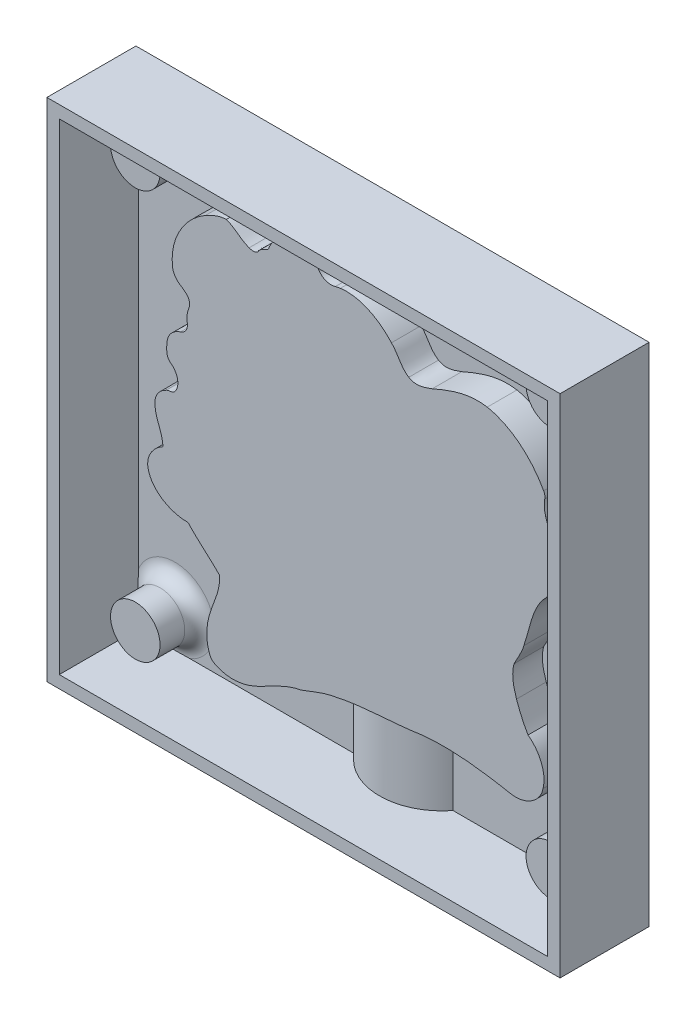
ISO-10303-21;
HEADER;
FILE_DESCRIPTION(('STEP AP214'),'2;1');
FILE_NAME('part.step','',(''),(''),'','','');
FILE_SCHEMA(('AUTOMOTIVE_DESIGN { 1 0 10303 214 1 1 1 1 }'));
ENDSEC;
DATA;
#1=APPLICATION_CONTEXT('core data for automotive mechanical design processes');
#2=APPLICATION_PROTOCOL_DEFINITION('international standard','automotive_design',2000,#1);
#3=PRODUCT_CONTEXT('',#1,'mechanical');
#4=PRODUCT('Part','Part','',(#3));
#5=PRODUCT_RELATED_PRODUCT_CATEGORY('part','',(#4));
#6=PRODUCT_DEFINITION_FORMATION('','',#4);
#7=PRODUCT_DEFINITION_CONTEXT('part definition',#1,'design');
#8=PRODUCT_DEFINITION('design','',#6,#7);
#9=PRODUCT_DEFINITION_SHAPE('','',#8);
#10=(LENGTH_UNIT() NAMED_UNIT(*) SI_UNIT(.MILLI.,.METRE.));
#11=(NAMED_UNIT(*) PLANE_ANGLE_UNIT() SI_UNIT($,.RADIAN.));
#12=(NAMED_UNIT(*) SI_UNIT($,.STERADIAN.) SOLID_ANGLE_UNIT());
#13=UNCERTAINTY_MEASURE_WITH_UNIT(LENGTH_MEASURE(1.E-05),#10,'distance_accuracy_value','');
#14=(GEOMETRIC_REPRESENTATION_CONTEXT(3) GLOBAL_UNCERTAINTY_ASSIGNED_CONTEXT((#13)) GLOBAL_UNIT_ASSIGNED_CONTEXT((#10,
#11,#12)) REPRESENTATION_CONTEXT('',''));
#15=CARTESIAN_POINT('',(0.,0.,0.));
#16=DIRECTION('',(0.,0.,1.));
#17=DIRECTION('',(1.,0.,0.));
#18=AXIS2_PLACEMENT_3D('',#15,#16,#17);
#19=CARTESIAN_POINT('',(0.,0.,0.));
#20=DIRECTION('',(0.,0.,-1.));
#21=DIRECTION('',(-1.,0.,0.));
#22=AXIS2_PLACEMENT_3D('',#19,#20,#21);
#23=PLANE('',#22);
#24=DIRECTION('',(0.,-1.,0.));
#25=VECTOR('',#24,1.);
#26=CARTESIAN_POINT('',(89.3802605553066,82.97065,0.));
#27=LINE('',#26,#25);
#28=CARTESIAN_POINT('',(89.380260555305,72.4478254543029,0.));
#29=VERTEX_POINT('',#28);
#30=CARTESIAN_POINT('',(89.3802605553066,58.97065,0.));
#31=VERTEX_POINT('',#30);
#32=EDGE_CURVE('E67',#29,#31,#27,.T.);
#33=ORIENTED_EDGE('',*,*,#32,.F.);
#34=CARTESIAN_POINT('',(84.723907,70.72844,0.));
#35=CARTESIAN_POINT('',(86.652823,71.39139,0.));
#36=CARTESIAN_POINT('',(88.494283,72.31128,0.));
#37=CARTESIAN_POINT('',(90.502407,72.737,0.));
#38=B_SPLINE_CURVE_WITH_KNOTS('',3,(#34,#35,#36,#37),.UNSPECIFIED.,.F.,.F.,(4,4),(0.,1.),.UNSPECIFIED.);
#39=CARTESIAN_POINT('',(84.723907,70.72844,0.));
#40=VERTEX_POINT('',#39);
#41=EDGE_CURVE('E682',#29,#40,#38,.F.);
#42=ORIENTED_EDGE('',*,*,#41,.T.);
#43=CARTESIAN_POINT('',(76.803849,67.44559,0.));
#44=CARTESIAN_POINT('',(79.360201,68.71653,0.));
#45=CARTESIAN_POINT('',(81.853212,70.23486,0.));
#46=CARTESIAN_POINT('',(84.723907,70.72844,0.));
#47=B_SPLINE_CURVE_WITH_KNOTS('',3,(#43,#44,#45,#46),.UNSPECIFIED.,.F.,.F.,(4,4),(0.,1.),.UNSPECIFIED.);
#48=CARTESIAN_POINT('',(76.803849,67.44559,0.));
#49=VERTEX_POINT('',#48);
#50=EDGE_CURVE('E671',#40,#49,#47,.F.);
#51=ORIENTED_EDGE('',*,*,#50,.T.);
#52=CARTESIAN_POINT('',(68.78125,65.97065,0.));
#53=CARTESIAN_POINT('',(71.525545,65.24163,0.));
#54=CARTESIAN_POINT('',(74.387296,66.12562,0.));
#55=CARTESIAN_POINT('',(76.803849,67.44559,0.));
#56=B_SPLINE_CURVE_WITH_KNOTS('',3,(#52,#53,#54,#55),.UNSPECIFIED.,.F.,.F.,(4,4),(0.,1.),.UNSPECIFIED.);
#57=CARTESIAN_POINT('',(68.78125,65.97065,0.));
#58=VERTEX_POINT('',#57);
#59=EDGE_CURVE('E663',#49,#58,#56,.F.);
#60=ORIENTED_EDGE('',*,*,#59,.T.);
#61=CARTESIAN_POINT('',(66.378225,67.26473,0.));
#62=CARTESIAN_POINT('',(66.920662,66.49543,0.));
#63=CARTESIAN_POINT('',(67.938665,66.27225,0.));
#64=CARTESIAN_POINT('',(68.78125,65.97065,0.));
#65=B_SPLINE_CURVE_WITH_KNOTS('',3,(#61,#62,#63,#64),.UNSPECIFIED.,.F.,.F.,(4,4),(0.,1.),.UNSPECIFIED.);
#66=CARTESIAN_POINT('',(66.378225,67.26473,0.));
#67=VERTEX_POINT('',#66);
#68=EDGE_CURVE('E660',#58,#67,#65,.F.);
#69=ORIENTED_EDGE('',*,*,#68,.T.);
#70=CARTESIAN_POINT('',(65.769531,73.10933,0.));
#71=CARTESIAN_POINT('',(65.436925,71.16654,0.));
#72=CARTESIAN_POINT('',(65.516257,69.05948,0.));
#73=CARTESIAN_POINT('',(66.378225,67.26473,0.));
#74=B_SPLINE_CURVE_WITH_KNOTS('',3,(#70,#71,#72,#73),.UNSPECIFIED.,.F.,.F.,(4,4),(0.,1.),.UNSPECIFIED.);
#75=CARTESIAN_POINT('',(65.769531,73.10933,0.));
#76=VERTEX_POINT('',#75);
#77=EDGE_CURVE('E647',#67,#76,#74,.F.);
#78=ORIENTED_EDGE('',*,*,#77,.T.);
#79=CARTESIAN_POINT('',(68.150391,82.58393,0.));
#80=CARTESIAN_POINT('',(68.418273,79.22512,0.));
#81=CARTESIAN_POINT('',(66.270547,76.34332,0.));
#82=CARTESIAN_POINT('',(65.769531,73.10933,0.));
#83=B_SPLINE_CURVE_WITH_KNOTS('',3,(#79,#80,#81,#82),.UNSPECIFIED.,.F.,.F.,(4,4),(0.,1.),.UNSPECIFIED.);
#84=CARTESIAN_POINT('',(68.150391,82.58393,0.));
#85=VERTEX_POINT('',#84);
#86=EDGE_CURVE('E643',#76,#85,#83,.F.);
#87=ORIENTED_EDGE('',*,*,#86,.T.);
#88=CARTESIAN_POINT('',(62.224607,88.15557,0.));
#89=CARTESIAN_POINT('',(64.107837,86.20226,0.));
#90=CARTESIAN_POINT('',(66.259038,84.52947,0.));
#91=CARTESIAN_POINT('',(68.150391,82.58393,0.));
#92=B_SPLINE_CURVE_WITH_KNOTS('',3,(#88,#89,#90,#91),.UNSPECIFIED.,.F.,.F.,(4,4),(0.,1.),.UNSPECIFIED.);
#93=CARTESIAN_POINT('',(62.224607,88.15557,0.));
#94=VERTEX_POINT('',#93);
#95=EDGE_CURVE('E633',#85,#94,#92,.F.);
#96=ORIENTED_EDGE('',*,*,#95,.T.);
#97=CARTESIAN_POINT('',(60.304688,88.72261,0.));
#98=CARTESIAN_POINT('',(60.959344,88.51035,0.));
#99=CARTESIAN_POINT('',(61.834,88.90315,0.));
#100=CARTESIAN_POINT('',(62.224607,88.15557,0.));
#101=B_SPLINE_CURVE_WITH_KNOTS('',3,(#97,#98,#99,#100),.UNSPECIFIED.,.F.,.F.,(4,4),(0.,1.),.UNSPECIFIED.);
#102=CARTESIAN_POINT('',(60.304688,88.72261,0.));
#103=VERTEX_POINT('',#102);
#104=EDGE_CURVE('E623',#94,#103,#101,.F.);
#105=ORIENTED_EDGE('',*,*,#104,.T.);
#106=CARTESIAN_POINT('',(53.763946,93.86478,0.));
#107=CARTESIAN_POINT('',(54.516106,90.93497,0.));
#108=CARTESIAN_POINT('',(57.463739,89.15129,0.));
#109=CARTESIAN_POINT('',(60.304688,88.72261,0.));
#110=B_SPLINE_CURVE_WITH_KNOTS('',3,(#106,#107,#108,#109),.UNSPECIFIED.,.F.,.F.,(4,4),(0.,1.),.UNSPECIFIED.);
#111=CARTESIAN_POINT('',(53.763946,93.86478,0.));
#112=VERTEX_POINT('',#111);
#113=EDGE_CURVE('E620',#103,#112,#110,.F.);
#114=ORIENTED_EDGE('',*,*,#113,.T.);
#115=CARTESIAN_POINT('',(56.716797,99.34565,0.));
#116=CARTESIAN_POINT('',(54.785421,98.33398,0.));
#117=CARTESIAN_POINT('',(53.164283,96.1246,0.));
#118=CARTESIAN_POINT('',(53.763946,93.86478,0.));
#119=B_SPLINE_CURVE_WITH_KNOTS('',3,(#115,#116,#117,#118),.UNSPECIFIED.,.F.,.F.,(4,4),(0.,1.),.UNSPECIFIED.);
#120=CARTESIAN_POINT('',(56.716797,99.34565,0.));
#121=VERTEX_POINT('',#120);
#122=EDGE_CURVE('E609',#112,#121,#119,.F.);
#123=ORIENTED_EDGE('',*,*,#122,.T.);
#124=CARTESIAN_POINT('',(55.142578,105.48237,0.));
#125=CARTESIAN_POINT('',(55.350632,103.3588,0.));
#126=CARTESIAN_POINT('',(56.68768,101.49854,0.));
#127=CARTESIAN_POINT('',(56.716797,99.34565,0.));
#128=B_SPLINE_CURVE_WITH_KNOTS('',3,(#124,#125,#126,#127),.UNSPECIFIED.,.F.,.F.,(4,4),(0.,1.),.UNSPECIFIED.);
#129=CARTESIAN_POINT('',(55.142578,105.48237,0.));
#130=VERTEX_POINT('',#129);
#131=EDGE_CURVE('E599',#121,#130,#128,.F.);
#132=ORIENTED_EDGE('',*,*,#131,.T.);
#133=CARTESIAN_POINT('',(57.298211,109.51916,0.));
#134=CARTESIAN_POINT('',(55.770678,108.85549,0.));
#135=CARTESIAN_POINT('',(54.791427,107.13697,0.));
#136=CARTESIAN_POINT('',(55.142578,105.48237,0.));
#137=B_SPLINE_CURVE_WITH_KNOTS('',3,(#133,#134,#135,#136),.UNSPECIFIED.,.F.,.F.,(4,4),(0.,1.),.UNSPECIFIED.);
#138=CARTESIAN_POINT('',(57.298211,109.51916,0.));
#139=VERTEX_POINT('',#138);
#140=EDGE_CURVE('E952',#130,#139,#137,.F.);
#141=ORIENTED_EDGE('',*,*,#140,.T.);
#142=CARTESIAN_POINT('',(59.220925,110.3442,0.));
#143=CARTESIAN_POINT('',(58.869092,109.60036,0.));
#144=CARTESIAN_POINT('',(57.887801,109.94475,0.));
#145=CARTESIAN_POINT('',(57.298211,109.51916,0.));
#146=B_SPLINE_CURVE_WITH_KNOTS('',3,(#142,#143,#144,#145),.UNSPECIFIED.,.F.,.F.,(4,4),(0.,1.),.UNSPECIFIED.);
#147=CARTESIAN_POINT('',(59.220925,110.3442,0.));
#148=VERTEX_POINT('',#147);
#149=EDGE_CURVE('E941',#139,#148,#146,.F.);
#150=ORIENTED_EDGE('',*,*,#149,.T.);
#151=CARTESIAN_POINT('',(57.703125,115.10151,0.));
#152=CARTESIAN_POINT('',(59.481766,114.37443,0.));
#153=CARTESIAN_POINT('',(60.380211,111.9589,0.));
#154=CARTESIAN_POINT('',(59.220925,110.3442,0.));
#155=B_SPLINE_CURVE_WITH_KNOTS('',3,(#151,#152,#153,#154),.UNSPECIFIED.,.F.,.F.,(4,4),(0.,1.),.UNSPECIFIED.);
#156=CARTESIAN_POINT('',(58.3342982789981,114.748971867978,0.));
#157=VERTEX_POINT('',#156);
#158=EDGE_CURVE('E934',#148,#157,#155,.F.);
#159=ORIENTED_EDGE('',*,*,#158,.T.);
#160=CARTESIAN_POINT('',(59.5087666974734,116.367805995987,0.));
#161=DIRECTION('',(0.,0.,-1.));
#162=DIRECTION('',(-1.,0.,0.));
#163=AXIS2_PLACEMENT_3D('',#160,#161,#162);
#164=CIRCLE('',#163,2.);
#165=CARTESIAN_POINT('',(57.5186332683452,116.169389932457,0.));
#166=VERTEX_POINT('',#165);
#167=EDGE_CURVE('E975',#157,#166,#164,.T.);
#168=ORIENTED_EDGE('',*,*,#167,.T.);
#169=CARTESIAN_POINT('',(57.549631,117.94975,0.));
#170=CARTESIAN_POINT('',(57.421663,117.00127,0.));
#171=CARTESIAN_POINT('',(57.472541,116.03053,0.));
#172=CARTESIAN_POINT('',(57.703125,115.10151,0.));
#173=B_SPLINE_CURVE_WITH_KNOTS('',3,(#169,#170,#171,#172),.UNSPECIFIED.,.F.,.F.,(4,4),(0.,1.),.UNSPECIFIED.);
#174=CARTESIAN_POINT('',(57.549631,117.94975,0.));
#175=VERTEX_POINT('',#174);
#176=EDGE_CURVE('E930',#166,#175,#173,.F.);
#177=ORIENTED_EDGE('',*,*,#176,.T.);
#178=CARTESIAN_POINT('',(61.838388,121.35261,0.));
#179=CARTESIAN_POINT('',(59.81373,121.6143,0.));
#180=CARTESIAN_POINT('',(57.59944,120.08356,0.));
#181=CARTESIAN_POINT('',(57.549631,117.94975,0.));
#182=B_SPLINE_CURVE_WITH_KNOTS('',3,(#178,#179,#180,#181),.UNSPECIFIED.,.F.,.F.,(4,4),(0.,1.),.UNSPECIFIED.);
#183=CARTESIAN_POINT('',(60.2555597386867,121.212165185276,0.));
#184=VERTEX_POINT('',#183);
#185=EDGE_CURVE('E919',#175,#184,#182,.F.);
#186=ORIENTED_EDGE('',*,*,#185,.T.);
#187=CARTESIAN_POINT('',(59.6770235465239,123.12666143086,0.));
#188=DIRECTION('',(0.,0.,-1.));
#189=DIRECTION('',(-1.,0.,0.));
#190=AXIS2_PLACEMENT_3D('',#187,#188,#189);
#191=CIRCLE('',#190,2.);
#192=CARTESIAN_POINT('',(61.6464210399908,123.475191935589,0.));
#193=VERTEX_POINT('',#192);
#194=EDGE_CURVE('E992',#184,#193,#191,.F.);
#195=ORIENTED_EDGE('',*,*,#194,.T.);
#196=CARTESIAN_POINT('',(62.529297,127.13086,0.));
#197=CARTESIAN_POINT('',(61.194257,125.47774,0.));
#198=CARTESIAN_POINT('',(61.276645,122.91992,0.));
#199=CARTESIAN_POINT('',(62.646484,121.32031,0.));
#200=B_SPLINE_CURVE_WITH_KNOTS('',3,(#196,#197,#198,#199),.UNSPECIFIED.,.F.,.F.,(4,4),(0.,1.),.UNSPECIFIED.);
#201=CARTESIAN_POINT('',(61.9528623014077,126.178290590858,0.));
#202=VERTEX_POINT('',#201);
#203=EDGE_CURVE('E913',#193,#202,#200,.F.);
#204=ORIENTED_EDGE('',*,*,#203,.T.);
#205=CARTESIAN_POINT('',(60.1203666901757,126.979514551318,0.));
#206=DIRECTION('',(0.,0.,-1.));
#207=DIRECTION('',(-1.,0.,0.));
#208=AXIS2_PLACEMENT_3D('',#205,#206,#207);
#209=CIRCLE('',#208,2.);
#210=CARTESIAN_POINT('',(61.431603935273,128.489698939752,0.));
#211=VERTEX_POINT('',#210);
#212=EDGE_CURVE('E997',#202,#211,#209,.F.);
#213=ORIENTED_EDGE('',*,*,#212,.T.);
#214=CARTESIAN_POINT('',(60.430243,129.28789,0.));
#215=CARTESIAN_POINT('',(61.209459,128.67895,0.));
#216=CARTESIAN_POINT('',(62.125179,128.03573,0.));
#217=CARTESIAN_POINT('',(62.529297,127.13086,0.));
#218=B_SPLINE_CURVE_WITH_KNOTS('',3,(#214,#215,#216,#217),.UNSPECIFIED.,.F.,.F.,(4,4),(0.,1.),.UNSPECIFIED.);
#219=CARTESIAN_POINT('',(60.430243,129.28789,0.));
#220=VERTEX_POINT('',#219);
#221=EDGE_CURVE('E905',#211,#220,#218,.F.);
#222=ORIENTED_EDGE('',*,*,#221,.T.);
#223=CARTESIAN_POINT('',(58.66357,131.81553,0.));
#224=CARTESIAN_POINT('',(58.771561,130.7199,0.));
#225=CARTESIAN_POINT('',(59.501499,129.82367,0.));
#226=CARTESIAN_POINT('',(60.430243,129.28789,0.));
#227=B_SPLINE_CURVE_WITH_KNOTS('',3,(#223,#224,#225,#226),.UNSPECIFIED.,.F.,.F.,(4,4),(0.,1.),.UNSPECIFIED.);
#228=CARTESIAN_POINT('',(58.66357,131.81553,0.));
#229=VERTEX_POINT('',#228);
#230=EDGE_CURVE('E894',#220,#229,#227,.F.);
#231=ORIENTED_EDGE('',*,*,#230,.T.);
#232=CARTESIAN_POINT('',(65.33745,144.15664,0.));
#233=CARTESIAN_POINT('',(61.063505,141.7378,0.));
#234=CARTESIAN_POINT('',(58.060432,136.79579,0.));
#235=CARTESIAN_POINT('',(58.66357,131.81553,0.));
#236=B_SPLINE_CURVE_WITH_KNOTS('',3,(#232,#233,#234,#235),.UNSPECIFIED.,.F.,.F.,(4,4),(0.,1.),.UNSPECIFIED.);
#237=CARTESIAN_POINT('',(65.33745,144.15664,0.));
#238=VERTEX_POINT('',#237);
#239=EDGE_CURVE('E890',#229,#238,#236,.F.);
#240=ORIENTED_EDGE('',*,*,#239,.T.);
#241=CARTESIAN_POINT('',(69.527344,145.54102,0.));
#242=CARTESIAN_POINT('',(68.031369,145.53202,0.));
#243=CARTESIAN_POINT('',(66.643955,144.81669,0.));
#244=CARTESIAN_POINT('',(65.33745,144.15664,0.));
#245=B_SPLINE_CURVE_WITH_KNOTS('',3,(#241,#242,#243,#244),.UNSPECIFIED.,.F.,.F.,(4,4),(0.,1.),.UNSPECIFIED.);
#246=CARTESIAN_POINT('',(69.527344,145.54102,0.));
#247=VERTEX_POINT('',#246);
#248=EDGE_CURVE('E878',#238,#247,#245,.F.);
#249=ORIENTED_EDGE('',*,*,#248,.T.);
#250=CARTESIAN_POINT('',(74.153441,142.90349,0.));
#251=CARTESIAN_POINT('',(72.441761,143.46073,0.));
#252=CARTESIAN_POINT('',(71.220121,144.99192,0.));
#253=CARTESIAN_POINT('',(69.527344,145.54102,0.));
#254=B_SPLINE_CURVE_WITH_KNOTS('',3,(#250,#251,#252,#253),.UNSPECIFIED.,.F.,.F.,(4,4),(0.,1.),.UNSPECIFIED.);
#255=CARTESIAN_POINT('',(74.153441,142.90349,0.));
#256=VERTEX_POINT('',#255);
#257=EDGE_CURVE('E871',#247,#256,#254,.F.);
#258=ORIENTED_EDGE('',*,*,#257,.T.);
#259=CARTESIAN_POINT('',(76.009483,143.20084,0.));
#260=CARTESIAN_POINT('',(75.563506,142.58451,0.));
#261=CARTESIAN_POINT('',(74.77522,142.62034,0.));
#262=CARTESIAN_POINT('',(74.153441,142.90349,0.));
#263=B_SPLINE_CURVE_WITH_KNOTS('',3,(#259,#260,#261,#262),.UNSPECIFIED.,.F.,.F.,(4,4),(0.,1.),.UNSPECIFIED.);
#264=CARTESIAN_POINT('',(76.009483,143.20084,0.));
#265=VERTEX_POINT('',#264);
#266=EDGE_CURVE('E861',#256,#265,#263,.F.);
#267=ORIENTED_EDGE('',*,*,#266,.T.);
#268=CARTESIAN_POINT('',(78.058594,144.61328,0.));
#269=CARTESIAN_POINT('',(77.428435,144.07713,0.));
#270=CARTESIAN_POINT('',(76.442136,143.99779,0.));
#271=CARTESIAN_POINT('',(76.009483,143.20084,0.));
#272=B_SPLINE_CURVE_WITH_KNOTS('',3,(#268,#269,#270,#271),.UNSPECIFIED.,.F.,.F.,(4,4),(0.,1.),.UNSPECIFIED.);
#273=CARTESIAN_POINT('',(78.058594,144.61328,0.));
#274=VERTEX_POINT('',#273);
#275=EDGE_CURVE('E854',#265,#274,#272,.F.);
#276=ORIENTED_EDGE('',*,*,#275,.T.);
#277=CARTESIAN_POINT('',(81.703277,147.87632,0.));
#278=CARTESIAN_POINT('',(79.931562,147.73358,0.));
#279=CARTESIAN_POINT('',(78.569126,146.23354,0.));
#280=CARTESIAN_POINT('',(78.058594,144.61328,0.));
#281=B_SPLINE_CURVE_WITH_KNOTS('',3,(#277,#278,#279,#280),.UNSPECIFIED.,.F.,.F.,(4,4),(0.,1.),.UNSPECIFIED.);
#282=CARTESIAN_POINT('',(81.703277,147.87632,0.));
#283=VERTEX_POINT('',#282);
#284=EDGE_CURVE('E849',#274,#283,#281,.F.);
#285=ORIENTED_EDGE('',*,*,#284,.T.);
#286=CARTESIAN_POINT('',(83.53125,148.55469,0.));
#287=CARTESIAN_POINT('',(82.880216,148.40682,0.));
#288=CARTESIAN_POINT('',(82.417948,147.70048,0.));
#289=CARTESIAN_POINT('',(81.703277,147.87632,0.));
#290=B_SPLINE_CURVE_WITH_KNOTS('',3,(#286,#287,#288,#289),.UNSPECIFIED.,.F.,.F.,(4,4),(0.,1.),.UNSPECIFIED.);
#291=CARTESIAN_POINT('',(83.53125,148.55469,0.));
#292=VERTEX_POINT('',#291);
#293=EDGE_CURVE('E837',#283,#292,#290,.F.);
#294=ORIENTED_EDGE('',*,*,#293,.T.);
#295=CARTESIAN_POINT('',(85.959024,149.27534,0.));
#296=CARTESIAN_POINT('',(85.136244,149.08211,0.));
#297=CARTESIAN_POINT('',(84.411679,148.50358,0.));
#298=CARTESIAN_POINT('',(83.53125,148.55469,0.));
#299=B_SPLINE_CURVE_WITH_KNOTS('',3,(#295,#296,#297,#298),.UNSPECIFIED.,.F.,.F.,(4,4),(0.,1.),.UNSPECIFIED.);
#300=CARTESIAN_POINT('',(85.959024,149.27534,0.));
#301=VERTEX_POINT('',#300);
#302=EDGE_CURVE('E833',#292,#301,#299,.F.);
#303=ORIENTED_EDGE('',*,*,#302,.T.);
#304=CARTESIAN_POINT('',(86.564493,149.14057,0.));
#305=CARTESIAN_POINT('',(86.37492,149.23327,0.));
#306=CARTESIAN_POINT('',(86.172499,149.29673,0.));
#307=CARTESIAN_POINT('',(85.959024,149.27534,0.));
#308=B_SPLINE_CURVE_WITH_KNOTS('',3,(#304,#305,#306,#307),.UNSPECIFIED.,.F.,.F.,(4,4),(0.,1.),.UNSPECIFIED.);
#309=CARTESIAN_POINT('',(86.564493,149.14057,0.));
#310=VERTEX_POINT('',#309);
#311=EDGE_CURVE('E822',#301,#310,#308,.F.);
#312=ORIENTED_EDGE('',*,*,#311,.T.);
#313=CARTESIAN_POINT('',(88.884806,143.27534,0.));
#314=CARTESIAN_POINT('',(88.276871,145.27946,0.));
#315=CARTESIAN_POINT('',(87.966181,147.49191,0.));
#316=CARTESIAN_POINT('',(86.564493,149.14057,0.));
#317=B_SPLINE_CURVE_WITH_KNOTS('',3,(#313,#314,#315,#316),.UNSPECIFIED.,.F.,.F.,(4,4),(0.,1.),.UNSPECIFIED.);
#318=CARTESIAN_POINT('',(87.9039046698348,146.689778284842,0.));
#319=VERTEX_POINT('',#318);
#320=EDGE_CURVE('E814',#310,#319,#317,.F.);
#321=ORIENTED_EDGE('',*,*,#320,.T.);
#322=CARTESIAN_POINT('',(90.7312064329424,147.692955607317,0.));
#323=DIRECTION('',(0.,0.,-1.));
#324=DIRECTION('',(-1.,0.,0.));
#325=AXIS2_PLACEMENT_3D('',#322,#323,#324);
#326=CIRCLE('',#325,3.);
#327=CARTESIAN_POINT('',(91.5644905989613,144.811005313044,0.));
#328=VERTEX_POINT('',#327);
#329=EDGE_CURVE('E967',#319,#328,#326,.F.);
#330=ORIENTED_EDGE('',*,*,#329,.T.);
#331=CARTESIAN_POINT('',(92.582028,145.01022,0.));
#332=CARTESIAN_POINT('',(91.195934,144.86793,0.));
#333=CARTESIAN_POINT('',(89.878978,144.2027,0.));
#334=CARTESIAN_POINT('',(88.884806,143.27534,0.));
#335=B_SPLINE_CURVE_WITH_KNOTS('',3,(#331,#332,#333,#334),.UNSPECIFIED.,.F.,.F.,(4,4),(0.,1.),.UNSPECIFIED.);
#336=CARTESIAN_POINT('',(92.582028,145.01022,0.));
#337=VERTEX_POINT('',#336);
#338=EDGE_CURVE('E810',#328,#337,#335,.F.);
#339=ORIENTED_EDGE('',*,*,#338,.T.);
#340=CARTESIAN_POINT('',(102.92573,140.64025,0.));
#341=CARTESIAN_POINT('',(100.36359,143.50317,0.));
#342=CARTESIAN_POINT('',(96.50971,145.57178,0.));
#343=CARTESIAN_POINT('',(92.582028,145.01022,0.));
#344=B_SPLINE_CURVE_WITH_KNOTS('',3,(#340,#341,#342,#343),.UNSPECIFIED.,.F.,.F.,(4,4),(0.,1.),.UNSPECIFIED.);
#345=CARTESIAN_POINT('',(102.92573,140.64025,0.));
#346=VERTEX_POINT('',#345);
#347=EDGE_CURVE('E797',#337,#346,#344,.F.);
#348=ORIENTED_EDGE('',*,*,#347,.T.);
#349=CARTESIAN_POINT('',(106.41996,136.35542,0.));
#350=CARTESIAN_POINT('',(104.81686,137.3748,0.));
#351=CARTESIAN_POINT('',(104.2322,139.3259,0.));
#352=CARTESIAN_POINT('',(102.92573,140.64025,0.));
#353=B_SPLINE_CURVE_WITH_KNOTS('',3,(#349,#350,#351,#352),.UNSPECIFIED.,.F.,.F.,(4,4),(0.,1.),.UNSPECIFIED.);
#354=CARTESIAN_POINT('',(106.41996,136.35542,0.));
#355=VERTEX_POINT('',#354);
#356=EDGE_CURVE('E792',#346,#355,#353,.F.);
#357=ORIENTED_EDGE('',*,*,#356,.T.);
#358=CARTESIAN_POINT('',(111.14717,136.69622,0.));
#359=CARTESIAN_POINT('',(109.67928,136.15805,0.));
#360=CARTESIAN_POINT('',(107.88809,135.45564,0.));
#361=CARTESIAN_POINT('',(106.41996,136.35542,0.));
#362=B_SPLINE_CURVE_WITH_KNOTS('',3,(#358,#359,#360,#361),.UNSPECIFIED.,.F.,.F.,(4,4),(0.,1.),.UNSPECIFIED.);
#363=CARTESIAN_POINT('',(111.14717,136.69622,0.));
#364=VERTEX_POINT('',#363);
#365=EDGE_CURVE('E781',#355,#364,#362,.F.);
#366=ORIENTED_EDGE('',*,*,#365,.T.);
#367=CARTESIAN_POINT('',(122.2891,139.0644,0.));
#368=CARTESIAN_POINT('',(118.41886,139.71342,0.));
#369=CARTESIAN_POINT('',(114.62895,138.21909,0.));
#370=CARTESIAN_POINT('',(111.14717,136.69622,0.));
#371=B_SPLINE_CURVE_WITH_KNOTS('',3,(#367,#368,#369,#370),.UNSPECIFIED.,.F.,.F.,(4,4),(0.,1.),.UNSPECIFIED.);
#372=CARTESIAN_POINT('',(122.2891,139.0644,0.));
#373=VERTEX_POINT('',#372);
#374=EDGE_CURVE('E773',#364,#373,#371,.F.);
#375=ORIENTED_EDGE('',*,*,#374,.T.);
#376=CARTESIAN_POINT('',(134.06254,129.41401,0.));
#377=CARTESIAN_POINT('',(131.72256,134.06238,0.));
#378=CARTESIAN_POINT('',(127.50139,138.027,0.));
#379=CARTESIAN_POINT('',(122.2891,139.0644,0.));
#380=B_SPLINE_CURVE_WITH_KNOTS('',3,(#376,#377,#378,#379),.UNSPECIFIED.,.F.,.F.,(4,4),(0.,1.),.UNSPECIFIED.);
#381=CARTESIAN_POINT('',(133.692458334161,130.115063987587,0.));
#382=VERTEX_POINT('',#381);
#383=EDGE_CURVE('E770',#373,#382,#380,.F.);
#384=ORIENTED_EDGE('',*,*,#383,.T.);
#385=CARTESIAN_POINT('',(131.942133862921,129.147404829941,0.));
#386=DIRECTION('',(0.,0.,-1.));
#387=DIRECTION('',(-1.,0.,0.));
#388=AXIS2_PLACEMENT_3D('',#385,#386,#387);
#389=CIRCLE('',#388,2.);
#390=CARTESIAN_POINT('',(133.909969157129,128.790159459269,0.));
#391=VERTEX_POINT('',#390);
#392=EDGE_CURVE('E979',#382,#391,#389,.T.);
#393=ORIENTED_EDGE('',*,*,#392,.T.);
#394=CARTESIAN_POINT('',(134.11444,125.74983,0.));
#395=CARTESIAN_POINT('',(133.76975,126.93648,0.));
#396=CARTESIAN_POINT('',(133.69233,128.22338,0.));
#397=CARTESIAN_POINT('',(134.06254,129.41401,0.));
#398=B_SPLINE_CURVE_WITH_KNOTS('',3,(#394,#395,#396,#397),.UNSPECIFIED.,.F.,.F.,(4,4),(0.,1.),.UNSPECIFIED.);
#399=CARTESIAN_POINT('',(134.11444,125.74983,0.));
#400=VERTEX_POINT('',#399);
#401=EDGE_CURVE('E757',#391,#400,#398,.F.);
#402=ORIENTED_EDGE('',*,*,#401,.T.);
#403=CARTESIAN_POINT('',(136.50668,116.58648,0.));
#404=CARTESIAN_POINT('',(136.70718,119.84364,0.));
#405=CARTESIAN_POINT('',(134.95487,122.73935,0.));
#406=CARTESIAN_POINT('',(134.11444,125.74983,0.));
#407=B_SPLINE_CURVE_WITH_KNOTS('',3,(#403,#404,#405,#406),.UNSPECIFIED.,.F.,.F.,(4,4),(0.,1.),.UNSPECIFIED.);
#408=CARTESIAN_POINT('',(136.50668,116.58648,0.));
#409=VERTEX_POINT('',#408);
#410=EDGE_CURVE('E753',#400,#409,#407,.F.);
#411=ORIENTED_EDGE('',*,*,#410,.T.);
#412=CARTESIAN_POINT('',(133.56651,110.9528,0.));
#413=CARTESIAN_POINT('',(135.04258,112.48811,0.));
#414=CARTESIAN_POINT('',(136.54458,114.33576,0.));
#415=CARTESIAN_POINT('',(136.50668,116.58648,0.));
#416=B_SPLINE_CURVE_WITH_KNOTS('',3,(#412,#413,#414,#415),.UNSPECIFIED.,.F.,.F.,(4,4),(0.,1.),.UNSPECIFIED.);
#417=CARTESIAN_POINT('',(133.56651,110.9528,0.));
#418=VERTEX_POINT('',#417);
#419=EDGE_CURVE('E743',#409,#418,#416,.F.);
#420=ORIENTED_EDGE('',*,*,#419,.T.);
#421=CARTESIAN_POINT('',(129.67217,100.96594,0.));
#422=CARTESIAN_POINT('',(130.85858,104.3517,0.));
#423=CARTESIAN_POINT('',(131.21918,108.09024,0.));
#424=CARTESIAN_POINT('',(133.56651,110.9528,0.));
#425=B_SPLINE_CURVE_WITH_KNOTS('',3,(#421,#422,#423,#424),.UNSPECIFIED.,.F.,.F.,(4,4),(0.,1.),.UNSPECIFIED.);
#426=CARTESIAN_POINT('',(129.67217,100.96594,0.));
#427=VERTEX_POINT('',#426);
#428=EDGE_CURVE('E733',#418,#427,#425,.F.);
#429=ORIENTED_EDGE('',*,*,#428,.T.);
#430=CARTESIAN_POINT('',(127.6925,96.83567,0.));
#431=CARTESIAN_POINT('',(128.3613,98.20931,0.));
#432=CARTESIAN_POINT('',(129.26454,99.4718,0.));
#433=CARTESIAN_POINT('',(129.67217,100.96594,0.));
#434=B_SPLINE_CURVE_WITH_KNOTS('',3,(#430,#431,#432,#433),.UNSPECIFIED.,.F.,.F.,(4,4),(0.,1.),.UNSPECIFIED.);
#435=CARTESIAN_POINT('',(127.6925,96.83567,0.));
#436=VERTEX_POINT('',#435);
#437=EDGE_CURVE('E730',#427,#436,#434,.F.);
#438=ORIENTED_EDGE('',*,*,#437,.T.);
#439=CARTESIAN_POINT('',(128.20017,90.89727,0.));
#440=CARTESIAN_POINT('',(127.56095,92.82513,0.));
#441=CARTESIAN_POINT('',(127.13987,94.8346,0.));
#442=CARTESIAN_POINT('',(127.6925,96.83567,0.));
#443=B_SPLINE_CURVE_WITH_KNOTS('',3,(#439,#440,#441,#442),.UNSPECIFIED.,.F.,.F.,(4,4),(0.,1.),.UNSPECIFIED.);
#444=CARTESIAN_POINT('',(128.20017,90.89727,0.));
#445=VERTEX_POINT('',#444);
#446=EDGE_CURVE('E716',#436,#445,#443,.F.);
#447=ORIENTED_EDGE('',*,*,#446,.T.);
#448=CARTESIAN_POINT('',(130.53711,85.77925,0.));
#449=CARTESIAN_POINT('',(129.53297,87.36196,0.));
#450=CARTESIAN_POINT('',(128.86151,89.11647,0.));
#451=CARTESIAN_POINT('',(128.20017,90.89727,0.));
#452=B_SPLINE_CURVE_WITH_KNOTS('',3,(#448,#449,#450,#451),.UNSPECIFIED.,.F.,.F.,(4,4),(0.,1.),.UNSPECIFIED.);
#453=CARTESIAN_POINT('',(130.53711,85.77925,0.));
#454=VERTEX_POINT('',#453);
#455=EDGE_CURVE('E711',#445,#454,#452,.F.);
#456=ORIENTED_EDGE('',*,*,#455,.T.);
#457=CARTESIAN_POINT('',(133.55837,77.89953,0.));
#458=CARTESIAN_POINT('',(134.29777,80.82102,0.));
#459=CARTESIAN_POINT('',(132.91359,84.01491,0.));
#460=CARTESIAN_POINT('',(130.53711,85.77925,0.));
#461=B_SPLINE_CURVE_WITH_KNOTS('',3,(#457,#458,#459,#460),.UNSPECIFIED.,.F.,.F.,(4,4),(0.,1.),.UNSPECIFIED.);
#462=CARTESIAN_POINT('',(133.55837,77.89953,0.));
#463=VERTEX_POINT('',#462);
#464=EDGE_CURVE('E703',#454,#463,#461,.F.);
#465=ORIENTED_EDGE('',*,*,#464,.T.);
#466=CARTESIAN_POINT('',(127.26106,73.70841,0.));
#467=CARTESIAN_POINT('',(129.99315,73.32881,0.));
#468=CARTESIAN_POINT('',(133.02234,75.0915,0.));
#469=CARTESIAN_POINT('',(133.55837,77.89953,0.));
#470=B_SPLINE_CURVE_WITH_KNOTS('',3,(#466,#467,#468,#469),.UNSPECIFIED.,.F.,.F.,(4,4),(0.,1.),.UNSPECIFIED.);
#471=CARTESIAN_POINT('',(127.26106,73.70841,0.));
#472=VERTEX_POINT('',#471);
#473=EDGE_CURVE('E694',#463,#472,#470,.F.);
#474=ORIENTED_EDGE('',*,*,#473,.T.);
#475=CARTESIAN_POINT('',(108.85083,75.0252,0.));
#476=CARTESIAN_POINT('',(115.02796,75.72786,0.));
#477=CARTESIAN_POINT('',(121.1862,74.86926,0.));
#478=CARTESIAN_POINT('',(127.26106,73.70841,0.));
#479=B_SPLINE_CURVE_WITH_KNOTS('',3,(#475,#476,#477,#478),.UNSPECIFIED.,.F.,.F.,(4,4),(0.,1.),.UNSPECIFIED.);
#480=CARTESIAN_POINT('',(109.380260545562,75.0816348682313,0.));
#481=VERTEX_POINT('',#480);
#482=EDGE_CURVE('E688',#472,#481,#479,.F.);
#483=ORIENTED_EDGE('',*,*,#482,.T.);
#484=DIRECTION('',(0.,-1.,0.));
#485=VECTOR('',#484,1.);
#486=CARTESIAN_POINT('',(109.380260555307,82.97065,0.));
#487=LINE('',#486,#485);
#488=CARTESIAN_POINT('',(109.380260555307,58.97065,0.));
#489=VERTEX_POINT('',#488);
#490=EDGE_CURVE('E507',#481,#489,#487,.T.);
#491=ORIENTED_EDGE('',*,*,#490,.T.);
#492=DIRECTION('',(-1.,0.,0.));
#493=VECTOR('',#492,1.);
#494=CARTESIAN_POINT('',(144.50668,58.97065,0.));
#495=LINE('',#494,#493);
#496=CARTESIAN_POINT('',(134.072254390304,58.97065,0.));
#497=VERTEX_POINT('',#496);
#498=EDGE_CURVE('E1824',#497,#489,#495,.T.);
#499=ORIENTED_EDGE('',*,*,#498,.F.);
#500=CARTESIAN_POINT('',(137.135313,66.3610269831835,0.));
#501=DIRECTION('',(0.,0.,-1.));
#502=DIRECTION('',(-1.,0.,0.));
#503=AXIS2_PLACEMENT_3D('',#500,#501,#502);
#504=CIRCLE('',#503,8.00000000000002);
#505=CARTESIAN_POINT('',(144.50668,69.4695553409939,0.));
#506=VERTEX_POINT('',#505);
#507=EDGE_CURVE('E1020',#497,#506,#504,.T.);
#508=ORIENTED_EDGE('',*,*,#507,.T.);
#509=DIRECTION('',(0.,-1.,0.));
#510=VECTOR('',#509,1.);
#511=CARTESIAN_POINT('',(144.50668,156.27534,0.));
#512=LINE('',#511,#510);
#513=CARTESIAN_POINT('',(144.50668,145.776434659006,0.));
#514=VERTEX_POINT('',#513);
#515=EDGE_CURVE('E1821',#514,#506,#512,.T.);
#516=ORIENTED_EDGE('',*,*,#515,.F.);
#517=CARTESIAN_POINT('',(137.135313,148.884963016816,0.));
#518=DIRECTION('',(0.,0.,-1.));
#519=DIRECTION('',(-1.,0.,0.));
#520=AXIS2_PLACEMENT_3D('',#517,#518,#519);
#521=CIRCLE('',#520,8.00000000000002);
#522=CARTESIAN_POINT('',(134.072254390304,156.27534,0.));
#523=VERTEX_POINT('',#522);
#524=EDGE_CURVE('E1008',#514,#523,#521,.T.);
#525=ORIENTED_EDGE('',*,*,#524,.T.);
#526=DIRECTION('',(1.,0.,0.));
#527=VECTOR('',#526,1.);
#528=CARTESIAN_POINT('',(144.50668,156.27534,0.));
#529=LINE('',#528,#527);
#530=CARTESIAN_POINT('',(56.1983716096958,156.27534,0.));
#531=VERTEX_POINT('',#530);
#532=EDGE_CURVE('E1175',#531,#523,#529,.T.);
#533=ORIENTED_EDGE('',*,*,#532,.F.);
#534=CARTESIAN_POINT('',(53.135313,148.884963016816,0.));
#535=DIRECTION('',(0.,0.,-1.));
#536=DIRECTION('',(-1.,0.,0.));
#537=AXIS2_PLACEMENT_3D('',#534,#535,#536);
#538=CIRCLE('',#537,8.);
#539=CARTESIAN_POINT('',(45.763946,145.776434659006,0.));
#540=VERTEX_POINT('',#539);
#541=EDGE_CURVE('E1010',#531,#540,#538,.T.);
#542=ORIENTED_EDGE('',*,*,#541,.T.);
#543=DIRECTION('',(0.,1.,0.));
#544=VECTOR('',#543,1.);
#545=CARTESIAN_POINT('',(45.763946,156.27534,0.));
#546=LINE('',#545,#544);
#547=CARTESIAN_POINT('',(45.763946,69.4695553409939,0.));
#548=VERTEX_POINT('',#547);
#549=EDGE_CURVE('E1163',#548,#540,#546,.T.);
#550=ORIENTED_EDGE('',*,*,#549,.F.);
#551=CARTESIAN_POINT('',(53.135313,66.3610269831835,0.));
#552=DIRECTION('',(0.,0.,-1.));
#553=DIRECTION('',(-1.,0.,0.));
#554=AXIS2_PLACEMENT_3D('',#551,#552,#553);
#555=CIRCLE('',#554,8.00000000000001);
#556=CARTESIAN_POINT('',(56.1983716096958,58.97065,0.));
#557=VERTEX_POINT('',#556);
#558=EDGE_CURVE('E1022',#548,#557,#555,.T.);
#559=ORIENTED_EDGE('',*,*,#558,.T.);
#560=EDGE_CURVE('E1828',#31,#557,#495,.T.);
#561=ORIENTED_EDGE('',*,*,#560,.F.);
#562=EDGE_LOOP('',(#33,#42,#51,#60,#69,#78,#87,#96,#105,#114,#123,#132,#141,#150,#159,#168,#177,
#186,#195,#204,#213,#222,#231,#240,#249,#258,#267,#276,#285,#294,#303,#312,#321,#330,#339,#348,
#357,#366,#375,#384,#393,#402,#411,#420,#429,#438,#447,#456,#465,#474,#483,#491,#499,#508,#516,
#525,#533,#542,#550,#559,#561));
#563=FACE_BOUND('',#562,.T.);
#564=ADVANCED_FACE('F52',(#563),#23,.F.);
#565=CARTESIAN_POINT('',(84.723907,70.72844,8.6));
#566=CARTESIAN_POINT('',(86.652823,71.39139,8.6));
#567=CARTESIAN_POINT('',(88.494283,72.31128,8.6));
#568=CARTESIAN_POINT('',(90.502407,72.737,8.6));
#569=B_SPLINE_CURVE_WITH_KNOTS('',3,(#565,#566,#567,#568),.UNSPECIFIED.,.F.,.F.,(4,4),(0.,1.),.UNSPECIFIED.);
#570=DIRECTION('',(0.,0.,-1.));
#571=VECTOR('',#570,1.);
#572=SURFACE_OF_LINEAR_EXTRUSION('',#569,#571);
#573=CARTESIAN_POINT('',(90.502407,72.737,1.25508806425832));
#574=CARTESIAN_POINT('',(90.452035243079,72.7263210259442,1.20576535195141));
#575=CARTESIAN_POINT('',(90.4021007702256,72.7154020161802,1.15604859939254));
#576=CARTESIAN_POINT('',(90.3031565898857,72.6931453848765,1.05588261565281));
#577=CARTESIAN_POINT('',(90.2541461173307,72.6818081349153,1.00543405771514));
#578=CARTESIAN_POINT('',(90.1570400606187,72.6587642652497,0.903803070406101));
#579=CARTESIAN_POINT('',(90.1089439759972,72.6470578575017,0.852621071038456));
#580=CARTESIAN_POINT('',(90.0136579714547,72.6233226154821,0.74952080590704));
#581=CARTESIAN_POINT('',(89.9664678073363,72.6112938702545,0.697602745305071));
#582=CARTESIAN_POINT('',(89.8729876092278,72.586959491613,0.593028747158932));
#583=CARTESIAN_POINT('',(89.8266975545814,72.5746538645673,0.540372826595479));
#584=CARTESIAN_POINT('',(89.7350093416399,72.5498085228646,0.434316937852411));
#585=CARTESIAN_POINT('',(89.6896114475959,72.5372687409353,0.380916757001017));
#586=CARTESIAN_POINT('',(89.5997021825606,72.5119966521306,0.273367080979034));
#587=CARTESIAN_POINT('',(89.5551913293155,72.4992642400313,0.219217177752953));
#588=CARTESIAN_POINT('',(89.4670521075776,72.4736463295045,0.110162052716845));
#589=CARTESIAN_POINT('',(89.423424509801,72.4607607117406,0.0552562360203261));
#590=CARTESIAN_POINT('',(89.3802605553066,72.4478254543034,0.));
#591=B_SPLINE_CURVE_WITH_KNOTS('',3,(#573,#574,#575,#576,#577,#578,#579,#580,#581,#582,#583,
#584,#585,#586,#587,#588,#589,#590),.UNSPECIFIED.,.F.,.F.,(4,2,2,2,2,2,2,2,4),(0.,
0.213904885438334,0.427624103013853,0.641222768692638,0.854763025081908,1.06829837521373,
1.28189604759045,1.49561494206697,1.70951291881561),.UNSPECIFIED.);
#592=CARTESIAN_POINT('',(90.502407,72.737,1.25508806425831));
#593=VERTEX_POINT('',#592);
#594=EDGE_CURVE('E77',#593,#29,#591,.T.);
#595=ORIENTED_EDGE('',*,*,#594,.F.);
#596=DIRECTION('',(0.,0.,-1.));
#597=VECTOR('',#596,1.);
#598=CARTESIAN_POINT('',(90.502407,72.737,12.6));
#599=LINE('',#598,#597);
#600=CARTESIAN_POINT('',(90.502407,72.737,6.));
#601=VERTEX_POINT('',#600);
#602=EDGE_CURVE('E499',#601,#593,#599,.T.);
#603=ORIENTED_EDGE('',*,*,#602,.F.);
#604=CARTESIAN_POINT('',(84.723907,70.72844,6.));
#605=CARTESIAN_POINT('',(86.652823,71.39139,6.));
#606=CARTESIAN_POINT('',(88.494283,72.31128,6.));
#607=CARTESIAN_POINT('',(90.502407,72.737,6.));
#608=B_SPLINE_CURVE_WITH_KNOTS('',3,(#604,#605,#606,#607),.UNSPECIFIED.,.F.,.F.,(4,4),(0.,1.),.UNSPECIFIED.);
#609=CARTESIAN_POINT('',(84.723907,70.72844,6.));
#610=VERTEX_POINT('',#609);
#611=EDGE_CURVE('E1727',#601,#610,#608,.F.);
#612=ORIENTED_EDGE('',*,*,#611,.T.);
#613=DIRECTION('',(0.,0.,-1.));
#614=VECTOR('',#613,1.);
#615=CARTESIAN_POINT('',(84.723907,70.72844,12.6));
#616=LINE('',#615,#614);
#617=EDGE_CURVE('E1292',#610,#40,#616,.T.);
#618=ORIENTED_EDGE('',*,*,#617,.T.);
#619=ORIENTED_EDGE('',*,*,#41,.F.);
#620=EDGE_LOOP('',(#595,#603,#612,#618,#619));
#621=FACE_BOUND('',#620,.T.);
#622=ADVANCED_FACE('F542',(#621),#572,.F.);
#623=CARTESIAN_POINT('',(90.502407,72.737,8.6));
#624=CARTESIAN_POINT('',(96.516809,74.24539,8.6));
#625=CARTESIAN_POINT('',(102.74072,74.08391,8.6));
#626=CARTESIAN_POINT('',(108.85083,75.0252,8.6));
#627=B_SPLINE_CURVE_WITH_KNOTS('',3,(#623,#624,#625,#626),.UNSPECIFIED.,.F.,.F.,(4,4),(0.,1.),.UNSPECIFIED.);
#628=DIRECTION('',(0.,0.,-1.));
#629=VECTOR('',#628,1.);
#630=SURFACE_OF_LINEAR_EXTRUSION('',#627,#629);
#631=CARTESIAN_POINT('',(108.85083,75.0252,0.634074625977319));
#632=CARTESIAN_POINT('',(108.692039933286,75.0007296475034,0.812144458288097));
#633=CARTESIAN_POINT('',(108.528218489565,74.9762564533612,0.985726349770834));
#634=CARTESIAN_POINT('',(108.191042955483,74.9275142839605,1.3233937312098));
#635=CARTESIAN_POINT('',(108.0176890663,74.9032453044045,1.48747942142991));
#636=CARTESIAN_POINT('',(107.661973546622,74.8551206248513,1.80564005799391));
#637=CARTESIAN_POINT('',(107.479611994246,74.8312649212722,1.9597150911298));
#638=CARTESIAN_POINT('',(107.106594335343,74.7841385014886,2.25725151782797));
#639=CARTESIAN_POINT('',(106.915944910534,74.7608673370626,2.40072121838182));
#640=CARTESIAN_POINT('',(106.526808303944,74.7149973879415,2.67672161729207));
#641=CARTESIAN_POINT('',(106.328321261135,74.6923985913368,2.80925250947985));
#642=CARTESIAN_POINT('',(105.924147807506,74.6479282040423,3.06294051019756));
#643=CARTESIAN_POINT('',(105.718461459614,74.6260566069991,3.18409771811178));
#644=CARTESIAN_POINT('',(105.195859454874,74.5722747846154,3.47237894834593));
#645=CARTESIAN_POINT('',(104.874803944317,74.5408198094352,3.63215472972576));
#646=CARTESIAN_POINT('',(104.220195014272,74.4793548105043,3.92401554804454));
#647=CARTESIAN_POINT('',(103.886639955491,74.4493449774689,4.05609693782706));
#648=CARTESIAN_POINT('',(103.209531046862,74.3903241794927,4.2915521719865));
#649=CARTESIAN_POINT('',(102.865979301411,74.3613130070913,4.39493201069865));
#650=CARTESIAN_POINT('',(102.171335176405,74.3036300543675,4.57224319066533));
#651=CARTESIAN_POINT('',(101.820242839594,74.2749582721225,4.64617469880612));
#652=CARTESIAN_POINT('',(101.113578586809,74.2171878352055,4.7639684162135));
#653=CARTESIAN_POINT('',(100.758013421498,74.1880898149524,4.8078714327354));
#654=CARTESIAN_POINT('',(100.044555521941,74.1285417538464,4.86546494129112));
#655=CARTESIAN_POINT('',(99.6866627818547,74.0980917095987,4.87915535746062));
#656=CARTESIAN_POINT('',(98.9711966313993,74.0349400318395,4.87626113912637));
#657=CARTESIAN_POINT('',(98.6136232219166,74.0022383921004,4.85967642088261));
#658=CARTESIAN_POINT('',(97.9014494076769,73.9337479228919,4.79641693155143));
#659=CARTESIAN_POINT('',(97.5468489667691,73.8979591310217,4.74974252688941));
#660=CARTESIAN_POINT('',(96.8436312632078,73.8226381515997,4.62680636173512));
#661=CARTESIAN_POINT('',(96.4950077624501,73.7831101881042,4.55057769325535));
#662=CARTESIAN_POINT('',(95.8058750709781,73.6997839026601,4.36920010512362));
#663=CARTESIAN_POINT('',(95.4653661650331,73.6559854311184,4.26405017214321));
#664=CARTESIAN_POINT('',(94.7949342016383,73.5638880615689,4.02573607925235));
#665=CARTESIAN_POINT('',(94.4650111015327,73.5155891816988,3.8925720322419));
#666=CARTESIAN_POINT('',(93.8180916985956,73.4145562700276,3.59933865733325));
#667=CARTESIAN_POINT('',(93.5010935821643,73.3618228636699,3.43927312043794));
#668=CARTESIAN_POINT('',(92.9458614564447,73.2635766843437,3.12910174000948));
#669=CARTESIAN_POINT('',(92.7048392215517,73.2188100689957,2.98372057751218));
#670=CARTESIAN_POINT('',(92.2333009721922,73.1270601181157,2.67749530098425));
#671=CARTESIAN_POINT('',(92.002783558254,73.080077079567,2.51665325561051));
#672=CARTESIAN_POINT('',(91.553438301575,72.9843926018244,2.18042786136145));
#673=CARTESIAN_POINT('',(91.3345966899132,72.9356933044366,2.0050622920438));
#674=CARTESIAN_POINT('',(90.9091249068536,72.8370979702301,1.64036085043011));
#675=CARTESIAN_POINT('',(90.7024960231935,72.7872018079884,1.45102350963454));
#676=CARTESIAN_POINT('',(90.502407,72.737,1.25508806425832));
#677=B_SPLINE_CURVE_WITH_KNOTS('',3,(#631,#632,#633,#634,#635,#636,#637,#638,#639,#640,#641,
#642,#643,#644,#645,#646,#647,#648,#649,#650,#651,#652,#653,#654,#655,#656,#657,#658,#659,#660,
#661,#662,#663,#664,#665,#666,#667,#668,#669,#670,#671,#672,#673,#674,#675,#676),.UNSPECIFIED.,
.F.,.F.,(4,2,2,2,2,2,2,2,2,2,2,2,2,2,2,2,2,2,2,2,2,2,4),(0.,0.719416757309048,1.43881833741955,
2.15821367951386,2.87703942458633,3.59585242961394,4.31465915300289,5.39327369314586,
6.47203019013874,7.55056121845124,8.6290861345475,9.7061424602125,10.7832014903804,
11.860263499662,12.9373123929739,14.0131587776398,15.0890428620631,16.1649226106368,
17.2406508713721,18.0950899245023,18.949414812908,19.8027088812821,20.656092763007),.UNSPECIFIED.);
#678=CARTESIAN_POINT('',(108.85083,75.0252,0.634074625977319));
#679=VERTEX_POINT('',#678);
#680=EDGE_CURVE('E505',#679,#593,#677,.T.);
#681=ORIENTED_EDGE('',*,*,#680,.F.);
#682=DIRECTION('',(0.,0.,-1.));
#683=VECTOR('',#682,1.);
#684=CARTESIAN_POINT('',(108.85083,75.0252,12.6));
#685=LINE('',#684,#683);
#686=CARTESIAN_POINT('',(108.85083,75.0252,6.));
#687=VERTEX_POINT('',#686);
#688=EDGE_CURVE('E490',#687,#679,#685,.T.);
#689=ORIENTED_EDGE('',*,*,#688,.F.);
#690=CARTESIAN_POINT('',(90.502407,72.737,6.));
#691=CARTESIAN_POINT('',(96.516809,74.24539,6.));
#692=CARTESIAN_POINT('',(102.74072,74.08391,6.));
#693=CARTESIAN_POINT('',(108.85083,75.0252,6.));
#694=B_SPLINE_CURVE_WITH_KNOTS('',3,(#690,#691,#692,#693),.UNSPECIFIED.,.F.,.F.,(4,4),(0.,1.),.UNSPECIFIED.);
#695=EDGE_CURVE('E1717',#687,#601,#694,.F.);
#696=ORIENTED_EDGE('',*,*,#695,.T.);
#697=ORIENTED_EDGE('',*,*,#602,.T.);
#698=EDGE_LOOP('',(#681,#689,#696,#697));
#699=FACE_BOUND('',#698,.T.);
#700=ADVANCED_FACE('F501',(#699),#630,.F.);
#701=CARTESIAN_POINT('',(108.85083,75.0252,8.6));
#702=CARTESIAN_POINT('',(115.02796,75.72786,8.6));
#703=CARTESIAN_POINT('',(121.1862,74.86926,8.6));
#704=CARTESIAN_POINT('',(127.26106,73.70841,8.6));
#705=B_SPLINE_CURVE_WITH_KNOTS('',3,(#701,#702,#703,#704),.UNSPECIFIED.,.F.,.F.,(4,4),(0.,1.),.UNSPECIFIED.);
#706=DIRECTION('',(0.,0.,-1.));
#707=VECTOR('',#706,1.);
#708=SURFACE_OF_LINEAR_EXTRUSION('',#705,#707);
#709=CARTESIAN_POINT('',(109.380260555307,75.0816348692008,0.));
#710=CARTESIAN_POINT('',(109.295419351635,75.0732199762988,0.108603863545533));
#711=CARTESIAN_POINT('',(109.208879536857,75.064309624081,0.215745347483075));
#712=CARTESIAN_POINT('',(109.032402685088,75.045498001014,0.427103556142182));
#713=CARTESIAN_POINT('',(108.942465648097,75.0355967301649,0.531320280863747));
#714=CARTESIAN_POINT('',(108.85083,75.0252,0.634074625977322));
#715=B_SPLINE_CURVE_WITH_KNOTS('',3,(#709,#710,#711,#712,#713,#714),.UNSPECIFIED.,.F.,.F.,(4,2,
4),(0.,0.414041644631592,0.828083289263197),.UNSPECIFIED.);
#716=EDGE_CURVE('E495',#481,#679,#715,.T.);
#717=ORIENTED_EDGE('',*,*,#716,.F.);
#718=ORIENTED_EDGE('',*,*,#482,.F.);
#719=DIRECTION('',(0.,0.,-1.));
#720=VECTOR('',#719,1.);
#721=CARTESIAN_POINT('',(127.26106,73.70841,12.6));
#722=LINE('',#721,#720);
#723=CARTESIAN_POINT('',(127.26106,73.70841,6.));
#724=VERTEX_POINT('',#723);
#725=EDGE_CURVE('E496',#724,#472,#722,.T.);
#726=ORIENTED_EDGE('',*,*,#725,.F.);
#727=CARTESIAN_POINT('',(108.85083,75.0252,6.));
#728=CARTESIAN_POINT('',(115.02796,75.72786,6.));
#729=CARTESIAN_POINT('',(121.1862,74.86926,6.));
#730=CARTESIAN_POINT('',(127.26106,73.70841,6.));
#731=B_SPLINE_CURVE_WITH_KNOTS('',3,(#727,#728,#729,#730),.UNSPECIFIED.,.F.,.F.,(4,4),(0.,1.),.UNSPECIFIED.);
#732=EDGE_CURVE('E494',#724,#687,#731,.F.);
#733=ORIENTED_EDGE('',*,*,#732,.T.);
#734=ORIENTED_EDGE('',*,*,#688,.T.);
#735=EDGE_LOOP('',(#717,#718,#726,#733,#734));
#736=FACE_BOUND('',#735,.T.);
#737=ADVANCED_FACE('F487',(#736),#708,.F.);
#738=CARTESIAN_POINT('',(50.0722543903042,58.97065,0.));
#739=VERTEX_POINT('',#738);
#740=CARTESIAN_POINT('',(45.763946,58.97065,0.));
#741=VERTEX_POINT('',#740);
#742=EDGE_CURVE('E1825',#739,#741,#495,.T.);
#743=ORIENTED_EDGE('',*,*,#742,.F.);
#744=CARTESIAN_POINT('',(53.135313,66.3610269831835,0.));
#745=DIRECTION('',(0.,0.,-1.));
#746=DIRECTION('',(-1.,0.,0.));
#747=AXIS2_PLACEMENT_3D('',#744,#745,#746);
#748=CIRCLE('',#747,8.00000000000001);
#749=CARTESIAN_POINT('',(45.763946,63.2524986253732,0.));
#750=VERTEX_POINT('',#749);
#751=EDGE_CURVE('E1019',#739,#750,#748,.T.);
#752=ORIENTED_EDGE('',*,*,#751,.T.);
#753=EDGE_CURVE('E1162',#741,#750,#546,.T.);
#754=ORIENTED_EDGE('',*,*,#753,.F.);
#755=EDGE_LOOP('',(#743,#752,#754));
#756=FACE_BOUND('',#755,.T.);
#757=ADVANCED_FACE('F1132',(#756),#23,.F.);
#758=CARTESIAN_POINT('',(140.198371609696,156.27534,0.));
#759=VERTEX_POINT('',#758);
#760=CARTESIAN_POINT('',(144.50668,156.27534,0.));
#761=VERTEX_POINT('',#760);
#762=EDGE_CURVE('E1180',#759,#761,#529,.T.);
#763=ORIENTED_EDGE('',*,*,#762,.F.);
#764=CARTESIAN_POINT('',(137.135313,148.884963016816,0.));
#765=DIRECTION('',(0.,0.,-1.));
#766=DIRECTION('',(-1.,0.,0.));
#767=AXIS2_PLACEMENT_3D('',#764,#765,#766);
#768=CIRCLE('',#767,8.00000000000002);
#769=CARTESIAN_POINT('',(144.50668,151.993491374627,0.));
#770=VERTEX_POINT('',#769);
#771=EDGE_CURVE('E1014',#759,#770,#768,.T.);
#772=ORIENTED_EDGE('',*,*,#771,.T.);
#773=EDGE_CURVE('E1818',#761,#770,#512,.T.);
#774=ORIENTED_EDGE('',*,*,#773,.F.);
#775=EDGE_LOOP('',(#763,#772,#774));
#776=FACE_BOUND('',#775,.T.);
#777=ADVANCED_FACE('F1139',(#776),#23,.F.);
#778=CARTESIAN_POINT('',(144.50668,63.2524986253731,0.));
#779=VERTEX_POINT('',#778);
#780=CARTESIAN_POINT('',(144.50668,58.97065,0.));
#781=VERTEX_POINT('',#780);
#782=EDGE_CURVE('E1806',#779,#781,#512,.T.);
#783=ORIENTED_EDGE('',*,*,#782,.F.);
#784=CARTESIAN_POINT('',(137.135313,66.3610269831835,0.));
#785=DIRECTION('',(0.,0.,-1.));
#786=DIRECTION('',(-1.,0.,0.));
#787=AXIS2_PLACEMENT_3D('',#784,#785,#786);
#788=CIRCLE('',#787,8.00000000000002);
#789=CARTESIAN_POINT('',(140.198371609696,58.97065,0.));
#790=VERTEX_POINT('',#789);
#791=EDGE_CURVE('E1013',#779,#790,#788,.T.);
#792=ORIENTED_EDGE('',*,*,#791,.T.);
#793=EDGE_CURVE('E1165',#781,#790,#495,.T.);
#794=ORIENTED_EDGE('',*,*,#793,.F.);
#795=EDGE_LOOP('',(#783,#792,#794));
#796=FACE_BOUND('',#795,.T.);
#797=ADVANCED_FACE('F1143',(#796),#23,.F.);
#798=CARTESIAN_POINT('',(45.763946,151.993491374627,0.));
#799=VERTEX_POINT('',#798);
#800=CARTESIAN_POINT('',(45.763946,156.27534,0.));
#801=VERTEX_POINT('',#800);
#802=EDGE_CURVE('E1154',#799,#801,#546,.T.);
#803=ORIENTED_EDGE('',*,*,#802,.F.);
#804=CARTESIAN_POINT('',(53.135313,148.884963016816,0.));
#805=DIRECTION('',(0.,0.,-1.));
#806=DIRECTION('',(-1.,0.,0.));
#807=AXIS2_PLACEMENT_3D('',#804,#805,#806);
#808=CIRCLE('',#807,8.);
#809=CARTESIAN_POINT('',(50.0722543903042,156.27534,0.));
#810=VERTEX_POINT('',#809);
#811=EDGE_CURVE('E1004',#799,#810,#808,.T.);
#812=ORIENTED_EDGE('',*,*,#811,.T.);
#813=EDGE_CURVE('E1159',#801,#810,#529,.T.);
#814=ORIENTED_EDGE('',*,*,#813,.F.);
#815=EDGE_LOOP('',(#803,#812,#814));
#816=FACE_BOUND('',#815,.T.);
#817=ADVANCED_FACE('F1131',(#816),#23,.F.);
#818=CARTESIAN_POINT('',(78.058594,144.61328,8.6));
#819=CARTESIAN_POINT('',(77.428435,144.07713,8.6));
#820=CARTESIAN_POINT('',(76.442136,143.99779,8.6));
#821=CARTESIAN_POINT('',(76.009483,143.20084,8.6));
#822=B_SPLINE_CURVE_WITH_KNOTS('',3,(#818,#819,#820,#821),.UNSPECIFIED.,.F.,.F.,(4,4),(0.,1.),.UNSPECIFIED.);
#823=DIRECTION('',(0.,0.,-1.));
#824=VECTOR('',#823,1.);
#825=SURFACE_OF_LINEAR_EXTRUSION('',#822,#824);
#826=DIRECTION('',(0.,0.,-1.));
#827=VECTOR('',#826,1.);
#828=CARTESIAN_POINT('',(76.009483,143.20084,12.6));
#829=LINE('',#828,#827);
#830=CARTESIAN_POINT('',(76.009483,143.20084,6.));
#831=VERTEX_POINT('',#830);
#832=EDGE_CURVE('E1252',#831,#265,#829,.T.);
#833=ORIENTED_EDGE('',*,*,#832,.F.);
#834=CARTESIAN_POINT('',(78.058594,144.61328,6.));
#835=CARTESIAN_POINT('',(77.428435,144.07713,6.));
#836=CARTESIAN_POINT('',(76.442136,143.99779,6.));
#837=CARTESIAN_POINT('',(76.009483,143.20084,6.));
#838=B_SPLINE_CURVE_WITH_KNOTS('',3,(#834,#835,#836,#837),.UNSPECIFIED.,.F.,.F.,(4,4),(0.,1.),.UNSPECIFIED.);
#839=CARTESIAN_POINT('',(78.058594,144.61328,6.));
#840=VERTEX_POINT('',#839);
#841=EDGE_CURVE('E2029',#831,#840,#838,.F.);
#842=ORIENTED_EDGE('',*,*,#841,.T.);
#843=DIRECTION('',(0.,0.,-1.));
#844=VECTOR('',#843,1.);
#845=CARTESIAN_POINT('',(78.058594,144.61328,12.6));
#846=LINE('',#845,#844);
#847=EDGE_CURVE('E1256',#840,#274,#846,.T.);
#848=ORIENTED_EDGE('',*,*,#847,.T.);
#849=ORIENTED_EDGE('',*,*,#275,.F.);
#850=EDGE_LOOP('',(#833,#842,#848,#849));
#851=FACE_BOUND('',#850,.T.);
#852=ADVANCED_FACE('F1145',(#851),#825,.F.);
#853=CARTESIAN_POINT('',(76.009483,143.20084,8.6));
#854=CARTESIAN_POINT('',(75.563506,142.58451,8.6));
#855=CARTESIAN_POINT('',(74.77522,142.62034,8.6));
#856=CARTESIAN_POINT('',(74.153441,142.90349,8.6));
#857=B_SPLINE_CURVE_WITH_KNOTS('',3,(#853,#854,#855,#856),.UNSPECIFIED.,.F.,.F.,(4,4),(0.,1.),.UNSPECIFIED.);
#858=DIRECTION('',(0.,0.,-1.));
#859=VECTOR('',#858,1.);
#860=SURFACE_OF_LINEAR_EXTRUSION('',#857,#859);
#861=DIRECTION('',(0.,0.,-1.));
#862=VECTOR('',#861,1.);
#863=CARTESIAN_POINT('',(74.153441,142.90349,12.6));
#864=LINE('',#863,#862);
#865=CARTESIAN_POINT('',(74.153441,142.90349,6.));
#866=VERTEX_POINT('',#865);
#867=EDGE_CURVE('E1255',#866,#256,#864,.T.);
#868=ORIENTED_EDGE('',*,*,#867,.F.);
#869=CARTESIAN_POINT('',(76.009483,143.20084,6.));
#870=CARTESIAN_POINT('',(75.563506,142.58451,6.));
#871=CARTESIAN_POINT('',(74.77522,142.62034,6.));
#872=CARTESIAN_POINT('',(74.153441,142.90349,6.));
#873=B_SPLINE_CURVE_WITH_KNOTS('',3,(#869,#870,#871,#872),.UNSPECIFIED.,.F.,.F.,(4,4),(0.,1.),.UNSPECIFIED.);
#874=EDGE_CURVE('E2039',#866,#831,#873,.F.);
#875=ORIENTED_EDGE('',*,*,#874,.T.);
#876=ORIENTED_EDGE('',*,*,#832,.T.);
#877=ORIENTED_EDGE('',*,*,#266,.F.);
#878=EDGE_LOOP('',(#868,#875,#876,#877));
#879=FACE_BOUND('',#878,.T.);
#880=ADVANCED_FACE('F1147',(#879),#860,.F.);
#881=CARTESIAN_POINT('',(60.430243,129.28789,8.6));
#882=CARTESIAN_POINT('',(61.209459,128.67895,8.6));
#883=CARTESIAN_POINT('',(62.125179,128.03573,8.6));
#884=CARTESIAN_POINT('',(62.529297,127.13086,8.6));
#885=B_SPLINE_CURVE_WITH_KNOTS('',3,(#881,#882,#883,#884),.UNSPECIFIED.,.F.,.F.,(4,4),(0.,1.),.UNSPECIFIED.);
#886=DIRECTION('',(0.,0.,-1.));
#887=VECTOR('',#886,1.);
#888=SURFACE_OF_LINEAR_EXTRUSION('',#885,#887);
#889=DIRECTION('',(0.,0.,-1.));
#890=VECTOR('',#889,1.);
#891=CARTESIAN_POINT('',(61.431603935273,128.489698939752,0.));
#892=LINE('',#891,#890);
#893=CARTESIAN_POINT('',(61.431603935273,128.489698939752,6.));
#894=VERTEX_POINT('',#893);
#895=EDGE_CURVE('E998',#211,#894,#892,.F.);
#896=ORIENTED_EDGE('',*,*,#895,.T.);
#897=CARTESIAN_POINT('',(60.430243,129.28789,6.));
#898=CARTESIAN_POINT('',(61.209459,128.67895,6.));
#899=CARTESIAN_POINT('',(62.125179,128.03573,6.));
#900=CARTESIAN_POINT('',(62.529297,127.13086,6.));
#901=B_SPLINE_CURVE_WITH_KNOTS('',3,(#897,#898,#899,#900),.UNSPECIFIED.,.F.,.F.,(4,4),(0.,1.),.UNSPECIFIED.);
#902=CARTESIAN_POINT('',(60.430243,129.28789,6.));
#903=VERTEX_POINT('',#902);
#904=EDGE_CURVE('E2095',#894,#903,#901,.F.);
#905=ORIENTED_EDGE('',*,*,#904,.T.);
#906=DIRECTION('',(0.,0.,-1.));
#907=VECTOR('',#906,1.);
#908=CARTESIAN_POINT('',(60.430243,129.28789,12.6));
#909=LINE('',#908,#907);
#910=EDGE_CURVE('E1245',#903,#220,#909,.T.);
#911=ORIENTED_EDGE('',*,*,#910,.T.);
#912=ORIENTED_EDGE('',*,*,#221,.F.);
#913=EDGE_LOOP('',(#896,#905,#911,#912));
#914=FACE_BOUND('',#913,.T.);
#915=ADVANCED_FACE('F1433',(#914),#888,.F.);
#916=CARTESIAN_POINT('',(62.529297,127.13086,8.6));
#917=CARTESIAN_POINT('',(61.194257,125.47774,8.6));
#918=CARTESIAN_POINT('',(61.276645,122.91992,8.6));
#919=CARTESIAN_POINT('',(62.646484,121.32031,8.6));
#920=B_SPLINE_CURVE_WITH_KNOTS('',3,(#916,#917,#918,#919),.UNSPECIFIED.,.F.,.F.,(4,4),(0.,1.),.UNSPECIFIED.);
#921=DIRECTION('',(0.,0.,-1.));
#922=VECTOR('',#921,1.);
#923=SURFACE_OF_LINEAR_EXTRUSION('',#920,#922);
#924=DIRECTION('',(0.,0.,-1.));
#925=VECTOR('',#924,1.);
#926=CARTESIAN_POINT('',(61.6464210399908,123.475191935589,0.));
#927=LINE('',#926,#925);
#928=CARTESIAN_POINT('',(61.6464210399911,123.475191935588,6.));
#929=VERTEX_POINT('',#928);
#930=EDGE_CURVE('E987',#193,#929,#927,.F.);
#931=ORIENTED_EDGE('',*,*,#930,.T.);
#932=CARTESIAN_POINT('',(62.529297,127.13086,6.));
#933=CARTESIAN_POINT('',(61.194257,125.47774,6.));
#934=CARTESIAN_POINT('',(61.276645,122.91992,6.));
#935=CARTESIAN_POINT('',(62.646484,121.32031,6.));
#936=B_SPLINE_CURVE_WITH_KNOTS('',3,(#932,#933,#934,#935),.UNSPECIFIED.,.F.,.F.,(4,4),(0.,1.),.UNSPECIFIED.);
#937=CARTESIAN_POINT('',(61.9528623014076,126.178290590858,6.));
#938=VERTEX_POINT('',#937);
#939=EDGE_CURVE('E2100',#929,#938,#936,.F.);
#940=ORIENTED_EDGE('',*,*,#939,.T.);
#941=DIRECTION('',(0.,0.,-1.));
#942=VECTOR('',#941,1.);
#943=CARTESIAN_POINT('',(61.9528623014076,126.178290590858,12.6));
#944=LINE('',#943,#942);
#945=EDGE_CURVE('E991',#938,#202,#944,.T.);
#946=ORIENTED_EDGE('',*,*,#945,.T.);
#947=ORIENTED_EDGE('',*,*,#203,.F.);
#948=EDGE_LOOP('',(#931,#940,#946,#947));
#949=FACE_BOUND('',#948,.T.);
#950=ADVANCED_FACE('F1323',(#949),#923,.F.);
#951=CARTESIAN_POINT('',(62.224607,88.15557,8.6));
#952=CARTESIAN_POINT('',(64.107837,86.20226,8.6));
#953=CARTESIAN_POINT('',(66.259038,84.52947,8.6));
#954=CARTESIAN_POINT('',(68.150391,82.58393,8.6));
#955=B_SPLINE_CURVE_WITH_KNOTS('',3,(#951,#952,#953,#954),.UNSPECIFIED.,.F.,.F.,(4,4),(0.,1.),.UNSPECIFIED.);
#956=DIRECTION('',(0.,0.,-1.));
#957=VECTOR('',#956,1.);
#958=SURFACE_OF_LINEAR_EXTRUSION('',#955,#957);
#959=DIRECTION('',(0.,0.,-1.));
#960=VECTOR('',#959,1.);
#961=CARTESIAN_POINT('',(68.150391,82.58393,12.6));
#962=LINE('',#961,#960);
#963=CARTESIAN_POINT('',(68.150391,82.58393,6.));
#964=VERTEX_POINT('',#963);
#965=EDGE_CURVE('E1227',#964,#85,#962,.T.);
#966=ORIENTED_EDGE('',*,*,#965,.F.);
#967=CARTESIAN_POINT('',(62.224607,88.15557,6.));
#968=CARTESIAN_POINT('',(64.107837,86.20226,6.));
#969=CARTESIAN_POINT('',(66.259038,84.52947,6.));
#970=CARTESIAN_POINT('',(68.150391,82.58393,6.));
#971=B_SPLINE_CURVE_WITH_KNOTS('',3,(#967,#968,#969,#970),.UNSPECIFIED.,.F.,.F.,(4,4),(0.,1.),.UNSPECIFIED.);
#972=CARTESIAN_POINT('',(62.224607,88.15557,6.));
#973=VERTEX_POINT('',#972);
#974=EDGE_CURVE('E1789',#964,#973,#971,.F.);
#975=ORIENTED_EDGE('',*,*,#974,.T.);
#976=DIRECTION('',(0.,0.,-1.));
#977=VECTOR('',#976,1.);
#978=CARTESIAN_POINT('',(62.224607,88.15557,12.6));
#979=LINE('',#978,#977);
#980=EDGE_CURVE('E1226',#973,#94,#979,.T.);
#981=ORIENTED_EDGE('',*,*,#980,.T.);
#982=ORIENTED_EDGE('',*,*,#95,.F.);
#983=EDGE_LOOP('',(#966,#975,#981,#982));
#984=FACE_BOUND('',#983,.T.);
#985=ADVANCED_FACE('F1322',(#984),#958,.F.);
#986=CARTESIAN_POINT('',(130.53711,85.77925,8.6));
#987=CARTESIAN_POINT('',(129.53297,87.36196,8.6));
#988=CARTESIAN_POINT('',(128.86151,89.11647,8.6));
#989=CARTESIAN_POINT('',(128.20017,90.89727,8.6));
#990=B_SPLINE_CURVE_WITH_KNOTS('',3,(#986,#987,#988,#989),.UNSPECIFIED.,.F.,.F.,(4,4),(0.,1.),.UNSPECIFIED.);
#991=DIRECTION('',(0.,0.,-1.));
#992=VECTOR('',#991,1.);
#993=SURFACE_OF_LINEAR_EXTRUSION('',#990,#992);
#994=DIRECTION('',(0.,0.,-1.));
#995=VECTOR('',#994,1.);
#996=CARTESIAN_POINT('',(128.20017,90.89727,12.6));
#997=LINE('',#996,#995);
#998=CARTESIAN_POINT('',(128.20017,90.89727,6.));
#999=VERTEX_POINT('',#998);
#1000=EDGE_CURVE('E1287',#999,#445,#997,.T.);
#1001=ORIENTED_EDGE('',*,*,#1000,.F.);
#1002=CARTESIAN_POINT('',(130.53711,85.77925,6.));
#1003=CARTESIAN_POINT('',(129.53297,87.36196,6.));
#1004=CARTESIAN_POINT('',(128.86151,89.11647,6.));
#1005=CARTESIAN_POINT('',(128.20017,90.89727,6.));
#1006=B_SPLINE_CURVE_WITH_KNOTS('',3,(#1002,#1003,#1004,#1005),.UNSPECIFIED.,.F.,.F.,(4,4),(0.,
1.),.UNSPECIFIED.);
#1007=CARTESIAN_POINT('',(130.53711,85.77925,6.));
#1008=VERTEX_POINT('',#1007);
#1009=EDGE_CURVE('E1699',#999,#1008,#1006,.F.);
#1010=ORIENTED_EDGE('',*,*,#1009,.T.);
#1011=DIRECTION('',(0.,0.,-1.));
#1012=VECTOR('',#1011,1.);
#1013=CARTESIAN_POINT('',(130.53711,85.77925,12.6));
#1014=LINE('',#1013,#1012);
#1015=EDGE_CURVE('E1290',#1008,#454,#1014,.T.);
#1016=ORIENTED_EDGE('',*,*,#1015,.T.);
#1017=ORIENTED_EDGE('',*,*,#455,.F.);
#1018=EDGE_LOOP('',(#1001,#1010,#1016,#1017));
#1019=FACE_BOUND('',#1018,.T.);
#1020=ADVANCED_FACE('F1321',(#1019),#993,.F.);
#1021=CARTESIAN_POINT('',(128.20017,90.89727,8.6));
#1022=CARTESIAN_POINT('',(127.56095,92.82513,8.6));
#1023=CARTESIAN_POINT('',(127.13987,94.8346,8.6));
#1024=CARTESIAN_POINT('',(127.6925,96.83567,8.6));
#1025=B_SPLINE_CURVE_WITH_KNOTS('',3,(#1021,#1022,#1023,#1024),.UNSPECIFIED.,.F.,.F.,(4,4),(0.,
1.),.UNSPECIFIED.);
#1026=DIRECTION('',(0.,0.,-1.));
#1027=VECTOR('',#1026,1.);
#1028=SURFACE_OF_LINEAR_EXTRUSION('',#1025,#1027);
#1029=DIRECTION('',(0.,0.,-1.));
#1030=VECTOR('',#1029,1.);
#1031=CARTESIAN_POINT('',(127.6925,96.83567,12.6));
#1032=LINE('',#1031,#1030);
#1033=CARTESIAN_POINT('',(127.6925,96.83567,6.));
#1034=VERTEX_POINT('',#1033);
#1035=EDGE_CURVE('E1284',#1034,#436,#1032,.T.);
#1036=ORIENTED_EDGE('',*,*,#1035,.F.);
#1037=CARTESIAN_POINT('',(128.20017,90.89727,6.));
#1038=CARTESIAN_POINT('',(127.56095,92.82513,6.));
#1039=CARTESIAN_POINT('',(127.13987,94.8346,6.));
#1040=CARTESIAN_POINT('',(127.6925,96.83567,6.));
#1041=B_SPLINE_CURVE_WITH_KNOTS('',3,(#1037,#1038,#1039,#1040),.UNSPECIFIED.,.F.,.F.,(4,4),(0.,
1.),.UNSPECIFIED.);
#1042=EDGE_CURVE('E1851',#1034,#999,#1041,.F.);
#1043=ORIENTED_EDGE('',*,*,#1042,.T.);
#1044=ORIENTED_EDGE('',*,*,#1000,.T.);
#1045=ORIENTED_EDGE('',*,*,#446,.F.);
#1046=EDGE_LOOP('',(#1036,#1043,#1044,#1045));
#1047=FACE_BOUND('',#1046,.T.);
#1048=ADVANCED_FACE('F1632',(#1047),#1028,.F.);
#1049=CARTESIAN_POINT('',(127.6925,96.83567,8.6));
#1050=CARTESIAN_POINT('',(128.3613,98.20931,8.6));
#1051=CARTESIAN_POINT('',(129.26454,99.4718,8.6));
#1052=CARTESIAN_POINT('',(129.67217,100.96594,8.6));
#1053=B_SPLINE_CURVE_WITH_KNOTS('',3,(#1049,#1050,#1051,#1052),.UNSPECIFIED.,.F.,.F.,(4,4),(0.,
1.),.UNSPECIFIED.);
#1054=DIRECTION('',(0.,0.,-1.));
#1055=VECTOR('',#1054,1.);
#1056=SURFACE_OF_LINEAR_EXTRUSION('',#1053,#1055);
#1057=DIRECTION('',(0.,0.,-1.));
#1058=VECTOR('',#1057,1.);
#1059=CARTESIAN_POINT('',(129.67217,100.96594,12.6));
#1060=LINE('',#1059,#1058);
#1061=CARTESIAN_POINT('',(129.67217,100.96594,6.));
#1062=VERTEX_POINT('',#1061);
#1063=EDGE_CURVE('E1285',#1062,#427,#1060,.T.);
#1064=ORIENTED_EDGE('',*,*,#1063,.F.);
#1065=CARTESIAN_POINT('',(127.6925,96.83567,6.));
#1066=CARTESIAN_POINT('',(128.3613,98.20931,6.));
#1067=CARTESIAN_POINT('',(129.26454,99.4718,6.));
#1068=CARTESIAN_POINT('',(129.67217,100.96594,6.));
#1069=B_SPLINE_CURVE_WITH_KNOTS('',3,(#1065,#1066,#1067,#1068),.UNSPECIFIED.,.F.,.F.,(4,4),(0.,
1.),.UNSPECIFIED.);
#1070=EDGE_CURVE('E1854',#1062,#1034,#1069,.F.);
#1071=ORIENTED_EDGE('',*,*,#1070,.T.);
#1072=ORIENTED_EDGE('',*,*,#1035,.T.);
#1073=ORIENTED_EDGE('',*,*,#437,.F.);
#1074=EDGE_LOOP('',(#1064,#1071,#1072,#1073));
#1075=FACE_BOUND('',#1074,.T.);
#1076=ADVANCED_FACE('F1633',(#1075),#1056,.F.);
#1077=CARTESIAN_POINT('',(129.67217,100.96594,8.6));
#1078=CARTESIAN_POINT('',(130.85858,104.3517,8.6));
#1079=CARTESIAN_POINT('',(131.21918,108.09024,8.6));
#1080=CARTESIAN_POINT('',(133.56651,110.9528,8.6));
#1081=B_SPLINE_CURVE_WITH_KNOTS('',3,(#1077,#1078,#1079,#1080),.UNSPECIFIED.,.F.,.F.,(4,4),(0.,
1.),.UNSPECIFIED.);
#1082=DIRECTION('',(0.,0.,-1.));
#1083=VECTOR('',#1082,1.);
#1084=SURFACE_OF_LINEAR_EXTRUSION('',#1081,#1083);
#1085=DIRECTION('',(0.,0.,-1.));
#1086=VECTOR('',#1085,1.);
#1087=CARTESIAN_POINT('',(133.56651,110.9528,12.6));
#1088=LINE('',#1087,#1086);
#1089=CARTESIAN_POINT('',(133.56651,110.9528,6.));
#1090=VERTEX_POINT('',#1089);
#1091=EDGE_CURVE('E1279',#1090,#418,#1088,.T.);
#1092=ORIENTED_EDGE('',*,*,#1091,.F.);
#1093=CARTESIAN_POINT('',(129.67217,100.96594,6.));
#1094=CARTESIAN_POINT('',(130.85858,104.3517,6.));
#1095=CARTESIAN_POINT('',(131.21918,108.09024,6.));
#1096=CARTESIAN_POINT('',(133.56651,110.9528,6.));
#1097=B_SPLINE_CURVE_WITH_KNOTS('',3,(#1093,#1094,#1095,#1096),.UNSPECIFIED.,.F.,.F.,(4,4),(0.,
1.),.UNSPECIFIED.);
#1098=EDGE_CURVE('E1872',#1090,#1062,#1097,.F.);
#1099=ORIENTED_EDGE('',*,*,#1098,.T.);
#1100=ORIENTED_EDGE('',*,*,#1063,.T.);
#1101=ORIENTED_EDGE('',*,*,#428,.F.);
#1102=EDGE_LOOP('',(#1092,#1099,#1100,#1101));
#1103=FACE_BOUND('',#1102,.T.);
#1104=ADVANCED_FACE('F1626',(#1103),#1084,.F.);
#1105=CARTESIAN_POINT('',(111.14717,136.69622,8.6));
#1106=CARTESIAN_POINT('',(109.67928,136.15805,8.6));
#1107=CARTESIAN_POINT('',(107.88809,135.45564,8.6));
#1108=CARTESIAN_POINT('',(106.41996,136.35542,8.6));
#1109=B_SPLINE_CURVE_WITH_KNOTS('',3,(#1105,#1106,#1107,#1108),.UNSPECIFIED.,.F.,.F.,(4,4),(0.,
1.),.UNSPECIFIED.);
#1110=DIRECTION('',(0.,0.,-1.));
#1111=VECTOR('',#1110,1.);
#1112=SURFACE_OF_LINEAR_EXTRUSION('',#1109,#1111);
#1113=DIRECTION('',(0.,0.,-1.));
#1114=VECTOR('',#1113,1.);
#1115=CARTESIAN_POINT('',(106.41996,136.35542,12.6));
#1116=LINE('',#1115,#1114);
#1117=CARTESIAN_POINT('',(106.41996,136.35542,6.));
#1118=VERTEX_POINT('',#1117);
#1119=EDGE_CURVE('E1268',#1118,#355,#1116,.T.);
#1120=ORIENTED_EDGE('',*,*,#1119,.F.);
#1121=CARTESIAN_POINT('',(111.14717,136.69622,6.));
#1122=CARTESIAN_POINT('',(109.67928,136.15805,6.));
#1123=CARTESIAN_POINT('',(107.88809,135.45564,6.));
#1124=CARTESIAN_POINT('',(106.41996,136.35542,6.));
#1125=B_SPLINE_CURVE_WITH_KNOTS('',3,(#1121,#1122,#1123,#1124),.UNSPECIFIED.,.F.,.F.,(4,4),(0.,
1.),.UNSPECIFIED.);
#1126=CARTESIAN_POINT('',(111.14717,136.69622,6.));
#1127=VERTEX_POINT('',#1126);
#1128=EDGE_CURVE('E1940',#1118,#1127,#1125,.F.);
#1129=ORIENTED_EDGE('',*,*,#1128,.T.);
#1130=DIRECTION('',(0.,0.,-1.));
#1131=VECTOR('',#1130,1.);
#1132=CARTESIAN_POINT('',(111.14717,136.69622,12.6));
#1133=LINE('',#1132,#1131);
#1134=EDGE_CURVE('E1275',#1127,#364,#1133,.T.);
#1135=ORIENTED_EDGE('',*,*,#1134,.T.);
#1136=ORIENTED_EDGE('',*,*,#365,.F.);
#1137=EDGE_LOOP('',(#1120,#1129,#1135,#1136));
#1138=FACE_BOUND('',#1137,.T.);
#1139=ADVANCED_FACE('F595',(#1138),#1112,.F.);
#1140=CARTESIAN_POINT('',(65.769531,73.10933,8.6));
#1141=CARTESIAN_POINT('',(65.436925,71.16654,8.6));
#1142=CARTESIAN_POINT('',(65.516257,69.05948,8.6));
#1143=CARTESIAN_POINT('',(66.378225,67.26473,8.6));
#1144=B_SPLINE_CURVE_WITH_KNOTS('',3,(#1140,#1141,#1142,#1143),.UNSPECIFIED.,.F.,.F.,(4,4),(0.,
1.),.UNSPECIFIED.);
#1145=DIRECTION('',(0.,0.,-1.));
#1146=VECTOR('',#1145,1.);
#1147=SURFACE_OF_LINEAR_EXTRUSION('',#1144,#1146);
#1148=DIRECTION('',(0.,0.,-1.));
#1149=VECTOR('',#1148,1.);
#1150=CARTESIAN_POINT('',(66.378225,67.26473,12.6));
#1151=LINE('',#1150,#1149);
#1152=CARTESIAN_POINT('',(66.378225,67.26473,6.));
#1153=VERTEX_POINT('',#1152);
#1154=EDGE_CURVE('E606',#1153,#67,#1151,.T.);
#1155=ORIENTED_EDGE('',*,*,#1154,.F.);
#1156=CARTESIAN_POINT('',(65.769531,73.10933,6.));
#1157=CARTESIAN_POINT('',(65.436925,71.16654,6.));
#1158=CARTESIAN_POINT('',(65.516257,69.05948,6.));
#1159=CARTESIAN_POINT('',(66.378225,67.26473,6.));
#1160=B_SPLINE_CURVE_WITH_KNOTS('',3,(#1156,#1157,#1158,#1159),.UNSPECIFIED.,.F.,.F.,(4,4),(0.,
1.),.UNSPECIFIED.);
#1161=CARTESIAN_POINT('',(65.769531,73.10933,6.));
#1162=VERTEX_POINT('',#1161);
#1163=EDGE_CURVE('E1768',#1153,#1162,#1160,.F.);
#1164=ORIENTED_EDGE('',*,*,#1163,.T.);
#1165=DIRECTION('',(0.,0.,-1.));
#1166=VECTOR('',#1165,1.);
#1167=CARTESIAN_POINT('',(65.769531,73.10933,12.6));
#1168=LINE('',#1167,#1166);
#1169=EDGE_CURVE('E1222',#1162,#76,#1168,.T.);
#1170=ORIENTED_EDGE('',*,*,#1169,.T.);
#1171=ORIENTED_EDGE('',*,*,#77,.F.);
#1172=EDGE_LOOP('',(#1155,#1164,#1170,#1171));
#1173=FACE_BOUND('',#1172,.T.);
#1174=ADVANCED_FACE('F586',(#1173),#1147,.F.);
#1175=CARTESIAN_POINT('',(66.378225,67.26473,8.6));
#1176=CARTESIAN_POINT('',(66.920662,66.49543,8.6));
#1177=CARTESIAN_POINT('',(67.938665,66.27225,8.6));
#1178=CARTESIAN_POINT('',(68.78125,65.97065,8.6));
#1179=B_SPLINE_CURVE_WITH_KNOTS('',3,(#1175,#1176,#1177,#1178),.UNSPECIFIED.,.F.,.F.,(4,4),(0.,
1.),.UNSPECIFIED.);
#1180=DIRECTION('',(0.,0.,-1.));
#1181=VECTOR('',#1180,1.);
#1182=SURFACE_OF_LINEAR_EXTRUSION('',#1179,#1181);
#1183=DIRECTION('',(0.,0.,-1.));
#1184=VECTOR('',#1183,1.);
#1185=CARTESIAN_POINT('',(68.78125,65.97065,12.6));
#1186=LINE('',#1185,#1184);
#1187=CARTESIAN_POINT('',(68.78125,65.97065,6.));
#1188=VERTEX_POINT('',#1187);
#1189=EDGE_CURVE('E1300',#1188,#58,#1186,.T.);
#1190=ORIENTED_EDGE('',*,*,#1189,.F.);
#1191=CARTESIAN_POINT('',(66.378225,67.26473,6.));
#1192=CARTESIAN_POINT('',(66.920662,66.49543,6.));
#1193=CARTESIAN_POINT('',(67.938665,66.27225,6.));
#1194=CARTESIAN_POINT('',(68.78125,65.97065,6.));
#1195=B_SPLINE_CURVE_WITH_KNOTS('',3,(#1191,#1192,#1193,#1194),.UNSPECIFIED.,.F.,.F.,(4,4),(0.,
1.),.UNSPECIFIED.);
#1196=EDGE_CURVE('E1757',#1188,#1153,#1195,.F.);
#1197=ORIENTED_EDGE('',*,*,#1196,.T.);
#1198=ORIENTED_EDGE('',*,*,#1154,.T.);
#1199=ORIENTED_EDGE('',*,*,#68,.F.);
#1200=EDGE_LOOP('',(#1190,#1197,#1198,#1199));
#1201=FACE_BOUND('',#1200,.T.);
#1202=ADVANCED_FACE('F585',(#1201),#1182,.F.);
#1203=CARTESIAN_POINT('',(68.78125,65.97065,8.6));
#1204=CARTESIAN_POINT('',(71.525545,65.24163,8.6));
#1205=CARTESIAN_POINT('',(74.387296,66.12562,8.6));
#1206=CARTESIAN_POINT('',(76.803849,67.44559,8.6));
#1207=B_SPLINE_CURVE_WITH_KNOTS('',3,(#1203,#1204,#1205,#1206),.UNSPECIFIED.,.F.,.F.,(4,4),(0.,
1.),.UNSPECIFIED.);
#1208=DIRECTION('',(0.,0.,-1.));
#1209=VECTOR('',#1208,1.);
#1210=SURFACE_OF_LINEAR_EXTRUSION('',#1207,#1209);
#1211=DIRECTION('',(0.,0.,-1.));
#1212=VECTOR('',#1211,1.);
#1213=CARTESIAN_POINT('',(76.803849,67.44559,12.6));
#1214=LINE('',#1213,#1212);
#1215=CARTESIAN_POINT('',(76.803849,67.44559,6.));
#1216=VERTEX_POINT('',#1215);
#1217=EDGE_CURVE('E1297',#1216,#49,#1214,.T.);
#1218=ORIENTED_EDGE('',*,*,#1217,.F.);
#1219=CARTESIAN_POINT('',(68.78125,65.97065,6.));
#1220=CARTESIAN_POINT('',(71.525545,65.24163,6.));
#1221=CARTESIAN_POINT('',(74.387296,66.12562,6.));
#1222=CARTESIAN_POINT('',(76.803849,67.44559,6.));
#1223=B_SPLINE_CURVE_WITH_KNOTS('',3,(#1219,#1220,#1221,#1222),.UNSPECIFIED.,.F.,.F.,(4,4),(0.,
1.),.UNSPECIFIED.);
#1224=EDGE_CURVE('E1749',#1216,#1188,#1223,.F.);
#1225=ORIENTED_EDGE('',*,*,#1224,.T.);
#1226=ORIENTED_EDGE('',*,*,#1189,.T.);
#1227=ORIENTED_EDGE('',*,*,#59,.F.);
#1228=EDGE_LOOP('',(#1218,#1225,#1226,#1227));
#1229=FACE_BOUND('',#1228,.T.);
#1230=ADVANCED_FACE('F583',(#1229),#1210,.F.);
#1231=CARTESIAN_POINT('',(76.803849,67.44559,8.6));
#1232=CARTESIAN_POINT('',(79.360201,68.71653,8.6));
#1233=CARTESIAN_POINT('',(81.853212,70.23486,8.6));
#1234=CARTESIAN_POINT('',(84.723907,70.72844,8.6));
#1235=B_SPLINE_CURVE_WITH_KNOTS('',3,(#1231,#1232,#1233,#1234),.UNSPECIFIED.,.F.,.F.,(4,4),(0.,
1.),.UNSPECIFIED.);
#1236=DIRECTION('',(0.,0.,-1.));
#1237=VECTOR('',#1236,1.);
#1238=SURFACE_OF_LINEAR_EXTRUSION('',#1235,#1237);
#1239=ORIENTED_EDGE('',*,*,#617,.F.);
#1240=CARTESIAN_POINT('',(76.803849,67.44559,6.));
#1241=CARTESIAN_POINT('',(79.360201,68.71653,6.));
#1242=CARTESIAN_POINT('',(81.853212,70.23486,6.));
#1243=CARTESIAN_POINT('',(84.723907,70.72844,6.));
#1244=B_SPLINE_CURVE_WITH_KNOTS('',3,(#1240,#1241,#1242,#1243),.UNSPECIFIED.,.F.,.F.,(4,4),(0.,
1.),.UNSPECIFIED.);
#1245=EDGE_CURVE('E1745',#610,#1216,#1244,.F.);
#1246=ORIENTED_EDGE('',*,*,#1245,.T.);
#1247=ORIENTED_EDGE('',*,*,#1217,.T.);
#1248=ORIENTED_EDGE('',*,*,#50,.F.);
#1249=EDGE_LOOP('',(#1239,#1246,#1247,#1248));
#1250=FACE_BOUND('',#1249,.T.);
#1251=ADVANCED_FACE('F552',(#1250),#1238,.F.);
#1252=CARTESIAN_POINT('',(127.26106,73.70841,8.6));
#1253=CARTESIAN_POINT('',(129.99315,73.32881,8.6));
#1254=CARTESIAN_POINT('',(133.02234,75.0915,8.6));
#1255=CARTESIAN_POINT('',(133.55837,77.89953,8.6));
#1256=B_SPLINE_CURVE_WITH_KNOTS('',3,(#1252,#1253,#1254,#1255),.UNSPECIFIED.,.F.,.F.,(4,4),(0.,
1.),.UNSPECIFIED.);
#1257=DIRECTION('',(0.,0.,-1.));
#1258=VECTOR('',#1257,1.);
#1259=SURFACE_OF_LINEAR_EXTRUSION('',#1256,#1258);
#1260=DIRECTION('',(0.,0.,-1.));
#1261=VECTOR('',#1260,1.);
#1262=CARTESIAN_POINT('',(133.55837,77.89953,12.6));
#1263=LINE('',#1262,#1261);
#1264=CARTESIAN_POINT('',(133.55837,77.89953,6.));
#1265=VERTEX_POINT('',#1264);
#1266=EDGE_CURVE('E1288',#1265,#463,#1263,.T.);
#1267=ORIENTED_EDGE('',*,*,#1266,.F.);
#1268=CARTESIAN_POINT('',(127.26106,73.70841,6.));
#1269=CARTESIAN_POINT('',(129.99315,73.32881,6.));
#1270=CARTESIAN_POINT('',(133.02234,75.0915,6.));
#1271=CARTESIAN_POINT('',(133.55837,77.89953,6.));
#1272=B_SPLINE_CURVE_WITH_KNOTS('',3,(#1268,#1269,#1270,#1271),.UNSPECIFIED.,.F.,.F.,(4,4),(0.,
1.),.UNSPECIFIED.);
#1273=EDGE_CURVE('E1687',#1265,#724,#1272,.F.);
#1274=ORIENTED_EDGE('',*,*,#1273,.T.);
#1275=ORIENTED_EDGE('',*,*,#725,.T.);
#1276=ORIENTED_EDGE('',*,*,#473,.F.);
#1277=EDGE_LOOP('',(#1267,#1274,#1275,#1276));
#1278=FACE_BOUND('',#1277,.T.);
#1279=ADVANCED_FACE('F1670',(#1278),#1259,.F.);
#1280=CARTESIAN_POINT('',(133.55837,77.89953,8.6));
#1281=CARTESIAN_POINT('',(134.29777,80.82102,8.6));
#1282=CARTESIAN_POINT('',(132.91359,84.01491,8.6));
#1283=CARTESIAN_POINT('',(130.53711,85.77925,8.6));
#1284=B_SPLINE_CURVE_WITH_KNOTS('',3,(#1280,#1281,#1282,#1283),.UNSPECIFIED.,.F.,.F.,(4,4),(0.,
1.),.UNSPECIFIED.);
#1285=DIRECTION('',(0.,0.,-1.));
#1286=VECTOR('',#1285,1.);
#1287=SURFACE_OF_LINEAR_EXTRUSION('',#1284,#1286);
#1288=ORIENTED_EDGE('',*,*,#1015,.F.);
#1289=CARTESIAN_POINT('',(133.55837,77.89953,6.));
#1290=CARTESIAN_POINT('',(134.29777,80.82102,6.));
#1291=CARTESIAN_POINT('',(132.91359,84.01491,6.));
#1292=CARTESIAN_POINT('',(130.53711,85.77925,6.));
#1293=B_SPLINE_CURVE_WITH_KNOTS('',3,(#1289,#1290,#1291,#1292),.UNSPECIFIED.,.F.,.F.,(4,4),(0.,
1.),.UNSPECIFIED.);
#1294=EDGE_CURVE('E1692',#1008,#1265,#1293,.F.);
#1295=ORIENTED_EDGE('',*,*,#1294,.T.);
#1296=ORIENTED_EDGE('',*,*,#1266,.T.);
#1297=ORIENTED_EDGE('',*,*,#464,.F.);
#1298=EDGE_LOOP('',(#1288,#1295,#1296,#1297));
#1299=FACE_BOUND('',#1298,.T.);
#1300=ADVANCED_FACE('F1628',(#1299),#1287,.F.);
#1301=CARTESIAN_POINT('',(133.56651,110.9528,8.6));
#1302=CARTESIAN_POINT('',(135.04258,112.48811,8.6));
#1303=CARTESIAN_POINT('',(136.54458,114.33576,8.6));
#1304=CARTESIAN_POINT('',(136.50668,116.58648,8.6));
#1305=B_SPLINE_CURVE_WITH_KNOTS('',3,(#1301,#1302,#1303,#1304),.UNSPECIFIED.,.F.,.F.,(4,4),(0.,
1.),.UNSPECIFIED.);
#1306=DIRECTION('',(0.,0.,-1.));
#1307=VECTOR('',#1306,1.);
#1308=SURFACE_OF_LINEAR_EXTRUSION('',#1305,#1307);
#1309=DIRECTION('',(0.,0.,-1.));
#1310=VECTOR('',#1309,1.);
#1311=CARTESIAN_POINT('',(136.50668,116.58648,12.6));
#1312=LINE('',#1311,#1310);
#1313=CARTESIAN_POINT('',(136.50668,116.58648,6.));
#1314=VERTEX_POINT('',#1313);
#1315=EDGE_CURVE('E1276',#1314,#409,#1312,.T.);
#1316=ORIENTED_EDGE('',*,*,#1315,.F.);
#1317=CARTESIAN_POINT('',(133.56651,110.9528,6.));
#1318=CARTESIAN_POINT('',(135.04258,112.48811,6.));
#1319=CARTESIAN_POINT('',(136.54458,114.33576,6.));
#1320=CARTESIAN_POINT('',(136.50668,116.58648,6.));
#1321=B_SPLINE_CURVE_WITH_KNOTS('',3,(#1317,#1318,#1319,#1320),.UNSPECIFIED.,.F.,.F.,(4,4),(0.,
1.),.UNSPECIFIED.);
#1322=EDGE_CURVE('E1877',#1314,#1090,#1321,.F.);
#1323=ORIENTED_EDGE('',*,*,#1322,.T.);
#1324=ORIENTED_EDGE('',*,*,#1091,.T.);
#1325=ORIENTED_EDGE('',*,*,#419,.F.);
#1326=EDGE_LOOP('',(#1316,#1323,#1324,#1325));
#1327=FACE_BOUND('',#1326,.T.);
#1328=ADVANCED_FACE('F1623',(#1327),#1308,.F.);
#1329=CARTESIAN_POINT('',(136.50668,116.58648,8.6));
#1330=CARTESIAN_POINT('',(136.70718,119.84364,8.6));
#1331=CARTESIAN_POINT('',(134.95487,122.73935,8.6));
#1332=CARTESIAN_POINT('',(134.11444,125.74983,8.6));
#1333=B_SPLINE_CURVE_WITH_KNOTS('',3,(#1329,#1330,#1331,#1332),.UNSPECIFIED.,.F.,.F.,(4,4),(0.,
1.),.UNSPECIFIED.);
#1334=DIRECTION('',(0.,0.,-1.));
#1335=VECTOR('',#1334,1.);
#1336=SURFACE_OF_LINEAR_EXTRUSION('',#1333,#1335);
#1337=DIRECTION('',(0.,0.,-1.));
#1338=VECTOR('',#1337,1.);
#1339=CARTESIAN_POINT('',(134.11444,125.74983,12.6));
#1340=LINE('',#1339,#1338);
#1341=CARTESIAN_POINT('',(134.11444,125.74983,6.));
#1342=VERTEX_POINT('',#1341);
#1343=EDGE_CURVE('E1278',#1342,#400,#1340,.T.);
#1344=ORIENTED_EDGE('',*,*,#1343,.F.);
#1345=CARTESIAN_POINT('',(136.50668,116.58648,6.));
#1346=CARTESIAN_POINT('',(136.70718,119.84364,6.));
#1347=CARTESIAN_POINT('',(134.95487,122.73935,6.));
#1348=CARTESIAN_POINT('',(134.11444,125.74983,6.));
#1349=B_SPLINE_CURVE_WITH_KNOTS('',3,(#1345,#1346,#1347,#1348),.UNSPECIFIED.,.F.,.F.,(4,4),(0.,
1.),.UNSPECIFIED.);
#1350=EDGE_CURVE('E1890',#1342,#1314,#1349,.F.);
#1351=ORIENTED_EDGE('',*,*,#1350,.T.);
#1352=ORIENTED_EDGE('',*,*,#1315,.T.);
#1353=ORIENTED_EDGE('',*,*,#410,.F.);
#1354=EDGE_LOOP('',(#1344,#1351,#1352,#1353));
#1355=FACE_BOUND('',#1354,.T.);
#1356=ADVANCED_FACE('F1594',(#1355),#1336,.F.);
#1357=CARTESIAN_POINT('',(134.11444,125.74983,8.6));
#1358=CARTESIAN_POINT('',(133.76975,126.93648,8.6));
#1359=CARTESIAN_POINT('',(133.69233,128.22338,8.6));
#1360=CARTESIAN_POINT('',(134.06254,129.41401,8.6));
#1361=B_SPLINE_CURVE_WITH_KNOTS('',3,(#1357,#1358,#1359,#1360),.UNSPECIFIED.,.F.,.F.,(4,4),(0.,
1.),.UNSPECIFIED.);
#1362=DIRECTION('',(0.,0.,-1.));
#1363=VECTOR('',#1362,1.);
#1364=SURFACE_OF_LINEAR_EXTRUSION('',#1361,#1363);
#1365=DIRECTION('',(0.,0.,-1.));
#1366=VECTOR('',#1365,1.);
#1367=CARTESIAN_POINT('',(133.909969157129,128.790159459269,0.));
#1368=LINE('',#1367,#1366);
#1369=CARTESIAN_POINT('',(133.909969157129,128.790159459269,6.));
#1370=VERTEX_POINT('',#1369);
#1371=EDGE_CURVE('E983',#391,#1370,#1368,.F.);
#1372=ORIENTED_EDGE('',*,*,#1371,.T.);
#1373=CARTESIAN_POINT('',(134.11444,125.74983,6.));
#1374=CARTESIAN_POINT('',(133.76975,126.93648,6.));
#1375=CARTESIAN_POINT('',(133.69233,128.22338,6.));
#1376=CARTESIAN_POINT('',(134.06254,129.41401,6.));
#1377=B_SPLINE_CURVE_WITH_KNOTS('',3,(#1373,#1374,#1375,#1376),.UNSPECIFIED.,.F.,.F.,(4,4),(0.,
1.),.UNSPECIFIED.);
#1378=EDGE_CURVE('E1893',#1370,#1342,#1377,.F.);
#1379=ORIENTED_EDGE('',*,*,#1378,.T.);
#1380=ORIENTED_EDGE('',*,*,#1343,.T.);
#1381=ORIENTED_EDGE('',*,*,#401,.F.);
#1382=EDGE_LOOP('',(#1372,#1379,#1380,#1381));
#1383=FACE_BOUND('',#1382,.T.);
#1384=ADVANCED_FACE('F1591',(#1383),#1364,.F.);
#1385=CARTESIAN_POINT('',(134.06254,129.41401,8.6));
#1386=CARTESIAN_POINT('',(131.72256,134.06238,8.6));
#1387=CARTESIAN_POINT('',(127.50139,138.027,8.6));
#1388=CARTESIAN_POINT('',(122.2891,139.0644,8.6));
#1389=B_SPLINE_CURVE_WITH_KNOTS('',3,(#1385,#1386,#1387,#1388),.UNSPECIFIED.,.F.,.F.,(4,4),(0.,
1.),.UNSPECIFIED.);
#1390=DIRECTION('',(0.,0.,-1.));
#1391=VECTOR('',#1390,1.);
#1392=SURFACE_OF_LINEAR_EXTRUSION('',#1389,#1391);
#1393=DIRECTION('',(0.,0.,-1.));
#1394=VECTOR('',#1393,1.);
#1395=CARTESIAN_POINT('',(122.2891,139.0644,12.6));
#1396=LINE('',#1395,#1394);
#1397=CARTESIAN_POINT('',(122.2891,139.0644,6.));
#1398=VERTEX_POINT('',#1397);
#1399=EDGE_CURVE('E1272',#1398,#373,#1396,.T.);
#1400=ORIENTED_EDGE('',*,*,#1399,.F.);
#1401=CARTESIAN_POINT('',(134.06254,129.41401,6.));
#1402=CARTESIAN_POINT('',(131.72256,134.06238,6.));
#1403=CARTESIAN_POINT('',(127.50139,138.027,6.));
#1404=CARTESIAN_POINT('',(122.2891,139.0644,6.));
#1405=B_SPLINE_CURVE_WITH_KNOTS('',3,(#1401,#1402,#1403,#1404),.UNSPECIFIED.,.F.,.F.,(4,4),(0.,
1.),.UNSPECIFIED.);
#1406=CARTESIAN_POINT('',(133.692458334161,130.115063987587,6.));
#1407=VERTEX_POINT('',#1406);
#1408=EDGE_CURVE('E1916',#1398,#1407,#1405,.F.);
#1409=ORIENTED_EDGE('',*,*,#1408,.T.);
#1410=DIRECTION('',(0.,0.,-1.));
#1411=VECTOR('',#1410,1.);
#1412=CARTESIAN_POINT('',(133.692458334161,130.115063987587,12.6));
#1413=LINE('',#1412,#1411);
#1414=EDGE_CURVE('E978',#1407,#382,#1413,.T.);
#1415=ORIENTED_EDGE('',*,*,#1414,.T.);
#1416=ORIENTED_EDGE('',*,*,#383,.F.);
#1417=EDGE_LOOP('',(#1400,#1409,#1415,#1416));
#1418=FACE_BOUND('',#1417,.T.);
#1419=ADVANCED_FACE('F1590',(#1418),#1392,.F.);
#1420=CARTESIAN_POINT('',(122.2891,139.0644,8.6));
#1421=CARTESIAN_POINT('',(118.41886,139.71342,8.6));
#1422=CARTESIAN_POINT('',(114.62895,138.21909,8.6));
#1423=CARTESIAN_POINT('',(111.14717,136.69622,8.6));
#1424=B_SPLINE_CURVE_WITH_KNOTS('',3,(#1420,#1421,#1422,#1423),.UNSPECIFIED.,.F.,.F.,(4,4),(0.,
1.),.UNSPECIFIED.);
#1425=DIRECTION('',(0.,0.,-1.));
#1426=VECTOR('',#1425,1.);
#1427=SURFACE_OF_LINEAR_EXTRUSION('',#1424,#1426);
#1428=ORIENTED_EDGE('',*,*,#1134,.F.);
#1429=CARTESIAN_POINT('',(122.2891,139.0644,6.));
#1430=CARTESIAN_POINT('',(118.41886,139.71342,6.));
#1431=CARTESIAN_POINT('',(114.62895,138.21909,6.));
#1432=CARTESIAN_POINT('',(111.14717,136.69622,6.));
#1433=B_SPLINE_CURVE_WITH_KNOTS('',3,(#1429,#1430,#1431,#1432),.UNSPECIFIED.,.F.,.F.,(4,4),(0.,
1.),.UNSPECIFIED.);
#1434=EDGE_CURVE('E1921',#1127,#1398,#1433,.F.);
#1435=ORIENTED_EDGE('',*,*,#1434,.T.);
#1436=ORIENTED_EDGE('',*,*,#1399,.T.);
#1437=ORIENTED_EDGE('',*,*,#374,.F.);
#1438=EDGE_LOOP('',(#1428,#1435,#1436,#1437));
#1439=FACE_BOUND('',#1438,.T.);
#1440=ADVANCED_FACE('F1560',(#1439),#1427,.F.);
#1441=CARTESIAN_POINT('',(106.41996,136.35542,8.6));
#1442=CARTESIAN_POINT('',(104.81686,137.3748,8.6));
#1443=CARTESIAN_POINT('',(104.2322,139.3259,8.6));
#1444=CARTESIAN_POINT('',(102.92573,140.64025,8.6));
#1445=B_SPLINE_CURVE_WITH_KNOTS('',3,(#1441,#1442,#1443,#1444),.UNSPECIFIED.,.F.,.F.,(4,4),(0.,
1.),.UNSPECIFIED.);
#1446=DIRECTION('',(0.,0.,-1.));
#1447=VECTOR('',#1446,1.);
#1448=SURFACE_OF_LINEAR_EXTRUSION('',#1445,#1447);
#1449=DIRECTION('',(0.,0.,-1.));
#1450=VECTOR('',#1449,1.);
#1451=CARTESIAN_POINT('',(102.92573,140.64025,12.6));
#1452=LINE('',#1451,#1450);
#1453=CARTESIAN_POINT('',(102.92573,140.64025,6.));
#1454=VERTEX_POINT('',#1453);
#1455=EDGE_CURVE('E1269',#1454,#346,#1452,.T.);
#1456=ORIENTED_EDGE('',*,*,#1455,.F.);
#1457=CARTESIAN_POINT('',(106.41996,136.35542,6.));
#1458=CARTESIAN_POINT('',(104.81686,137.3748,6.));
#1459=CARTESIAN_POINT('',(104.2322,139.3259,6.));
#1460=CARTESIAN_POINT('',(102.92573,140.64025,6.));
#1461=B_SPLINE_CURVE_WITH_KNOTS('',3,(#1457,#1458,#1459,#1460),.UNSPECIFIED.,.F.,.F.,(4,4),(0.,
1.),.UNSPECIFIED.);
#1462=EDGE_CURVE('E1943',#1454,#1118,#1461,.F.);
#1463=ORIENTED_EDGE('',*,*,#1462,.T.);
#1464=ORIENTED_EDGE('',*,*,#1119,.T.);
#1465=ORIENTED_EDGE('',*,*,#356,.F.);
#1466=EDGE_LOOP('',(#1456,#1463,#1464,#1465));
#1467=FACE_BOUND('',#1466,.T.);
#1468=ADVANCED_FACE('F1551',(#1467),#1448,.F.);
#1469=CARTESIAN_POINT('',(102.92573,140.64025,8.6));
#1470=CARTESIAN_POINT('',(100.36359,143.50317,8.6));
#1471=CARTESIAN_POINT('',(96.50971,145.57178,8.6));
#1472=CARTESIAN_POINT('',(92.582028,145.01022,8.6));
#1473=B_SPLINE_CURVE_WITH_KNOTS('',3,(#1469,#1470,#1471,#1472),.UNSPECIFIED.,.F.,.F.,(4,4),(0.,
1.),.UNSPECIFIED.);
#1474=DIRECTION('',(0.,0.,-1.));
#1475=VECTOR('',#1474,1.);
#1476=SURFACE_OF_LINEAR_EXTRUSION('',#1473,#1475);
#1477=DIRECTION('',(0.,0.,-1.));
#1478=VECTOR('',#1477,1.);
#1479=CARTESIAN_POINT('',(92.582028,145.01022,12.6));
#1480=LINE('',#1479,#1478);
#1481=CARTESIAN_POINT('',(92.582028,145.01022,6.));
#1482=VERTEX_POINT('',#1481);
#1483=EDGE_CURVE('E1267',#1482,#337,#1480,.T.);
#1484=ORIENTED_EDGE('',*,*,#1483,.F.);
#1485=CARTESIAN_POINT('',(102.92573,140.64025,6.));
#1486=CARTESIAN_POINT('',(100.36359,143.50317,6.));
#1487=CARTESIAN_POINT('',(96.50971,145.57178,6.));
#1488=CARTESIAN_POINT('',(92.582028,145.01022,6.));
#1489=B_SPLINE_CURVE_WITH_KNOTS('',3,(#1485,#1486,#1487,#1488),.UNSPECIFIED.,.F.,.F.,(4,4),(0.,
1.),.UNSPECIFIED.);
#1490=EDGE_CURVE('E1953',#1482,#1454,#1489,.F.);
#1491=ORIENTED_EDGE('',*,*,#1490,.T.);
#1492=ORIENTED_EDGE('',*,*,#1455,.T.);
#1493=ORIENTED_EDGE('',*,*,#347,.F.);
#1494=EDGE_LOOP('',(#1484,#1491,#1492,#1493));
#1495=FACE_BOUND('',#1494,.T.);
#1496=ADVANCED_FACE('F1547',(#1495),#1476,.F.);
#1497=CARTESIAN_POINT('',(92.582028,145.01022,8.6));
#1498=CARTESIAN_POINT('',(91.195934,144.86793,8.6));
#1499=CARTESIAN_POINT('',(89.878978,144.2027,8.6));
#1500=CARTESIAN_POINT('',(88.884806,143.27534,8.6));
#1501=B_SPLINE_CURVE_WITH_KNOTS('',3,(#1497,#1498,#1499,#1500),.UNSPECIFIED.,.F.,.F.,(4,4),(0.,
1.),.UNSPECIFIED.);
#1502=DIRECTION('',(0.,0.,-1.));
#1503=VECTOR('',#1502,1.);
#1504=SURFACE_OF_LINEAR_EXTRUSION('',#1501,#1503);
#1505=DIRECTION('',(0.,0.,-1.));
#1506=VECTOR('',#1505,1.);
#1507=CARTESIAN_POINT('',(91.5644905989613,144.811005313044,0.));
#1508=LINE('',#1507,#1506);
#1509=CARTESIAN_POINT('',(91.5644905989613,144.811005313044,6.));
#1510=VERTEX_POINT('',#1509);
#1511=EDGE_CURVE('E962',#328,#1510,#1508,.F.);
#1512=ORIENTED_EDGE('',*,*,#1511,.T.);
#1513=CARTESIAN_POINT('',(92.582028,145.01022,6.));
#1514=CARTESIAN_POINT('',(91.195934,144.86793,6.));
#1515=CARTESIAN_POINT('',(89.878978,144.2027,6.));
#1516=CARTESIAN_POINT('',(88.884806,143.27534,6.));
#1517=B_SPLINE_CURVE_WITH_KNOTS('',3,(#1513,#1514,#1515,#1516),.UNSPECIFIED.,.F.,.F.,(4,4),(0.,
1.),.UNSPECIFIED.);
#1518=EDGE_CURVE('E1963',#1510,#1482,#1517,.F.);
#1519=ORIENTED_EDGE('',*,*,#1518,.T.);
#1520=ORIENTED_EDGE('',*,*,#1483,.T.);
#1521=ORIENTED_EDGE('',*,*,#338,.F.);
#1522=EDGE_LOOP('',(#1512,#1519,#1520,#1521));
#1523=FACE_BOUND('',#1522,.T.);
#1524=ADVANCED_FACE('F1548',(#1523),#1504,.F.);
#1525=CARTESIAN_POINT('',(88.884806,143.27534,8.6));
#1526=CARTESIAN_POINT('',(88.276871,145.27946,8.6));
#1527=CARTESIAN_POINT('',(87.966181,147.49191,8.6));
#1528=CARTESIAN_POINT('',(86.564493,149.14057,8.6));
#1529=B_SPLINE_CURVE_WITH_KNOTS('',3,(#1525,#1526,#1527,#1528),.UNSPECIFIED.,.F.,.F.,(4,4),(0.,
1.),.UNSPECIFIED.);
#1530=DIRECTION('',(0.,0.,-1.));
#1531=VECTOR('',#1530,1.);
#1532=SURFACE_OF_LINEAR_EXTRUSION('',#1529,#1531);
#1533=DIRECTION('',(0.,0.,-1.));
#1534=VECTOR('',#1533,1.);
#1535=CARTESIAN_POINT('',(86.564493,149.14057,12.6));
#1536=LINE('',#1535,#1534);
#1537=CARTESIAN_POINT('',(86.564493,149.14057,6.));
#1538=VERTEX_POINT('',#1537);
#1539=EDGE_CURVE('E1263',#1538,#310,#1536,.T.);
#1540=ORIENTED_EDGE('',*,*,#1539,.F.);
#1541=CARTESIAN_POINT('',(88.884806,143.27534,6.));
#1542=CARTESIAN_POINT('',(88.276871,145.27946,6.));
#1543=CARTESIAN_POINT('',(87.966181,147.49191,6.));
#1544=CARTESIAN_POINT('',(86.564493,149.14057,6.));
#1545=B_SPLINE_CURVE_WITH_KNOTS('',3,(#1541,#1542,#1543,#1544),.UNSPECIFIED.,.F.,.F.,(4,4),(0.,
1.),.UNSPECIFIED.);
#1546=CARTESIAN_POINT('',(87.9039046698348,146.689778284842,6.));
#1547=VERTEX_POINT('',#1546);
#1548=EDGE_CURVE('E1983',#1538,#1547,#1545,.F.);
#1549=ORIENTED_EDGE('',*,*,#1548,.T.);
#1550=DIRECTION('',(0.,0.,-1.));
#1551=VECTOR('',#1550,1.);
#1552=CARTESIAN_POINT('',(87.9039046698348,146.689778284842,12.6));
#1553=LINE('',#1552,#1551);
#1554=EDGE_CURVE('E956',#1547,#319,#1553,.T.);
#1555=ORIENTED_EDGE('',*,*,#1554,.T.);
#1556=ORIENTED_EDGE('',*,*,#320,.F.);
#1557=EDGE_LOOP('',(#1540,#1549,#1555,#1556));
#1558=FACE_BOUND('',#1557,.T.);
#1559=ADVANCED_FACE('F1516',(#1558),#1532,.F.);
#1560=CARTESIAN_POINT('',(86.564493,149.14057,8.6));
#1561=CARTESIAN_POINT('',(86.37492,149.23327,8.6));
#1562=CARTESIAN_POINT('',(86.172499,149.29673,8.6));
#1563=CARTESIAN_POINT('',(85.959024,149.27534,8.6));
#1564=B_SPLINE_CURVE_WITH_KNOTS('',3,(#1560,#1561,#1562,#1563),.UNSPECIFIED.,.F.,.F.,(4,4),(0.,
1.),.UNSPECIFIED.);
#1565=DIRECTION('',(0.,0.,-1.));
#1566=VECTOR('',#1565,1.);
#1567=SURFACE_OF_LINEAR_EXTRUSION('',#1564,#1566);
#1568=DIRECTION('',(0.,0.,-1.));
#1569=VECTOR('',#1568,1.);
#1570=CARTESIAN_POINT('',(85.959024,149.27534,12.6));
#1571=LINE('',#1570,#1569);
#1572=CARTESIAN_POINT('',(85.959024,149.27534,6.));
#1573=VERTEX_POINT('',#1572);
#1574=EDGE_CURVE('E1265',#1573,#301,#1571,.T.);
#1575=ORIENTED_EDGE('',*,*,#1574,.F.);
#1576=CARTESIAN_POINT('',(86.564493,149.14057,6.));
#1577=CARTESIAN_POINT('',(86.37492,149.23327,6.));
#1578=CARTESIAN_POINT('',(86.172499,149.29673,6.));
#1579=CARTESIAN_POINT('',(85.959024,149.27534,6.));
#1580=B_SPLINE_CURVE_WITH_KNOTS('',3,(#1576,#1577,#1578,#1579),.UNSPECIFIED.,.F.,.F.,(4,4),(0.,
1.),.UNSPECIFIED.);
#1581=EDGE_CURVE('E1989',#1573,#1538,#1580,.F.);
#1582=ORIENTED_EDGE('',*,*,#1581,.T.);
#1583=ORIENTED_EDGE('',*,*,#1539,.T.);
#1584=ORIENTED_EDGE('',*,*,#311,.F.);
#1585=EDGE_LOOP('',(#1575,#1582,#1583,#1584));
#1586=FACE_BOUND('',#1585,.T.);
#1587=ADVANCED_FACE('F1512',(#1586),#1567,.F.);
#1588=CARTESIAN_POINT('',(85.959024,149.27534,8.6));
#1589=CARTESIAN_POINT('',(85.136244,149.08211,8.6));
#1590=CARTESIAN_POINT('',(84.411679,148.50358,8.6));
#1591=CARTESIAN_POINT('',(83.53125,148.55469,8.6));
#1592=B_SPLINE_CURVE_WITH_KNOTS('',3,(#1588,#1589,#1590,#1591),.UNSPECIFIED.,.F.,.F.,(4,4),(0.,
1.),.UNSPECIFIED.);
#1593=DIRECTION('',(0.,0.,-1.));
#1594=VECTOR('',#1593,1.);
#1595=SURFACE_OF_LINEAR_EXTRUSION('',#1592,#1594);
#1596=DIRECTION('',(0.,0.,-1.));
#1597=VECTOR('',#1596,1.);
#1598=CARTESIAN_POINT('',(83.53125,148.55469,12.6));
#1599=LINE('',#1598,#1597);
#1600=CARTESIAN_POINT('',(83.53125,148.55469,6.));
#1601=VERTEX_POINT('',#1600);
#1602=EDGE_CURVE('E1259',#1601,#292,#1599,.T.);
#1603=ORIENTED_EDGE('',*,*,#1602,.F.);
#1604=CARTESIAN_POINT('',(85.959024,149.27534,6.));
#1605=CARTESIAN_POINT('',(85.136244,149.08211,6.));
#1606=CARTESIAN_POINT('',(84.411679,148.50358,6.));
#1607=CARTESIAN_POINT('',(83.53125,148.55469,6.));
#1608=B_SPLINE_CURVE_WITH_KNOTS('',3,(#1604,#1605,#1606,#1607),.UNSPECIFIED.,.F.,.F.,(4,4),(0.,
1.),.UNSPECIFIED.);
#1609=EDGE_CURVE('E1996',#1601,#1573,#1608,.F.);
#1610=ORIENTED_EDGE('',*,*,#1609,.T.);
#1611=ORIENTED_EDGE('',*,*,#1574,.T.);
#1612=ORIENTED_EDGE('',*,*,#302,.F.);
#1613=EDGE_LOOP('',(#1603,#1610,#1611,#1612));
#1614=FACE_BOUND('',#1613,.T.);
#1615=ADVANCED_FACE('F1508',(#1614),#1595,.F.);
#1616=CARTESIAN_POINT('',(83.53125,148.55469,8.6));
#1617=CARTESIAN_POINT('',(82.880216,148.40682,8.6));
#1618=CARTESIAN_POINT('',(82.417948,147.70048,8.6));
#1619=CARTESIAN_POINT('',(81.703277,147.87632,8.6));
#1620=B_SPLINE_CURVE_WITH_KNOTS('',3,(#1616,#1617,#1618,#1619),.UNSPECIFIED.,.F.,.F.,(4,4),(0.,
1.),.UNSPECIFIED.);
#1621=DIRECTION('',(0.,0.,-1.));
#1622=VECTOR('',#1621,1.);
#1623=SURFACE_OF_LINEAR_EXTRUSION('',#1620,#1622);
#1624=DIRECTION('',(0.,0.,-1.));
#1625=VECTOR('',#1624,1.);
#1626=CARTESIAN_POINT('',(81.703277,147.87632,12.6));
#1627=LINE('',#1626,#1625);
#1628=CARTESIAN_POINT('',(81.703277,147.87632,6.));
#1629=VERTEX_POINT('',#1628);
#1630=EDGE_CURVE('E1258',#1629,#283,#1627,.T.);
#1631=ORIENTED_EDGE('',*,*,#1630,.F.);
#1632=CARTESIAN_POINT('',(83.53125,148.55469,6.));
#1633=CARTESIAN_POINT('',(82.880216,148.40682,6.));
#1634=CARTESIAN_POINT('',(82.417948,147.70048,6.));
#1635=CARTESIAN_POINT('',(81.703277,147.87632,6.));
#1636=B_SPLINE_CURVE_WITH_KNOTS('',3,(#1632,#1633,#1634,#1635),.UNSPECIFIED.,.F.,.F.,(4,4),(0.,
1.),.UNSPECIFIED.);
#1637=EDGE_CURVE('E2006',#1629,#1601,#1636,.F.);
#1638=ORIENTED_EDGE('',*,*,#1637,.T.);
#1639=ORIENTED_EDGE('',*,*,#1602,.T.);
#1640=ORIENTED_EDGE('',*,*,#293,.F.);
#1641=EDGE_LOOP('',(#1631,#1638,#1639,#1640));
#1642=FACE_BOUND('',#1641,.T.);
#1643=ADVANCED_FACE('F1509',(#1642),#1623,.F.);
#1644=CARTESIAN_POINT('',(81.703277,147.87632,8.6));
#1645=CARTESIAN_POINT('',(79.931562,147.73358,8.6));
#1646=CARTESIAN_POINT('',(78.569126,146.23354,8.6));
#1647=CARTESIAN_POINT('',(78.058594,144.61328,8.6));
#1648=B_SPLINE_CURVE_WITH_KNOTS('',3,(#1644,#1645,#1646,#1647),.UNSPECIFIED.,.F.,.F.,(4,4),(0.,
1.),.UNSPECIFIED.);
#1649=DIRECTION('',(0.,0.,-1.));
#1650=VECTOR('',#1649,1.);
#1651=SURFACE_OF_LINEAR_EXTRUSION('',#1648,#1650);
#1652=ORIENTED_EDGE('',*,*,#847,.F.);
#1653=CARTESIAN_POINT('',(81.703277,147.87632,6.));
#1654=CARTESIAN_POINT('',(79.931562,147.73358,6.));
#1655=CARTESIAN_POINT('',(78.569126,146.23354,6.));
#1656=CARTESIAN_POINT('',(78.058594,144.61328,6.));
#1657=B_SPLINE_CURVE_WITH_KNOTS('',3,(#1653,#1654,#1655,#1656),.UNSPECIFIED.,.F.,.F.,(4,4),(0.,
1.),.UNSPECIFIED.);
#1658=EDGE_CURVE('E2015',#840,#1629,#1657,.F.);
#1659=ORIENTED_EDGE('',*,*,#1658,.T.);
#1660=ORIENTED_EDGE('',*,*,#1630,.T.);
#1661=ORIENTED_EDGE('',*,*,#284,.F.);
#1662=EDGE_LOOP('',(#1652,#1659,#1660,#1661));
#1663=FACE_BOUND('',#1662,.T.);
#1664=ADVANCED_FACE('F1476',(#1663),#1651,.F.);
#1665=CARTESIAN_POINT('',(74.153441,142.90349,8.6));
#1666=CARTESIAN_POINT('',(72.441761,143.46073,8.6));
#1667=CARTESIAN_POINT('',(71.220121,144.99192,8.6));
#1668=CARTESIAN_POINT('',(69.527344,145.54102,8.6));
#1669=B_SPLINE_CURVE_WITH_KNOTS('',3,(#1665,#1666,#1667,#1668),.UNSPECIFIED.,.F.,.F.,(4,4),(0.,
1.),.UNSPECIFIED.);
#1670=DIRECTION('',(0.,0.,-1.));
#1671=VECTOR('',#1670,1.);
#1672=SURFACE_OF_LINEAR_EXTRUSION('',#1669,#1671);
#1673=DIRECTION('',(0.,0.,-1.));
#1674=VECTOR('',#1673,1.);
#1675=CARTESIAN_POINT('',(69.527344,145.54102,12.6));
#1676=LINE('',#1675,#1674);
#1677=CARTESIAN_POINT('',(69.527344,145.54102,6.));
#1678=VERTEX_POINT('',#1677);
#1679=EDGE_CURVE('E1247',#1678,#247,#1676,.T.);
#1680=ORIENTED_EDGE('',*,*,#1679,.F.);
#1681=CARTESIAN_POINT('',(74.153441,142.90349,6.));
#1682=CARTESIAN_POINT('',(72.441761,143.46073,6.));
#1683=CARTESIAN_POINT('',(71.220121,144.99192,6.));
#1684=CARTESIAN_POINT('',(69.527344,145.54102,6.));
#1685=B_SPLINE_CURVE_WITH_KNOTS('',3,(#1681,#1682,#1683,#1684),.UNSPECIFIED.,.F.,.F.,(4,4),(0.,
1.),.UNSPECIFIED.);
#1686=EDGE_CURVE('E2048',#1678,#866,#1685,.F.);
#1687=ORIENTED_EDGE('',*,*,#1686,.T.);
#1688=ORIENTED_EDGE('',*,*,#867,.T.);
#1689=ORIENTED_EDGE('',*,*,#257,.F.);
#1690=EDGE_LOOP('',(#1680,#1687,#1688,#1689));
#1691=FACE_BOUND('',#1690,.T.);
#1692=ADVANCED_FACE('F1473',(#1691),#1672,.F.);
#1693=CARTESIAN_POINT('',(69.527344,145.54102,8.6));
#1694=CARTESIAN_POINT('',(68.031369,145.53202,8.6));
#1695=CARTESIAN_POINT('',(66.643955,144.81669,8.6));
#1696=CARTESIAN_POINT('',(65.33745,144.15664,8.6));
#1697=B_SPLINE_CURVE_WITH_KNOTS('',3,(#1693,#1694,#1695,#1696),.UNSPECIFIED.,.F.,.F.,(4,4),(0.,
1.),.UNSPECIFIED.);
#1698=DIRECTION('',(0.,0.,-1.));
#1699=VECTOR('',#1698,1.);
#1700=SURFACE_OF_LINEAR_EXTRUSION('',#1697,#1699);
#1701=DIRECTION('',(0.,0.,-1.));
#1702=VECTOR('',#1701,1.);
#1703=CARTESIAN_POINT('',(65.33745,144.15664,12.6));
#1704=LINE('',#1703,#1702);
#1705=CARTESIAN_POINT('',(65.33745,144.15664,6.));
#1706=VERTEX_POINT('',#1705);
#1707=EDGE_CURVE('E1246',#1706,#238,#1704,.T.);
#1708=ORIENTED_EDGE('',*,*,#1707,.F.);
#1709=CARTESIAN_POINT('',(69.527344,145.54102,6.));
#1710=CARTESIAN_POINT('',(68.031369,145.53202,6.));
#1711=CARTESIAN_POINT('',(66.643955,144.81669,6.));
#1712=CARTESIAN_POINT('',(65.33745,144.15664,6.));
#1713=B_SPLINE_CURVE_WITH_KNOTS('',3,(#1709,#1710,#1711,#1712),.UNSPECIFIED.,.F.,.F.,(4,4),(0.,
1.),.UNSPECIFIED.);
#1714=EDGE_CURVE('E2054',#1706,#1678,#1713,.F.);
#1715=ORIENTED_EDGE('',*,*,#1714,.T.);
#1716=ORIENTED_EDGE('',*,*,#1679,.T.);
#1717=ORIENTED_EDGE('',*,*,#248,.F.);
#1718=EDGE_LOOP('',(#1708,#1715,#1716,#1717));
#1719=FACE_BOUND('',#1718,.T.);
#1720=ADVANCED_FACE('F1444',(#1719),#1700,.F.);
#1721=CARTESIAN_POINT('',(65.33745,144.15664,8.6));
#1722=CARTESIAN_POINT('',(61.063505,141.7378,8.6));
#1723=CARTESIAN_POINT('',(58.060432,136.79579,8.6));
#1724=CARTESIAN_POINT('',(58.66357,131.81553,8.6));
#1725=B_SPLINE_CURVE_WITH_KNOTS('',3,(#1721,#1722,#1723,#1724),.UNSPECIFIED.,.F.,.F.,(4,4),(0.,
1.),.UNSPECIFIED.);
#1726=DIRECTION('',(0.,0.,-1.));
#1727=VECTOR('',#1726,1.);
#1728=SURFACE_OF_LINEAR_EXTRUSION('',#1725,#1727);
#1729=DIRECTION('',(0.,0.,-1.));
#1730=VECTOR('',#1729,1.);
#1731=CARTESIAN_POINT('',(58.66357,131.81553,12.6));
#1732=LINE('',#1731,#1730);
#1733=CARTESIAN_POINT('',(58.66357,131.81553,6.));
#1734=VERTEX_POINT('',#1733);
#1735=EDGE_CURVE('E1248',#1734,#229,#1732,.T.);
#1736=ORIENTED_EDGE('',*,*,#1735,.F.);
#1737=CARTESIAN_POINT('',(65.33745,144.15664,6.));
#1738=CARTESIAN_POINT('',(61.063505,141.7378,6.));
#1739=CARTESIAN_POINT('',(58.060432,136.79579,6.));
#1740=CARTESIAN_POINT('',(58.66357,131.81553,6.));
#1741=B_SPLINE_CURVE_WITH_KNOTS('',3,(#1737,#1738,#1739,#1740),.UNSPECIFIED.,.F.,.F.,(4,4),(0.,
1.),.UNSPECIFIED.);
#1742=EDGE_CURVE('E2065',#1734,#1706,#1741,.F.);
#1743=ORIENTED_EDGE('',*,*,#1742,.T.);
#1744=ORIENTED_EDGE('',*,*,#1707,.T.);
#1745=ORIENTED_EDGE('',*,*,#239,.F.);
#1746=EDGE_LOOP('',(#1736,#1743,#1744,#1745));
#1747=FACE_BOUND('',#1746,.T.);
#1748=ADVANCED_FACE('F1443',(#1747),#1728,.F.);
#1749=CARTESIAN_POINT('',(58.66357,131.81553,8.6));
#1750=CARTESIAN_POINT('',(58.771561,130.7199,8.6));
#1751=CARTESIAN_POINT('',(59.501499,129.82367,8.6));
#1752=CARTESIAN_POINT('',(60.430243,129.28789,8.6));
#1753=B_SPLINE_CURVE_WITH_KNOTS('',3,(#1749,#1750,#1751,#1752),.UNSPECIFIED.,.F.,.F.,(4,4),(0.,
1.),.UNSPECIFIED.);
#1754=DIRECTION('',(0.,0.,-1.));
#1755=VECTOR('',#1754,1.);
#1756=SURFACE_OF_LINEAR_EXTRUSION('',#1753,#1755);
#1757=ORIENTED_EDGE('',*,*,#910,.F.);
#1758=CARTESIAN_POINT('',(58.66357,131.81553,6.));
#1759=CARTESIAN_POINT('',(58.771561,130.7199,6.));
#1760=CARTESIAN_POINT('',(59.501499,129.82367,6.));
#1761=CARTESIAN_POINT('',(60.430243,129.28789,6.));
#1762=B_SPLINE_CURVE_WITH_KNOTS('',3,(#1758,#1759,#1760,#1761),.UNSPECIFIED.,.F.,.F.,(4,4),(0.,
1.),.UNSPECIFIED.);
#1763=EDGE_CURVE('E2069',#903,#1734,#1762,.F.);
#1764=ORIENTED_EDGE('',*,*,#1763,.T.);
#1765=ORIENTED_EDGE('',*,*,#1735,.T.);
#1766=ORIENTED_EDGE('',*,*,#230,.F.);
#1767=EDGE_LOOP('',(#1757,#1764,#1765,#1766));
#1768=FACE_BOUND('',#1767,.T.);
#1769=ADVANCED_FACE('F1407',(#1768),#1756,.F.);
#1770=CARTESIAN_POINT('',(61.838388,121.35261,8.6));
#1771=CARTESIAN_POINT('',(59.81373,121.6143,8.6));
#1772=CARTESIAN_POINT('',(57.59944,120.08356,8.6));
#1773=CARTESIAN_POINT('',(57.549631,117.94975,8.6));
#1774=B_SPLINE_CURVE_WITH_KNOTS('',3,(#1770,#1771,#1772,#1773),.UNSPECIFIED.,.F.,.F.,(4,4),(0.,
1.),.UNSPECIFIED.);
#1775=DIRECTION('',(0.,0.,-1.));
#1776=VECTOR('',#1775,1.);
#1777=SURFACE_OF_LINEAR_EXTRUSION('',#1774,#1776);
#1778=DIRECTION('',(0.,0.,-1.));
#1779=VECTOR('',#1778,1.);
#1780=CARTESIAN_POINT('',(57.549631,117.94975,12.6));
#1781=LINE('',#1780,#1779);
#1782=CARTESIAN_POINT('',(57.549631,117.94975,6.));
#1783=VERTEX_POINT('',#1782);
#1784=EDGE_CURVE('E1242',#1783,#175,#1781,.T.);
#1785=ORIENTED_EDGE('',*,*,#1784,.F.);
#1786=CARTESIAN_POINT('',(61.838388,121.35261,6.));
#1787=CARTESIAN_POINT('',(59.81373,121.6143,6.));
#1788=CARTESIAN_POINT('',(57.59944,120.08356,6.));
#1789=CARTESIAN_POINT('',(57.549631,117.94975,6.));
#1790=B_SPLINE_CURVE_WITH_KNOTS('',3,(#1786,#1787,#1788,#1789),.UNSPECIFIED.,.F.,.F.,(4,4),(0.,
1.),.UNSPECIFIED.);
#1791=CARTESIAN_POINT('',(60.2555597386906,121.212165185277,6.));
#1792=VERTEX_POINT('',#1791);
#1793=EDGE_CURVE('E2078',#1783,#1792,#1790,.F.);
#1794=ORIENTED_EDGE('',*,*,#1793,.T.);
#1795=DIRECTION('',(0.,0.,-1.));
#1796=VECTOR('',#1795,1.);
#1797=CARTESIAN_POINT('',(60.2555597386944,121.212165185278,12.6));
#1798=LINE('',#1797,#1796);
#1799=EDGE_CURVE('E986',#1792,#184,#1798,.T.);
#1800=ORIENTED_EDGE('',*,*,#1799,.T.);
#1801=ORIENTED_EDGE('',*,*,#185,.F.);
#1802=EDGE_LOOP('',(#1785,#1794,#1800,#1801));
#1803=FACE_BOUND('',#1802,.T.);
#1804=ADVANCED_FACE('F1403',(#1803),#1777,.F.);
#1805=CARTESIAN_POINT('',(57.549631,117.94975,8.6));
#1806=CARTESIAN_POINT('',(57.421663,117.00127,8.6));
#1807=CARTESIAN_POINT('',(57.472541,116.03053,8.6));
#1808=CARTESIAN_POINT('',(57.703125,115.10151,8.6));
#1809=B_SPLINE_CURVE_WITH_KNOTS('',3,(#1805,#1806,#1807,#1808),.UNSPECIFIED.,.F.,.F.,(4,4),(0.,
1.),.UNSPECIFIED.);
#1810=DIRECTION('',(0.,0.,-1.));
#1811=VECTOR('',#1810,1.);
#1812=SURFACE_OF_LINEAR_EXTRUSION('',#1809,#1811);
#1813=DIRECTION('',(0.,0.,-1.));
#1814=VECTOR('',#1813,1.);
#1815=CARTESIAN_POINT('',(57.5186332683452,116.169389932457,0.));
#1816=LINE('',#1815,#1814);
#1817=CARTESIAN_POINT('',(57.5186332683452,116.169389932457,6.));
#1818=VERTEX_POINT('',#1817);
#1819=EDGE_CURVE('E972',#166,#1818,#1816,.F.);
#1820=ORIENTED_EDGE('',*,*,#1819,.T.);
#1821=CARTESIAN_POINT('',(57.549631,117.94975,6.));
#1822=CARTESIAN_POINT('',(57.421663,117.00127,6.));
#1823=CARTESIAN_POINT('',(57.472541,116.03053,6.));
#1824=CARTESIAN_POINT('',(57.703125,115.10151,6.));
#1825=B_SPLINE_CURVE_WITH_KNOTS('',3,(#1821,#1822,#1823,#1824),.UNSPECIFIED.,.F.,.F.,(4,4),(0.,
1.),.UNSPECIFIED.);
#1826=EDGE_CURVE('E2025',#1818,#1783,#1825,.F.);
#1827=ORIENTED_EDGE('',*,*,#1826,.T.);
#1828=ORIENTED_EDGE('',*,*,#1784,.T.);
#1829=ORIENTED_EDGE('',*,*,#176,.F.);
#1830=EDGE_LOOP('',(#1820,#1827,#1828,#1829));
#1831=FACE_BOUND('',#1830,.T.);
#1832=ADVANCED_FACE('F1396',(#1831),#1812,.F.);
#1833=CARTESIAN_POINT('',(57.703125,115.10151,8.6));
#1834=CARTESIAN_POINT('',(59.481766,114.37443,8.6));
#1835=CARTESIAN_POINT('',(60.380211,111.9589,8.6));
#1836=CARTESIAN_POINT('',(59.220925,110.3442,8.6));
#1837=B_SPLINE_CURVE_WITH_KNOTS('',3,(#1833,#1834,#1835,#1836),.UNSPECIFIED.,.F.,.F.,(4,4),(0.,
1.),.UNSPECIFIED.);
#1838=DIRECTION('',(0.,0.,-1.));
#1839=VECTOR('',#1838,1.);
#1840=SURFACE_OF_LINEAR_EXTRUSION('',#1837,#1839);
#1841=DIRECTION('',(0.,0.,-1.));
#1842=VECTOR('',#1841,1.);
#1843=CARTESIAN_POINT('',(59.220925,110.3442,12.6));
#1844=LINE('',#1843,#1842);
#1845=CARTESIAN_POINT('',(59.220925,110.3442,6.));
#1846=VERTEX_POINT('',#1845);
#1847=EDGE_CURVE('E1239',#1846,#148,#1844,.T.);
#1848=ORIENTED_EDGE('',*,*,#1847,.F.);
#1849=CARTESIAN_POINT('',(57.703125,115.10151,6.));
#1850=CARTESIAN_POINT('',(59.481766,114.37443,6.));
#1851=CARTESIAN_POINT('',(60.380211,111.9589,6.));
#1852=CARTESIAN_POINT('',(59.220925,110.3442,6.));
#1853=B_SPLINE_CURVE_WITH_KNOTS('',3,(#1849,#1850,#1851,#1852),.UNSPECIFIED.,.F.,.F.,(4,4),(0.,
1.),.UNSPECIFIED.);
#1854=CARTESIAN_POINT('',(58.3342982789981,114.748971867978,6.));
#1855=VERTEX_POINT('',#1854);
#1856=EDGE_CURVE('E1967',#1846,#1855,#1853,.F.);
#1857=ORIENTED_EDGE('',*,*,#1856,.T.);
#1858=DIRECTION('',(0.,0.,-1.));
#1859=VECTOR('',#1858,1.);
#1860=CARTESIAN_POINT('',(58.3342982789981,114.748971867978,12.6));
#1861=LINE('',#1860,#1859);
#1862=EDGE_CURVE('E969',#1855,#157,#1861,.T.);
#1863=ORIENTED_EDGE('',*,*,#1862,.T.);
#1864=ORIENTED_EDGE('',*,*,#158,.F.);
#1865=EDGE_LOOP('',(#1848,#1857,#1863,#1864));
#1866=FACE_BOUND('',#1865,.T.);
#1867=ADVANCED_FACE('F1397',(#1866),#1840,.F.);
#1868=CARTESIAN_POINT('',(59.220925,110.3442,8.6));
#1869=CARTESIAN_POINT('',(58.869092,109.60036,8.6));
#1870=CARTESIAN_POINT('',(57.887801,109.94475,8.6));
#1871=CARTESIAN_POINT('',(57.298211,109.51916,8.6));
#1872=B_SPLINE_CURVE_WITH_KNOTS('',3,(#1868,#1869,#1870,#1871),.UNSPECIFIED.,.F.,.F.,(4,4),(0.,
1.),.UNSPECIFIED.);
#1873=DIRECTION('',(0.,0.,-1.));
#1874=VECTOR('',#1873,1.);
#1875=SURFACE_OF_LINEAR_EXTRUSION('',#1872,#1874);
#1876=DIRECTION('',(0.,0.,-1.));
#1877=VECTOR('',#1876,1.);
#1878=CARTESIAN_POINT('',(57.298211,109.51916,12.6));
#1879=LINE('',#1878,#1877);
#1880=CARTESIAN_POINT('',(57.298211,109.51916,6.));
#1881=VERTEX_POINT('',#1880);
#1882=EDGE_CURVE('E1238',#1881,#139,#1879,.T.);
#1883=ORIENTED_EDGE('',*,*,#1882,.F.);
#1884=CARTESIAN_POINT('',(59.220925,110.3442,6.));
#1885=CARTESIAN_POINT('',(58.869092,109.60036,6.));
#1886=CARTESIAN_POINT('',(57.887801,109.94475,6.));
#1887=CARTESIAN_POINT('',(57.298211,109.51916,6.));
#1888=B_SPLINE_CURVE_WITH_KNOTS('',3,(#1884,#1885,#1886,#1887),.UNSPECIFIED.,.F.,.F.,(4,4),(0.,
1.),.UNSPECIFIED.);
#1889=EDGE_CURVE('E1926',#1881,#1846,#1888,.F.);
#1890=ORIENTED_EDGE('',*,*,#1889,.T.);
#1891=ORIENTED_EDGE('',*,*,#1847,.T.);
#1892=ORIENTED_EDGE('',*,*,#149,.F.);
#1893=EDGE_LOOP('',(#1883,#1890,#1891,#1892));
#1894=FACE_BOUND('',#1893,.T.);
#1895=ADVANCED_FACE('F1368',(#1894),#1875,.F.);
#1896=CARTESIAN_POINT('',(57.298211,109.51916,8.6));
#1897=CARTESIAN_POINT('',(55.770678,108.85549,8.6));
#1898=CARTESIAN_POINT('',(54.791427,107.13697,8.6));
#1899=CARTESIAN_POINT('',(55.142578,105.48237,8.6));
#1900=B_SPLINE_CURVE_WITH_KNOTS('',3,(#1896,#1897,#1898,#1899),.UNSPECIFIED.,.F.,.F.,(4,4),(0.,
1.),.UNSPECIFIED.);
#1901=DIRECTION('',(0.,0.,-1.));
#1902=VECTOR('',#1901,1.);
#1903=SURFACE_OF_LINEAR_EXTRUSION('',#1900,#1902);
#1904=DIRECTION('',(0.,0.,-1.));
#1905=VECTOR('',#1904,1.);
#1906=CARTESIAN_POINT('',(55.142578,105.48237,12.6));
#1907=LINE('',#1906,#1905);
#1908=CARTESIAN_POINT('',(55.142578,105.48237,6.));
#1909=VERTEX_POINT('',#1908);
#1910=EDGE_CURVE('E1236',#1909,#130,#1907,.T.);
#1911=ORIENTED_EDGE('',*,*,#1910,.F.);
#1912=CARTESIAN_POINT('',(57.298211,109.51916,6.));
#1913=CARTESIAN_POINT('',(55.770678,108.85549,6.));
#1914=CARTESIAN_POINT('',(54.791427,107.13697,6.));
#1915=CARTESIAN_POINT('',(55.142578,105.48237,6.));
#1916=B_SPLINE_CURVE_WITH_KNOTS('',3,(#1912,#1913,#1914,#1915),.UNSPECIFIED.,.F.,.F.,(4,4),(0.,
1.),.UNSPECIFIED.);
#1917=EDGE_CURVE('E1901',#1909,#1881,#1916,.F.);
#1918=ORIENTED_EDGE('',*,*,#1917,.T.);
#1919=ORIENTED_EDGE('',*,*,#1882,.T.);
#1920=ORIENTED_EDGE('',*,*,#140,.F.);
#1921=EDGE_LOOP('',(#1911,#1918,#1919,#1920));
#1922=FACE_BOUND('',#1921,.T.);
#1923=ADVANCED_FACE('F1362',(#1922),#1903,.F.);
#1924=CARTESIAN_POINT('',(55.142578,105.48237,8.6));
#1925=CARTESIAN_POINT('',(55.350632,103.3588,8.6));
#1926=CARTESIAN_POINT('',(56.68768,101.49854,8.6));
#1927=CARTESIAN_POINT('',(56.716797,99.34565,8.6));
#1928=B_SPLINE_CURVE_WITH_KNOTS('',3,(#1924,#1925,#1926,#1927),.UNSPECIFIED.,.F.,.F.,(4,4),(0.,
1.),.UNSPECIFIED.);
#1929=DIRECTION('',(0.,0.,-1.));
#1930=VECTOR('',#1929,1.);
#1931=SURFACE_OF_LINEAR_EXTRUSION('',#1928,#1930);
#1932=DIRECTION('',(0.,0.,-1.));
#1933=VECTOR('',#1932,1.);
#1934=CARTESIAN_POINT('',(56.716797,99.34565,12.6));
#1935=LINE('',#1934,#1933);
#1936=CARTESIAN_POINT('',(56.716797,99.34565,6.));
#1937=VERTEX_POINT('',#1936);
#1938=EDGE_CURVE('E1231',#1937,#121,#1935,.T.);
#1939=ORIENTED_EDGE('',*,*,#1938,.F.);
#1940=CARTESIAN_POINT('',(55.142578,105.48237,6.));
#1941=CARTESIAN_POINT('',(55.350632,103.3588,6.));
#1942=CARTESIAN_POINT('',(56.68768,101.49854,6.));
#1943=CARTESIAN_POINT('',(56.716797,99.34565,6.));
#1944=B_SPLINE_CURVE_WITH_KNOTS('',3,(#1940,#1941,#1942,#1943),.UNSPECIFIED.,.F.,.F.,(4,4),(0.,
1.),.UNSPECIFIED.);
#1945=EDGE_CURVE('E1696',#1937,#1909,#1944,.F.);
#1946=ORIENTED_EDGE('',*,*,#1945,.T.);
#1947=ORIENTED_EDGE('',*,*,#1910,.T.);
#1948=ORIENTED_EDGE('',*,*,#131,.F.);
#1949=EDGE_LOOP('',(#1939,#1946,#1947,#1948));
#1950=FACE_BOUND('',#1949,.T.);
#1951=ADVANCED_FACE('F1357',(#1950),#1931,.F.);
#1952=CARTESIAN_POINT('',(56.716797,99.34565,8.6));
#1953=CARTESIAN_POINT('',(54.785421,98.33398,8.6));
#1954=CARTESIAN_POINT('',(53.164283,96.1246,8.6));
#1955=CARTESIAN_POINT('',(53.763946,93.86478,8.6));
#1956=B_SPLINE_CURVE_WITH_KNOTS('',3,(#1952,#1953,#1954,#1955),.UNSPECIFIED.,.F.,.F.,(4,4),(0.,
1.),.UNSPECIFIED.);
#1957=DIRECTION('',(0.,0.,-1.));
#1958=VECTOR('',#1957,1.);
#1959=SURFACE_OF_LINEAR_EXTRUSION('',#1956,#1958);
#1960=DIRECTION('',(0.,0.,-1.));
#1961=VECTOR('',#1960,1.);
#1962=CARTESIAN_POINT('',(53.763946,93.86478,12.6));
#1963=LINE('',#1962,#1961);
#1964=CARTESIAN_POINT('',(53.763946,93.86478,6.));
#1965=VERTEX_POINT('',#1964);
#1966=EDGE_CURVE('E1234',#1965,#112,#1963,.T.);
#1967=ORIENTED_EDGE('',*,*,#1966,.F.);
#1968=CARTESIAN_POINT('',(56.716797,99.34565,6.));
#1969=CARTESIAN_POINT('',(54.785421,98.33398,6.));
#1970=CARTESIAN_POINT('',(53.164283,96.1246,6.));
#1971=CARTESIAN_POINT('',(53.763946,93.86478,6.));
#1972=B_SPLINE_CURVE_WITH_KNOTS('',3,(#1968,#1969,#1970,#1971),.UNSPECIFIED.,.F.,.F.,(4,4),(0.,
1.),.UNSPECIFIED.);
#1973=EDGE_CURVE('E1732',#1965,#1937,#1972,.F.);
#1974=ORIENTED_EDGE('',*,*,#1973,.T.);
#1975=ORIENTED_EDGE('',*,*,#1938,.T.);
#1976=ORIENTED_EDGE('',*,*,#122,.F.);
#1977=EDGE_LOOP('',(#1967,#1974,#1975,#1976));
#1978=FACE_BOUND('',#1977,.T.);
#1979=ADVANCED_FACE('F1360',(#1978),#1959,.F.);
#1980=CARTESIAN_POINT('',(53.763946,93.86478,8.6));
#1981=CARTESIAN_POINT('',(54.516106,90.93497,8.6));
#1982=CARTESIAN_POINT('',(57.463739,89.15129,8.6));
#1983=CARTESIAN_POINT('',(60.304688,88.72261,8.6));
#1984=B_SPLINE_CURVE_WITH_KNOTS('',3,(#1980,#1981,#1982,#1983),.UNSPECIFIED.,.F.,.F.,(4,4),(0.,
1.),.UNSPECIFIED.);
#1985=DIRECTION('',(0.,0.,-1.));
#1986=VECTOR('',#1985,1.);
#1987=SURFACE_OF_LINEAR_EXTRUSION('',#1984,#1986);
#1988=DIRECTION('',(0.,0.,-1.));
#1989=VECTOR('',#1988,1.);
#1990=CARTESIAN_POINT('',(60.304688,88.72261,12.6));
#1991=LINE('',#1990,#1989);
#1992=CARTESIAN_POINT('',(60.304688,88.72261,6.));
#1993=VERTEX_POINT('',#1992);
#1994=EDGE_CURVE('E1228',#1993,#103,#1991,.T.);
#1995=ORIENTED_EDGE('',*,*,#1994,.F.);
#1996=CARTESIAN_POINT('',(53.763946,93.86478,6.));
#1997=CARTESIAN_POINT('',(54.516106,90.93497,6.));
#1998=CARTESIAN_POINT('',(57.463739,89.15129,6.));
#1999=CARTESIAN_POINT('',(60.304688,88.72261,6.));
#2000=B_SPLINE_CURVE_WITH_KNOTS('',3,(#1996,#1997,#1998,#1999),.UNSPECIFIED.,.F.,.F.,(4,4),(0.,
1.),.UNSPECIFIED.);
#2001=EDGE_CURVE('E1784',#1993,#1965,#2000,.F.);
#2002=ORIENTED_EDGE('',*,*,#2001,.T.);
#2003=ORIENTED_EDGE('',*,*,#1966,.T.);
#2004=ORIENTED_EDGE('',*,*,#113,.F.);
#2005=EDGE_LOOP('',(#1995,#2002,#2003,#2004));
#2006=FACE_BOUND('',#2005,.T.);
#2007=ADVANCED_FACE('F1327',(#2006),#1987,.F.);
#2008=CARTESIAN_POINT('',(60.304688,88.72261,8.6));
#2009=CARTESIAN_POINT('',(60.959344,88.51035,8.6));
#2010=CARTESIAN_POINT('',(61.834,88.90315,8.6));
#2011=CARTESIAN_POINT('',(62.224607,88.15557,8.6));
#2012=B_SPLINE_CURVE_WITH_KNOTS('',3,(#2008,#2009,#2010,#2011),.UNSPECIFIED.,.F.,.F.,(4,4),(0.,
1.),.UNSPECIFIED.);
#2013=DIRECTION('',(0.,0.,-1.));
#2014=VECTOR('',#2013,1.);
#2015=SURFACE_OF_LINEAR_EXTRUSION('',#2012,#2014);
#2016=ORIENTED_EDGE('',*,*,#980,.F.);
#2017=CARTESIAN_POINT('',(60.304688,88.72261,6.));
#2018=CARTESIAN_POINT('',(60.959344,88.51035,6.));
#2019=CARTESIAN_POINT('',(61.834,88.90315,6.));
#2020=CARTESIAN_POINT('',(62.224607,88.15557,6.));
#2021=B_SPLINE_CURVE_WITH_KNOTS('',3,(#2017,#2018,#2019,#2020),.UNSPECIFIED.,.F.,.F.,(4,4),(0.,
1.),.UNSPECIFIED.);
#2022=EDGE_CURVE('E1796',#973,#1993,#2021,.F.);
#2023=ORIENTED_EDGE('',*,*,#2022,.T.);
#2024=ORIENTED_EDGE('',*,*,#1994,.T.);
#2025=ORIENTED_EDGE('',*,*,#104,.F.);
#2026=EDGE_LOOP('',(#2016,#2023,#2024,#2025));
#2027=FACE_BOUND('',#2026,.T.);
#2028=ADVANCED_FACE('F1317',(#2027),#2015,.F.);
#2029=CARTESIAN_POINT('',(68.150391,82.58393,8.6));
#2030=CARTESIAN_POINT('',(68.418273,79.22512,8.6));
#2031=CARTESIAN_POINT('',(66.270547,76.34332,8.6));
#2032=CARTESIAN_POINT('',(65.769531,73.10933,8.6));
#2033=B_SPLINE_CURVE_WITH_KNOTS('',3,(#2029,#2030,#2031,#2032),.UNSPECIFIED.,.F.,.F.,(4,4),(0.,
1.),.UNSPECIFIED.);
#2034=DIRECTION('',(0.,0.,-1.));
#2035=VECTOR('',#2034,1.);
#2036=SURFACE_OF_LINEAR_EXTRUSION('',#2033,#2035);
#2037=ORIENTED_EDGE('',*,*,#1169,.F.);
#2038=CARTESIAN_POINT('',(68.150391,82.58393,6.));
#2039=CARTESIAN_POINT('',(68.418273,79.22512,6.));
#2040=CARTESIAN_POINT('',(66.270547,76.34332,6.));
#2041=CARTESIAN_POINT('',(65.769531,73.10933,6.));
#2042=B_SPLINE_CURVE_WITH_KNOTS('',3,(#2038,#2039,#2040,#2041),.UNSPECIFIED.,.F.,.F.,(4,4),(0.,
1.),.UNSPECIFIED.);
#2043=EDGE_CURVE('E1772',#1162,#964,#2042,.F.);
#2044=ORIENTED_EDGE('',*,*,#2043,.T.);
#2045=ORIENTED_EDGE('',*,*,#965,.T.);
#2046=ORIENTED_EDGE('',*,*,#86,.F.);
#2047=EDGE_LOOP('',(#2037,#2044,#2045,#2046));
#2048=FACE_BOUND('',#2047,.T.);
#2049=ADVANCED_FACE('F1312',(#2048),#2036,.F.);
#2050=CARTESIAN_POINT('',(90.7312064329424,147.692955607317,6.3));
#2051=DIRECTION('',(0.,0.,-1.));
#2052=DIRECTION('',(-1.,0.,0.));
#2053=AXIS2_PLACEMENT_3D('',#2050,#2051,#2052);
#2054=CYLINDRICAL_SURFACE('',#2053,3.);
#2055=ORIENTED_EDGE('',*,*,#1554,.F.);
#2056=CARTESIAN_POINT('',(90.7312064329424,147.692955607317,6.));
#2057=DIRECTION('',(0.,0.,-1.));
#2058=DIRECTION('',(-1.,0.,0.));
#2059=AXIS2_PLACEMENT_3D('',#2056,#2057,#2058);
#2060=CIRCLE('',#2059,3.);
#2061=EDGE_CURVE('E1980',#1547,#1510,#2060,.F.);
#2062=ORIENTED_EDGE('',*,*,#2061,.T.);
#2063=ORIENTED_EDGE('',*,*,#1511,.F.);
#2064=ORIENTED_EDGE('',*,*,#329,.F.);
#2065=EDGE_LOOP('',(#2055,#2062,#2063,#2064));
#2066=FACE_BOUND('',#2065,.T.);
#2067=ADVANCED_FACE('F592',(#2066),#2054,.F.);
#2068=CARTESIAN_POINT('',(59.5087666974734,116.367805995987,6.3));
#2069=DIRECTION('',(0.,0.,-1.));
#2070=DIRECTION('',(-1.,0.,0.));
#2071=AXIS2_PLACEMENT_3D('',#2068,#2069,#2070);
#2072=CYLINDRICAL_SURFACE('',#2071,2.);
#2073=CARTESIAN_POINT('',(59.5087666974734,116.367805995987,6.));
#2074=DIRECTION('',(0.,0.,-1.));
#2075=DIRECTION('',(-1.,0.,0.));
#2076=AXIS2_PLACEMENT_3D('',#2073,#2074,#2075);
#2077=CIRCLE('',#2076,2.);
#2078=EDGE_CURVE('E1984',#1818,#1855,#2077,.F.);
#2079=ORIENTED_EDGE('',*,*,#2078,.F.);
#2080=ORIENTED_EDGE('',*,*,#1819,.F.);
#2081=ORIENTED_EDGE('',*,*,#167,.F.);
#2082=ORIENTED_EDGE('',*,*,#1862,.F.);
#2083=EDGE_LOOP('',(#2079,#2080,#2081,#2082));
#2084=FACE_BOUND('',#2083,.T.);
#2085=ADVANCED_FACE('F2137',(#2084),#2072,.T.);
#2086=CARTESIAN_POINT('',(131.942133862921,129.147404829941,6.3));
#2087=DIRECTION('',(0.,0.,-1.));
#2088=DIRECTION('',(-1.,0.,0.));
#2089=AXIS2_PLACEMENT_3D('',#2086,#2087,#2088);
#2090=CYLINDRICAL_SURFACE('',#2089,2.);
#2091=CARTESIAN_POINT('',(131.942133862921,129.147404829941,6.));
#2092=DIRECTION('',(0.,0.,-1.));
#2093=DIRECTION('',(-1.,0.,0.));
#2094=AXIS2_PLACEMENT_3D('',#2091,#2092,#2093);
#2095=CIRCLE('',#2094,2.);
#2096=EDGE_CURVE('E1911',#1370,#1407,#2095,.F.);
#2097=ORIENTED_EDGE('',*,*,#2096,.F.);
#2098=ORIENTED_EDGE('',*,*,#1371,.F.);
#2099=ORIENTED_EDGE('',*,*,#392,.F.);
#2100=ORIENTED_EDGE('',*,*,#1414,.F.);
#2101=EDGE_LOOP('',(#2097,#2098,#2099,#2100));
#2102=FACE_BOUND('',#2101,.T.);
#2103=ADVANCED_FACE('F2192',(#2102),#2090,.T.);
#2104=CARTESIAN_POINT('',(59.6770235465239,123.12666143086,6.3));
#2105=DIRECTION('',(0.,0.,-1.));
#2106=DIRECTION('',(-1.,0.,0.));
#2107=AXIS2_PLACEMENT_3D('',#2104,#2105,#2106);
#2108=CYLINDRICAL_SURFACE('',#2107,2.);
#2109=ORIENTED_EDGE('',*,*,#1799,.F.);
#2110=CARTESIAN_POINT('',(59.6770235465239,123.12666143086,6.));
#2111=DIRECTION('',(0.,0.,-1.));
#2112=DIRECTION('',(-1.,0.,0.));
#2113=AXIS2_PLACEMENT_3D('',#2110,#2111,#2112);
#2114=CIRCLE('',#2113,2.);
#2115=EDGE_CURVE('E2086',#1792,#929,#2114,.F.);
#2116=ORIENTED_EDGE('',*,*,#2115,.T.);
#2117=ORIENTED_EDGE('',*,*,#930,.F.);
#2118=ORIENTED_EDGE('',*,*,#194,.F.);
#2119=EDGE_LOOP('',(#2109,#2116,#2117,#2118));
#2120=FACE_BOUND('',#2119,.T.);
#2121=ADVANCED_FACE('F2135',(#2120),#2108,.F.);
#2122=CARTESIAN_POINT('',(60.1203666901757,126.979514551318,6.3));
#2123=DIRECTION('',(0.,0.,-1.));
#2124=DIRECTION('',(-1.,0.,0.));
#2125=AXIS2_PLACEMENT_3D('',#2122,#2123,#2124);
#2126=CYLINDRICAL_SURFACE('',#2125,2.);
#2127=ORIENTED_EDGE('',*,*,#945,.F.);
#2128=CARTESIAN_POINT('',(60.1203666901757,126.979514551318,6.));
#2129=DIRECTION('',(0.,0.,-1.));
#2130=DIRECTION('',(-1.,0.,0.));
#2131=AXIS2_PLACEMENT_3D('',#2128,#2129,#2130);
#2132=CIRCLE('',#2131,2.);
#2133=EDGE_CURVE('E1005',#938,#894,#2132,.F.);
#2134=ORIENTED_EDGE('',*,*,#2133,.T.);
#2135=ORIENTED_EDGE('',*,*,#895,.F.);
#2136=ORIENTED_EDGE('',*,*,#212,.F.);
#2137=EDGE_LOOP('',(#2127,#2134,#2135,#2136));
#2138=FACE_BOUND('',#2137,.T.);
#2139=ADVANCED_FACE('F2130',(#2138),#2126,.F.);
#2140=CARTESIAN_POINT('',(0.,0.,16.));
#2141=DIRECTION('',(0.,0.,1.));
#2142=DIRECTION('',(1.,0.,0.));
#2143=AXIS2_PLACEMENT_3D('',#2140,#2141,#2142);
#2144=PLANE('',#2143);
#2145=DIRECTION('',(0.,-1.,0.));
#2146=VECTOR('',#2145,1.);
#2147=CARTESIAN_POINT('',(144.50668,156.27534,16.));
#2148=LINE('',#2147,#2146);
#2149=CARTESIAN_POINT('',(144.50668,156.27534,16.));
#2150=VERTEX_POINT('',#2149);
#2151=CARTESIAN_POINT('',(144.50668,58.97065,16.));
#2152=VERTEX_POINT('',#2151);
#2153=EDGE_CURVE('E1178',#2150,#2152,#2148,.T.);
#2154=ORIENTED_EDGE('',*,*,#2153,.T.);
#2155=DIRECTION('',(-1.,0.,0.));
#2156=VECTOR('',#2155,1.);
#2157=CARTESIAN_POINT('',(144.50668,58.97065,16.));
#2158=LINE('',#2157,#2156);
#2159=CARTESIAN_POINT('',(45.763946,58.97065,16.));
#2160=VERTEX_POINT('',#2159);
#2161=EDGE_CURVE('E1815',#2152,#2160,#2158,.T.);
#2162=ORIENTED_EDGE('',*,*,#2161,.T.);
#2163=DIRECTION('',(0.,1.,0.));
#2164=VECTOR('',#2163,1.);
#2165=CARTESIAN_POINT('',(45.763946,156.27534,16.));
#2166=LINE('',#2165,#2164);
#2167=CARTESIAN_POINT('',(45.763946,156.27534,16.));
#2168=VERTEX_POINT('',#2167);
#2169=EDGE_CURVE('E1814',#2160,#2168,#2166,.T.);
#2170=ORIENTED_EDGE('',*,*,#2169,.T.);
#2171=DIRECTION('',(1.,0.,0.));
#2172=VECTOR('',#2171,1.);
#2173=CARTESIAN_POINT('',(144.50668,156.27534,16.));
#2174=LINE('',#2173,#2172);
#2175=EDGE_CURVE('E1192',#2168,#2150,#2174,.T.);
#2176=ORIENTED_EDGE('',*,*,#2175,.T.);
#2177=EDGE_LOOP('',(#2154,#2162,#2170,#2176));
#2178=FACE_BOUND('',#2177,.T.);
#2179=DIRECTION('',(1.,0.,0.));
#2180=VECTOR('',#2179,1.);
#2181=CARTESIAN_POINT('',(147.00668,158.77534,16.));
#2182=LINE('',#2181,#2180);
#2183=CARTESIAN_POINT('',(43.263946,158.77534,16.));
#2184=VERTEX_POINT('',#2183);
#2185=CARTESIAN_POINT('',(147.00668,158.77534,16.));
#2186=VERTEX_POINT('',#2185);
#2187=EDGE_CURVE('E1188',#2184,#2186,#2182,.T.);
#2188=ORIENTED_EDGE('',*,*,#2187,.F.);
#2189=DIRECTION('',(0.,1.,0.));
#2190=VECTOR('',#2189,1.);
#2191=CARTESIAN_POINT('',(43.263946,158.77534,16.));
#2192=LINE('',#2191,#2190);
#2193=CARTESIAN_POINT('',(43.263946,56.47065,16.));
#2194=VERTEX_POINT('',#2193);
#2195=EDGE_CURVE('E1202',#2194,#2184,#2192,.T.);
#2196=ORIENTED_EDGE('',*,*,#2195,.F.);
#2197=DIRECTION('',(-1.,0.,0.));
#2198=VECTOR('',#2197,1.);
#2199=CARTESIAN_POINT('',(147.00668,56.47065,16.));
#2200=LINE('',#2199,#2198);
#2201=CARTESIAN_POINT('',(147.00668,56.47065,16.));
#2202=VERTEX_POINT('',#2201);
#2203=EDGE_CURVE('E1201',#2202,#2194,#2200,.T.);
#2204=ORIENTED_EDGE('',*,*,#2203,.F.);
#2205=DIRECTION('',(0.,-1.,0.));
#2206=VECTOR('',#2205,1.);
#2207=CARTESIAN_POINT('',(147.00668,158.77534,16.));
#2208=LINE('',#2207,#2206);
#2209=EDGE_CURVE('E1198',#2186,#2202,#2208,.T.);
#2210=ORIENTED_EDGE('',*,*,#2209,.F.);
#2211=EDGE_LOOP('',(#2188,#2196,#2204,#2210));
#2212=FACE_BOUND('',#2211,.T.);
#2213=ADVANCED_FACE('F1056',(#2178,#2212),#2144,.T.);
#2214=CARTESIAN_POINT('',(144.50668,156.27534,16.));
#2215=DIRECTION('',(1.,0.,0.));
#2216=DIRECTION('',(0.,0.,-1.));
#2217=AXIS2_PLACEMENT_3D('',#2214,#2215,#2216);
#2218=PLANE('',#2217);
#2219=ORIENTED_EDGE('',*,*,#515,.T.);
#2220=CARTESIAN_POINT('',(144.50668,69.4695553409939,0.));
#2221=CARTESIAN_POINT('',(144.50668,69.3399589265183,8.58245355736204E-06));
#2222=CARTESIAN_POINT('',(144.50668,69.2103744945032,0.00126836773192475));
#2223=CARTESIAN_POINT('',(144.50668,68.951247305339,0.00554075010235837));
#2224=CARTESIAN_POINT('',(144.50668,68.8217045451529,0.00855315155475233));
#2225=CARTESIAN_POINT('',(144.50668,68.5626075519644,0.0155826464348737));
#2226=CARTESIAN_POINT('',(144.50668,68.4330533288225,0.0196000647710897));
#2227=CARTESIAN_POINT('',(144.50668,68.1739518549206,0.0279625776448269));
#2228=CARTESIAN_POINT('',(144.50668,68.0444046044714,0.0323076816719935));
#2229=CARTESIAN_POINT('',(144.50668,67.7853881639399,0.0407200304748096));
#2230=CARTESIAN_POINT('',(144.50668,67.6559189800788,0.0447874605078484));
#2231=CARTESIAN_POINT('',(144.50668,67.3969587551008,0.0521457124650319));
#2232=CARTESIAN_POINT('',(144.50668,67.2674677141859,0.0554365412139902));
#2233=CARTESIAN_POINT('',(144.50668,67.0084931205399,0.0608601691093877));
#2234=CARTESIAN_POINT('',(144.50668,66.8790095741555,0.0629932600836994));
#2235=CARTESIAN_POINT('',(144.50668,66.6200263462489,0.0658644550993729));
#2236=CARTESIAN_POINT('',(144.50668,66.4905266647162,0.0666025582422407));
#2237=CARTESIAN_POINT('',(144.50668,66.2315273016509,0.0666025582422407));
#2238=CARTESIAN_POINT('',(144.50668,66.1020276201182,0.0658644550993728));
#2239=CARTESIAN_POINT('',(144.50668,65.8430443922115,0.0629932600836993));
#2240=CARTESIAN_POINT('',(144.50668,65.7135608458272,0.0608601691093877));
#2241=CARTESIAN_POINT('',(144.50668,65.4545862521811,0.0554365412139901));
#2242=CARTESIAN_POINT('',(144.50668,65.3250952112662,0.0521457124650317));
#2243=CARTESIAN_POINT('',(144.50668,65.0661349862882,0.0447874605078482));
#2244=CARTESIAN_POINT('',(144.50668,64.9366658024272,0.0407200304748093));
#2245=CARTESIAN_POINT('',(144.50668,64.6776493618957,0.0323076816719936));
#2246=CARTESIAN_POINT('',(144.50668,64.5481021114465,0.0279625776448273));
#2247=CARTESIAN_POINT('',(144.50668,64.2890006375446,0.01960006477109));
#2248=CARTESIAN_POINT('',(144.50668,64.1594464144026,0.0155826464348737));
#2249=CARTESIAN_POINT('',(144.50668,63.9003494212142,0.00855315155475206));
#2250=CARTESIAN_POINT('',(144.50668,63.7708066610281,0.00554075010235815));
#2251=CARTESIAN_POINT('',(144.50668,63.5116794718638,0.00126836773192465));
#2252=CARTESIAN_POINT('',(144.50668,63.3820950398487,8.58245355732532E-06));
#2253=CARTESIAN_POINT('',(144.50668,63.2524986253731,0.));
#2254=B_SPLINE_CURVE_WITH_KNOTS('',3,(#2220,#2221,#2222,#2223,#2224,#2225,#2226,#2227,#2228,
#2229,#2230,#2231,#2232,#2233,#2234,#2235,#2236,#2237,#2238,#2239,#2240,#2241,#2242,#2243,#2244,
#2245,#2246,#2247,#2248,#2249,#2250,#2251,#2252,#2253),.UNSPECIFIED.,.F.,.F.,(4,2,2,2,2,2,2,2,2,
2,2,2,2,2,2,2,4),(0.,0.388766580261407,0.777489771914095,1.16633879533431,1.55519908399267,
1.94379734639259,2.33239219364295,2.7208890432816,3.10938614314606,3.49788324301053,
3.88638009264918,4.27497493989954,4.66357320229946,5.05243349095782,5.44128251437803,
5.83000570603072,6.21877228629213),.UNSPECIFIED.);
#2255=EDGE_CURVE('E1068',#506,#779,#2254,.T.);
#2256=ORIENTED_EDGE('',*,*,#2255,.T.);
#2257=ORIENTED_EDGE('',*,*,#782,.T.);
#2258=DIRECTION('',(0.,0.,-1.));
#2259=VECTOR('',#2258,1.);
#2260=CARTESIAN_POINT('',(144.50668,58.97065,16.));
#2261=LINE('',#2260,#2259);
#2262=EDGE_CURVE('E1195',#2152,#781,#2261,.T.);
#2263=ORIENTED_EDGE('',*,*,#2262,.F.);
#2264=ORIENTED_EDGE('',*,*,#2153,.F.);
#2265=DIRECTION('',(0.,0.,-1.));
#2266=VECTOR('',#2265,1.);
#2267=CARTESIAN_POINT('',(144.50668,156.27534,16.));
#2268=LINE('',#2267,#2266);
#2269=EDGE_CURVE('E1183',#2150,#761,#2268,.T.);
#2270=ORIENTED_EDGE('',*,*,#2269,.T.);
#2271=ORIENTED_EDGE('',*,*,#773,.T.);
#2272=CARTESIAN_POINT('',(144.50668,151.993491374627,0.));
#2273=CARTESIAN_POINT('',(144.50668,151.863894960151,8.5824535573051E-06));
#2274=CARTESIAN_POINT('',(144.50668,151.734310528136,0.00126836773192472));
#2275=CARTESIAN_POINT('',(144.50668,151.475183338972,0.00554075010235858));
#2276=CARTESIAN_POINT('',(144.50668,151.345640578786,0.00855315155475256));
#2277=CARTESIAN_POINT('',(144.50668,151.086543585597,0.0155826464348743));
#2278=CARTESIAN_POINT('',(144.50668,150.956989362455,0.0196000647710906));
#2279=CARTESIAN_POINT('',(144.50668,150.697887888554,0.0279625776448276));
#2280=CARTESIAN_POINT('',(144.50668,150.568340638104,0.0323076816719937));
#2281=CARTESIAN_POINT('',(144.50668,150.309324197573,0.0407200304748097));
#2282=CARTESIAN_POINT('',(144.50668,150.179855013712,0.0447874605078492));
#2283=CARTESIAN_POINT('',(144.50668,149.920894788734,0.0521457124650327));
#2284=CARTESIAN_POINT('',(144.50668,149.791403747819,0.0554365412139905));
#2285=CARTESIAN_POINT('',(144.50668,149.532429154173,0.0608601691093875));
#2286=CARTESIAN_POINT('',(144.50668,149.402945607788,0.0629932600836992));
#2287=CARTESIAN_POINT('',(144.50668,149.143962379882,0.0658644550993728));
#2288=CARTESIAN_POINT('',(144.50668,149.014462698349,0.0666025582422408));
#2289=CARTESIAN_POINT('',(144.50668,148.755463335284,0.0666025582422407));
#2290=CARTESIAN_POINT('',(144.50668,148.625963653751,0.0658644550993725));
#2291=CARTESIAN_POINT('',(144.50668,148.366980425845,0.0629932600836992));
#2292=CARTESIAN_POINT('',(144.50668,148.23749687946,0.0608601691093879));
#2293=CARTESIAN_POINT('',(144.50668,147.978522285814,0.0554365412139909));
#2294=CARTESIAN_POINT('',(144.50668,147.849031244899,0.0521457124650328));
#2295=CARTESIAN_POINT('',(144.50668,147.590071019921,0.0447874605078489));
#2296=CARTESIAN_POINT('',(144.50668,147.46060183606,0.0407200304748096));
#2297=CARTESIAN_POINT('',(144.50668,147.201585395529,0.0323076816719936));
#2298=CARTESIAN_POINT('',(144.50668,147.072038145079,0.0279625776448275));
#2299=CARTESIAN_POINT('',(144.50668,146.812936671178,0.0196000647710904));
#2300=CARTESIAN_POINT('',(144.50668,146.683382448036,0.0155826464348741));
#2301=CARTESIAN_POINT('',(144.50668,146.424285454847,0.00855315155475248));
#2302=CARTESIAN_POINT('',(144.50668,146.294742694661,0.00554075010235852));
#2303=CARTESIAN_POINT('',(144.50668,146.035615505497,0.00126836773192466));
#2304=CARTESIAN_POINT('',(144.50668,145.906031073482,8.5824535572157E-06));
#2305=CARTESIAN_POINT('',(144.50668,145.776434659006,0.));
#2306=B_SPLINE_CURVE_WITH_KNOTS('',3,(#2272,#2273,#2274,#2275,#2276,#2277,#2278,#2279,#2280,
#2281,#2282,#2283,#2284,#2285,#2286,#2287,#2288,#2289,#2290,#2291,#2292,#2293,#2294,#2295,#2296,
#2297,#2298,#2299,#2300,#2301,#2302,#2303,#2304,#2305),.UNSPECIFIED.,.F.,.F.,(4,2,2,2,2,2,2,2,2,
2,2,2,2,2,2,2,4),(0.,0.388766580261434,0.777489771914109,1.16633879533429,1.55519908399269,
1.94379734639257,2.33239219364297,2.72088904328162,3.10938614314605,3.49788324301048,
3.88638009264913,4.27497493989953,4.66357320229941,5.05243349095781,5.44128251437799,
5.83000570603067,6.2187722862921),.UNSPECIFIED.);
#2307=EDGE_CURVE('E1061',#770,#514,#2306,.T.);
#2308=ORIENTED_EDGE('',*,*,#2307,.T.);
#2309=EDGE_LOOP('',(#2219,#2256,#2257,#2263,#2264,#2270,#2271,#2308));
#2310=FACE_BOUND('',#2309,.T.);
#2311=ADVANCED_FACE('F1055',(#2310),#2218,.F.);
#2312=CARTESIAN_POINT('',(144.50668,156.27534,16.));
#2313=DIRECTION('',(0.,1.,0.));
#2314=DIRECTION('',(0.,0.,1.));
#2315=AXIS2_PLACEMENT_3D('',#2312,#2313,#2314);
#2316=PLANE('',#2315);
#2317=ORIENTED_EDGE('',*,*,#532,.T.);
#2318=CARTESIAN_POINT('',(134.072254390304,156.27534,0.));
#2319=CARTESIAN_POINT('',(134.199948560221,156.27534,8.39792525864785E-06));
#2320=CARTESIAN_POINT('',(134.327631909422,156.27534,0.00119567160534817));
#2321=CARTESIAN_POINT('',(134.582961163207,156.27534,0.0052196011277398));
#2322=CARTESIAN_POINT('',(134.710607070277,156.27534,0.00805608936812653));
#2323=CARTESIAN_POINT('',(134.965909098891,156.27534,0.0146713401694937));
#2324=CARTESIAN_POINT('',(135.093565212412,156.27534,0.0184503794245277));
#2325=CARTESIAN_POINT('',(135.34887129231,156.27534,0.0263130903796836));
#2326=CARTESIAN_POINT('',(135.476521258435,156.27534,0.0303967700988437));
#2327=CARTESIAN_POINT('',(135.731751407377,156.27534,0.0383002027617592));
#2328=CARTESIAN_POINT('',(135.859331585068,156.27534,0.0421201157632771));
#2329=CARTESIAN_POINT('',(136.114511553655,156.27534,0.0490285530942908));
#2330=CARTESIAN_POINT('',(136.242111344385,156.27534,0.052117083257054));
#2331=CARTESIAN_POINT('',(136.497304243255,156.27534,0.057206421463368));
#2332=CARTESIAN_POINT('',(136.624897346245,156.27534,0.0592074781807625));
#2333=CARTESIAN_POINT('',(136.880097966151,156.27534,0.06190077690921));
#2334=CARTESIAN_POINT('',(137.007705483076,156.27534,0.062593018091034));
#2335=CARTESIAN_POINT('',(137.262920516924,156.27534,0.0625930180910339));
#2336=CARTESIAN_POINT('',(137.390528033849,156.27534,0.0619007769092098));
#2337=CARTESIAN_POINT('',(137.645728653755,156.27534,0.0592074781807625));
#2338=CARTESIAN_POINT('',(137.773321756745,156.27534,0.0572064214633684));
#2339=CARTESIAN_POINT('',(138.028514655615,156.27534,0.0521170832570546));
#2340=CARTESIAN_POINT('',(138.156114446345,156.27534,0.0490285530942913));
#2341=CARTESIAN_POINT('',(138.411294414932,156.27534,0.0421201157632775));
#2342=CARTESIAN_POINT('',(138.538874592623,156.27534,0.0383002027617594));
#2343=CARTESIAN_POINT('',(138.794104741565,156.27534,0.0303967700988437));
#2344=CARTESIAN_POINT('',(138.92175470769,156.27534,0.0263130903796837));
#2345=CARTESIAN_POINT('',(139.177060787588,156.27534,0.0184503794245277));
#2346=CARTESIAN_POINT('',(139.304716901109,156.27534,0.0146713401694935));
#2347=CARTESIAN_POINT('',(139.560018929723,156.27534,0.00805608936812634));
#2348=CARTESIAN_POINT('',(139.687664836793,156.27534,0.00521960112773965));
#2349=CARTESIAN_POINT('',(139.942994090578,156.27534,0.00119567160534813));
#2350=CARTESIAN_POINT('',(140.070677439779,156.27534,8.3979252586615E-06));
#2351=CARTESIAN_POINT('',(140.198371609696,156.27534,0.));
#2352=B_SPLINE_CURVE_WITH_KNOTS('',3,(#2318,#2319,#2320,#2321,#2322,#2323,#2324,#2325,#2326,
#2327,#2328,#2329,#2330,#2331,#2332,#2333,#2334,#2335,#2336,#2337,#2338,#2339,#2340,#2341,#2342,
#2343,#2344,#2345,#2346,#2347,#2348,#2349,#2350,#2351),.UNSPECIFIED.,.F.,.F.,(4,2,2,2,2,2,2,2,2,
2,2,2,2,2,2,2,4),(0.,0.383062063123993,0.766085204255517,1.14922091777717,1.53236672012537,
1.9152779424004,2.29818611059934,2.6810066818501,3.06382749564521,3.44664830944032,
3.82946888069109,4.21237704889,4.59528827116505,4.97843407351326,5.36156978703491,
5.74459292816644,6.12765499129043),.UNSPECIFIED.);
#2353=EDGE_CURVE('E1085',#523,#759,#2352,.T.);
#2354=ORIENTED_EDGE('',*,*,#2353,.T.);
#2355=ORIENTED_EDGE('',*,*,#762,.T.);
#2356=ORIENTED_EDGE('',*,*,#2269,.F.);
#2357=ORIENTED_EDGE('',*,*,#2175,.F.);
#2358=DIRECTION('',(0.,0.,-1.));
#2359=VECTOR('',#2358,1.);
#2360=CARTESIAN_POINT('',(45.763946,156.27534,16.));
#2361=LINE('',#2360,#2359);
#2362=EDGE_CURVE('E1187',#2168,#801,#2361,.T.);
#2363=ORIENTED_EDGE('',*,*,#2362,.T.);
#2364=ORIENTED_EDGE('',*,*,#813,.T.);
#2365=CARTESIAN_POINT('',(50.0722543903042,156.27534,0.));
#2366=CARTESIAN_POINT('',(50.1999485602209,156.27534,8.3979252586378E-06));
#2367=CARTESIAN_POINT('',(50.3276319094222,156.27534,0.00119567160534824));
#2368=CARTESIAN_POINT('',(50.5829611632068,156.27534,0.00521960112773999));
#2369=CARTESIAN_POINT('',(50.7106070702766,156.27534,0.00805608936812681));
#2370=CARTESIAN_POINT('',(50.9659090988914,156.27534,0.0146713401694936));
#2371=CARTESIAN_POINT('',(51.0935652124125,156.27534,0.0184503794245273));
#2372=CARTESIAN_POINT('',(51.3488712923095,156.27534,0.0263130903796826));
#2373=CARTESIAN_POINT('',(51.4765212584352,156.27534,0.0303967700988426));
#2374=CARTESIAN_POINT('',(51.7317514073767,156.27534,0.0383002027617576));
#2375=CARTESIAN_POINT('',(51.859331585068,156.27534,0.042120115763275));
#2376=CARTESIAN_POINT('',(52.1145115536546,156.27534,0.0490285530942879));
#2377=CARTESIAN_POINT('',(52.2421113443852,156.27534,0.052117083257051));
#2378=CARTESIAN_POINT('',(52.4973042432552,156.27534,0.0572064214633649));
#2379=CARTESIAN_POINT('',(52.6248973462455,156.27534,0.0592074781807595));
#2380=CARTESIAN_POINT('',(52.8800979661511,156.27534,0.0619007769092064));
#2381=CARTESIAN_POINT('',(53.0077054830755,156.27534,0.0625930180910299));
#2382=CARTESIAN_POINT('',(53.2629205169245,156.27534,0.0625930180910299));
#2383=CARTESIAN_POINT('',(53.3905280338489,156.27534,0.0619007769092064));
#2384=CARTESIAN_POINT('',(53.6457286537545,156.27534,0.0592074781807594));
#2385=CARTESIAN_POINT('',(53.7733217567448,156.27534,0.0572064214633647));
#2386=CARTESIAN_POINT('',(54.0285146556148,156.27534,0.052117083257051));
#2387=CARTESIAN_POINT('',(54.1561144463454,156.27534,0.0490285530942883));
#2388=CARTESIAN_POINT('',(54.4112944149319,156.27534,0.0421201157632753));
#2389=CARTESIAN_POINT('',(54.5388745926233,156.27534,0.0383002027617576));
#2390=CARTESIAN_POINT('',(54.7941047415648,156.27534,0.0303967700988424));
#2391=CARTESIAN_POINT('',(54.9217547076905,156.27534,0.0263130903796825));
#2392=CARTESIAN_POINT('',(55.1770607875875,156.27534,0.0184503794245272));
#2393=CARTESIAN_POINT('',(55.3047169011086,156.27534,0.0146713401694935));
#2394=CARTESIAN_POINT('',(55.5600189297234,156.27534,0.00805608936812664));
#2395=CARTESIAN_POINT('',(55.6876648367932,156.27534,0.00521960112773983));
#2396=CARTESIAN_POINT('',(55.9429940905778,156.27534,0.00119567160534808));
#2397=CARTESIAN_POINT('',(56.0706774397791,156.27534,8.39792525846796E-06));
#2398=CARTESIAN_POINT('',(56.1983716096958,156.27534,0.));
#2399=B_SPLINE_CURVE_WITH_KNOTS('',3,(#2365,#2366,#2367,#2368,#2369,#2370,#2371,#2372,#2373,
#2374,#2375,#2376,#2377,#2378,#2379,#2380,#2381,#2382,#2383,#2384,#2385,#2386,#2387,#2388,#2389,
#2390,#2391,#2392,#2393,#2394,#2395,#2396,#2397,#2398),.UNSPECIFIED.,.F.,.F.,(4,2,2,2,2,2,2,2,2,
2,2,2,2,2,2,2,4),(0.,0.383062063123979,0.766085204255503,1.14922091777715,1.53236672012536,
1.91527794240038,2.2981861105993,2.68100668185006,3.06382749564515,3.44664830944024,
3.82946888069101,4.21237704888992,4.59528827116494,4.97843407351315,5.3615697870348,
5.74459292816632,6.1276549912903),.UNSPECIFIED.);
#2400=EDGE_CURVE('E1078',#810,#531,#2399,.T.);
#2401=ORIENTED_EDGE('',*,*,#2400,.T.);
#2402=EDGE_LOOP('',(#2317,#2354,#2355,#2356,#2357,#2363,#2364,#2401));
#2403=FACE_BOUND('',#2402,.T.);
#2404=ADVANCED_FACE('F1060',(#2403),#2316,.F.);
#2405=CARTESIAN_POINT('',(45.763946,156.27534,16.));
#2406=DIRECTION('',(-1.,0.,0.));
#2407=DIRECTION('',(0.,-1.,0.));
#2408=AXIS2_PLACEMENT_3D('',#2405,#2406,#2407);
#2409=PLANE('',#2408);
#2410=ORIENTED_EDGE('',*,*,#753,.T.);
#2411=CARTESIAN_POINT('',(45.763946,63.2524986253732,0.));
#2412=CARTESIAN_POINT('',(45.763946,63.3820950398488,8.58245355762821E-06));
#2413=CARTESIAN_POINT('',(45.763946,63.5116794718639,0.00126836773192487));
#2414=CARTESIAN_POINT('',(45.763946,63.7708066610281,0.00554075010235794));
#2415=CARTESIAN_POINT('',(45.763946,63.9003494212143,0.00855315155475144));
#2416=CARTESIAN_POINT('',(45.763946,64.1594464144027,0.0155826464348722));
#2417=CARTESIAN_POINT('',(45.763946,64.2890006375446,0.0196000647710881));
#2418=CARTESIAN_POINT('',(45.763946,64.5481021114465,0.0279625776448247));
#2419=CARTESIAN_POINT('',(45.763946,64.6776493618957,0.0323076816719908));
#2420=CARTESIAN_POINT('',(45.763946,64.9366658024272,0.0407200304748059));
#2421=CARTESIAN_POINT('',(45.763946,65.0661349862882,0.0447874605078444));
#2422=CARTESIAN_POINT('',(45.763946,65.3250952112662,0.0521457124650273));
#2423=CARTESIAN_POINT('',(45.763946,65.4545862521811,0.0554365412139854));
#2424=CARTESIAN_POINT('',(45.763946,65.7135608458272,0.0608601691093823));
#2425=CARTESIAN_POINT('',(45.763946,65.8430443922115,0.0629932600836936));
#2426=CARTESIAN_POINT('',(45.763946,66.1020276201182,0.0658644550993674));
#2427=CARTESIAN_POINT('',(45.763946,66.2315273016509,0.0666025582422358));
#2428=CARTESIAN_POINT('',(45.763946,66.4905266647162,0.0666025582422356));
#2429=CARTESIAN_POINT('',(45.763946,66.6200263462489,0.0658644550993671));
#2430=CARTESIAN_POINT('',(45.763946,66.8790095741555,0.0629932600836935));
#2431=CARTESIAN_POINT('',(45.763946,67.0084931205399,0.0608601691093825));
#2432=CARTESIAN_POINT('',(45.763946,67.2674677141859,0.0554365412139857));
#2433=CARTESIAN_POINT('',(45.763946,67.3969587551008,0.0521457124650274));
#2434=CARTESIAN_POINT('',(45.763946,67.6559189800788,0.0447874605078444));
#2435=CARTESIAN_POINT('',(45.763946,67.7853881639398,0.040720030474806));
#2436=CARTESIAN_POINT('',(45.763946,68.0444046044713,0.032307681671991));
#2437=CARTESIAN_POINT('',(45.763946,68.1739518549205,0.027962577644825));
#2438=CARTESIAN_POINT('',(45.763946,68.4330533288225,0.0196000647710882));
#2439=CARTESIAN_POINT('',(45.763946,68.5626075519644,0.0155826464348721));
#2440=CARTESIAN_POINT('',(45.763946,68.8217045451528,0.00855315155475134));
#2441=CARTESIAN_POINT('',(45.763946,68.9512473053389,0.00554075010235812));
#2442=CARTESIAN_POINT('',(45.763946,69.2103744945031,0.00126836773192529));
#2443=CARTESIAN_POINT('',(45.763946,69.3399589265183,8.58245355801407E-06));
#2444=CARTESIAN_POINT('',(45.763946,69.4695553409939,0.));
#2445=B_SPLINE_CURVE_WITH_KNOTS('',3,(#2411,#2412,#2413,#2414,#2415,#2416,#2417,#2418,#2419,
#2420,#2421,#2422,#2423,#2424,#2425,#2426,#2427,#2428,#2429,#2430,#2431,#2432,#2433,#2434,#2435,
#2436,#2437,#2438,#2439,#2440,#2441,#2442,#2443,#2444),.UNSPECIFIED.,.F.,.F.,(4,2,2,2,2,2,2,2,2,
2,2,2,2,2,2,2,4),(0.,0.388766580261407,0.777489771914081,1.16633879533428,1.55519908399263,
1.94379734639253,2.3323921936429,2.72088904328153,3.10938614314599,3.49788324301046,
3.88638009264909,4.27497493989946,4.66357320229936,5.05243349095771,5.44128251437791,
5.83000570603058,6.21877228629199),.UNSPECIFIED.);
#2446=EDGE_CURVE('E2173',#750,#548,#2445,.T.);
#2447=ORIENTED_EDGE('',*,*,#2446,.T.);
#2448=ORIENTED_EDGE('',*,*,#549,.T.);
#2449=CARTESIAN_POINT('',(45.763946,145.776434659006,0.));
#2450=CARTESIAN_POINT('',(45.763946,145.906031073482,8.58245355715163E-06));
#2451=CARTESIAN_POINT('',(45.763946,146.035615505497,0.00126836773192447));
#2452=CARTESIAN_POINT('',(45.763946,146.294742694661,0.00554075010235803));
#2453=CARTESIAN_POINT('',(45.763946,146.424285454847,0.00855315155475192));
#2454=CARTESIAN_POINT('',(45.763946,146.683382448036,0.0155826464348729));
#2455=CARTESIAN_POINT('',(45.763946,146.812936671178,0.0196000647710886));
#2456=CARTESIAN_POINT('',(45.763946,147.072038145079,0.0279625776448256));
#2457=CARTESIAN_POINT('',(45.763946,147.201585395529,0.0323076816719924));
#2458=CARTESIAN_POINT('',(45.763946,147.46060183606,0.0407200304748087));
#2459=CARTESIAN_POINT('',(45.763946,147.590071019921,0.0447874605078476));
#2460=CARTESIAN_POINT('',(45.763946,147.849031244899,0.0521457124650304));
#2461=CARTESIAN_POINT('',(45.763946,147.978522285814,0.0554365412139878));
#2462=CARTESIAN_POINT('',(45.763946,148.23749687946,0.0608601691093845));
#2463=CARTESIAN_POINT('',(45.763946,148.366980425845,0.0629932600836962));
#2464=CARTESIAN_POINT('',(45.763946,148.625963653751,0.0658644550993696));
#2465=CARTESIAN_POINT('',(45.763946,148.755463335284,0.0666025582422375));
#2466=CARTESIAN_POINT('',(45.763946,149.014462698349,0.0666025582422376));
#2467=CARTESIAN_POINT('',(45.763946,149.143962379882,0.0658644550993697));
#2468=CARTESIAN_POINT('',(45.763946,149.402945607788,0.0629932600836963));
#2469=CARTESIAN_POINT('',(45.763946,149.532429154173,0.0608601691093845));
#2470=CARTESIAN_POINT('',(45.763946,149.791403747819,0.055436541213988));
#2471=CARTESIAN_POINT('',(45.763946,149.920894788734,0.0521457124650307));
#2472=CARTESIAN_POINT('',(45.763946,150.179855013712,0.0447874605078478));
#2473=CARTESIAN_POINT('',(45.763946,150.309324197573,0.0407200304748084));
#2474=CARTESIAN_POINT('',(45.763946,150.568340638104,0.0323076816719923));
#2475=CARTESIAN_POINT('',(45.763946,150.697887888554,0.027962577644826));
#2476=CARTESIAN_POINT('',(45.763946,150.956989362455,0.019600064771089));
#2477=CARTESIAN_POINT('',(45.763946,151.086543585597,0.015582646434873));
#2478=CARTESIAN_POINT('',(45.763946,151.345640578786,0.0085531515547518));
#2479=CARTESIAN_POINT('',(45.763946,151.475183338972,0.00554075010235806));
#2480=CARTESIAN_POINT('',(45.763946,151.734310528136,0.0012683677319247));
#2481=CARTESIAN_POINT('',(45.763946,151.863894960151,8.58245355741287E-06));
#2482=CARTESIAN_POINT('',(45.763946,151.993491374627,0.));
#2483=B_SPLINE_CURVE_WITH_KNOTS('',3,(#2449,#2450,#2451,#2452,#2453,#2454,#2455,#2456,#2457,
#2458,#2459,#2460,#2461,#2462,#2463,#2464,#2465,#2466,#2467,#2468,#2469,#2470,#2471,#2472,#2473,
#2474,#2475,#2476,#2477,#2478,#2479,#2480,#2481,#2482),.UNSPECIFIED.,.F.,.F.,(4,2,2,2,2,2,2,2,2,
2,2,2,2,2,2,2,4),(0.,0.388766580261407,0.777489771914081,1.16633879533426,1.55519908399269,
1.94379734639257,2.33239219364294,2.72088904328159,3.10938614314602,3.49788324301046,
3.88638009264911,4.27497493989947,4.66357320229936,5.05243349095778,5.44128251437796,
5.83000570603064,6.21877228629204),.UNSPECIFIED.);
#2484=EDGE_CURVE('E1167',#540,#799,#2483,.T.);
#2485=ORIENTED_EDGE('',*,*,#2484,.T.);
#2486=ORIENTED_EDGE('',*,*,#802,.T.);
#2487=ORIENTED_EDGE('',*,*,#2362,.F.);
#2488=ORIENTED_EDGE('',*,*,#2169,.F.);
#2489=DIRECTION('',(0.,0.,-1.));
#2490=VECTOR('',#2489,1.);
#2491=CARTESIAN_POINT('',(45.763946,58.97065,16.));
#2492=LINE('',#2491,#2490);
#2493=EDGE_CURVE('E1190',#2160,#741,#2492,.T.);
#2494=ORIENTED_EDGE('',*,*,#2493,.T.);
#2495=EDGE_LOOP('',(#2410,#2447,#2448,#2485,#2486,#2487,#2488,#2494));
#2496=FACE_BOUND('',#2495,.T.);
#2497=ADVANCED_FACE('F1049',(#2496),#2409,.F.);
#2498=CARTESIAN_POINT('',(144.50668,58.97065,16.));
#2499=DIRECTION('',(0.,-1.,0.));
#2500=DIRECTION('',(0.,0.,-1.));
#2501=AXIS2_PLACEMENT_3D('',#2498,#2499,#2500);
#2502=PLANE('',#2501);
#2503=CARTESIAN_POINT('',(99.3802605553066,58.97065,-7.81159137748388));
#2504=DIRECTION('',(0.,1.,0.));
#2505=DIRECTION('',(0.,0.,1.));
#2506=AXIS2_PLACEMENT_3D('',#2503,#2504,#2505);
#2507=CIRCLE('',#2506,12.689403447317);
#2508=EDGE_CURVE('E2166',#31,#489,#2507,.T.);
#2509=ORIENTED_EDGE('',*,*,#2508,.F.);
#2510=ORIENTED_EDGE('',*,*,#560,.T.);
#2511=CARTESIAN_POINT('',(56.1983716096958,58.97065,0.));
#2512=CARTESIAN_POINT('',(56.0706774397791,58.97065,8.39792525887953E-06));
#2513=CARTESIAN_POINT('',(55.9429940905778,58.97065,0.00119567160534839));
#2514=CARTESIAN_POINT('',(55.6876648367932,58.97065,0.00521960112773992));
#2515=CARTESIAN_POINT('',(55.5600189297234,58.97065,0.00805608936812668));
#2516=CARTESIAN_POINT('',(55.3047169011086,58.97065,0.0146713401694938));
#2517=CARTESIAN_POINT('',(55.1770607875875,58.97065,0.0184503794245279));
#2518=CARTESIAN_POINT('',(54.9217547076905,58.97065,0.0263130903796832));
#2519=CARTESIAN_POINT('',(54.7941047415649,58.97065,0.0303967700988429));
#2520=CARTESIAN_POINT('',(54.5388745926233,58.97065,0.0383002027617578));
#2521=CARTESIAN_POINT('',(54.411294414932,58.97065,0.0421201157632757));
#2522=CARTESIAN_POINT('',(54.1561144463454,58.97065,0.0490285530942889));
#2523=CARTESIAN_POINT('',(54.0285146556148,58.97065,0.0521170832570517));
#2524=CARTESIAN_POINT('',(53.7733217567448,58.97065,0.0572064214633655));
#2525=CARTESIAN_POINT('',(53.6457286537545,58.97065,0.0592074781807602));
#2526=CARTESIAN_POINT('',(53.3905280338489,58.97065,0.0619007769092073));
#2527=CARTESIAN_POINT('',(53.2629205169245,58.97065,0.0625930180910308));
#2528=CARTESIAN_POINT('',(53.0077054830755,58.97065,0.0625930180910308));
#2529=CARTESIAN_POINT('',(52.8800979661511,58.97065,0.0619007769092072));
#2530=CARTESIAN_POINT('',(52.6248973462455,58.97065,0.0592074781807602));
#2531=CARTESIAN_POINT('',(52.4973042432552,58.97065,0.0572064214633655));
#2532=CARTESIAN_POINT('',(52.2421113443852,58.97065,0.0521170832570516));
#2533=CARTESIAN_POINT('',(52.1145115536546,58.97065,0.0490285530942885));
#2534=CARTESIAN_POINT('',(51.859331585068,58.97065,0.0421201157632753));
#2535=CARTESIAN_POINT('',(51.7317514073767,58.97065,0.0383002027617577));
#2536=CARTESIAN_POINT('',(51.4765212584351,58.97065,0.0303967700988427));
#2537=CARTESIAN_POINT('',(51.3488712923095,58.97065,0.0263130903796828));
#2538=CARTESIAN_POINT('',(51.0935652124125,58.97065,0.0184503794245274));
#2539=CARTESIAN_POINT('',(50.9659090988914,58.97065,0.0146713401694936));
#2540=CARTESIAN_POINT('',(50.7106070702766,58.97065,0.00805608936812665));
#2541=CARTESIAN_POINT('',(50.5829611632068,58.97065,0.00521960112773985));
#2542=CARTESIAN_POINT('',(50.3276319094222,58.97065,0.00119567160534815));
#2543=CARTESIAN_POINT('',(50.1999485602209,58.97065,8.39792525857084E-06));
#2544=CARTESIAN_POINT('',(50.0722543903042,58.97065,0.));
#2545=B_SPLINE_CURVE_WITH_KNOTS('',3,(#2511,#2512,#2513,#2514,#2515,#2516,#2517,#2518,#2519,
#2520,#2521,#2522,#2523,#2524,#2525,#2526,#2527,#2528,#2529,#2530,#2531,#2532,#2533,#2534,#2535,
#2536,#2537,#2538,#2539,#2540,#2541,#2542,#2543,#2544),.UNSPECIFIED.,.F.,.F.,(4,2,2,2,2,2,2,2,2,
2,2,2,2,2,2,2,4),(0.,0.383062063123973,0.766085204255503,1.14922091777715,1.53236672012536,
1.91527794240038,2.2981861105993,2.68100668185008,3.06382749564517,3.44664830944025,
3.82946888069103,4.21237704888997,4.59528827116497,4.97843407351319,5.36156978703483,
5.74459292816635,6.12765499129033),.UNSPECIFIED.);
#2546=EDGE_CURVE('E1033',#557,#739,#2545,.T.);
#2547=ORIENTED_EDGE('',*,*,#2546,.T.);
#2548=ORIENTED_EDGE('',*,*,#742,.T.);
#2549=ORIENTED_EDGE('',*,*,#2493,.F.);
#2550=ORIENTED_EDGE('',*,*,#2161,.F.);
#2551=ORIENTED_EDGE('',*,*,#2262,.T.);
#2552=ORIENTED_EDGE('',*,*,#793,.T.);
#2553=CARTESIAN_POINT('',(140.198371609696,58.97065,0.));
#2554=CARTESIAN_POINT('',(140.070677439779,58.97065,8.3979252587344E-06));
#2555=CARTESIAN_POINT('',(139.942994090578,58.97065,0.00119567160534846));
#2556=CARTESIAN_POINT('',(139.687664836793,58.97065,0.00521960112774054));
#2557=CARTESIAN_POINT('',(139.560018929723,58.97065,0.00805608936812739));
#2558=CARTESIAN_POINT('',(139.304716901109,58.97065,0.0146713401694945));
#2559=CARTESIAN_POINT('',(139.177060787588,58.97065,0.0184503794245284));
#2560=CARTESIAN_POINT('',(138.92175470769,58.97065,0.0263130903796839));
#2561=CARTESIAN_POINT('',(138.794104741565,58.97065,0.0303967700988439));
#2562=CARTESIAN_POINT('',(138.538874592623,58.97065,0.038300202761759));
#2563=CARTESIAN_POINT('',(138.411294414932,58.97065,0.0421201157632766));
#2564=CARTESIAN_POINT('',(138.156114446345,58.97065,0.0490285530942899));
#2565=CARTESIAN_POINT('',(138.028514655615,58.97065,0.0521170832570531));
#2566=CARTESIAN_POINT('',(137.773321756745,58.97065,0.0572064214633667));
#2567=CARTESIAN_POINT('',(137.645728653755,58.97065,0.0592074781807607));
#2568=CARTESIAN_POINT('',(137.390528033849,58.97065,0.0619007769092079));
#2569=CARTESIAN_POINT('',(137.262920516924,58.97065,0.0625930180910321));
#2570=CARTESIAN_POINT('',(137.007705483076,58.97065,0.0625930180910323));
#2571=CARTESIAN_POINT('',(136.880097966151,58.97065,0.0619007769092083));
#2572=CARTESIAN_POINT('',(136.624897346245,58.97065,0.059207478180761));
#2573=CARTESIAN_POINT('',(136.497304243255,58.97065,0.0572064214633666));
#2574=CARTESIAN_POINT('',(136.242111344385,58.97065,0.0521170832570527));
#2575=CARTESIAN_POINT('',(136.114511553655,58.97065,0.0490285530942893));
#2576=CARTESIAN_POINT('',(135.859331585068,58.97065,0.0421201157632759));
#2577=CARTESIAN_POINT('',(135.731751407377,58.97065,0.0383002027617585));
#2578=CARTESIAN_POINT('',(135.476521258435,58.97065,0.0303967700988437));
#2579=CARTESIAN_POINT('',(135.34887129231,58.97065,0.0263130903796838));
#2580=CARTESIAN_POINT('',(135.093565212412,58.97065,0.0184503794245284));
#2581=CARTESIAN_POINT('',(134.965909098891,58.97065,0.0146713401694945));
#2582=CARTESIAN_POINT('',(134.710607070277,58.97065,0.00805608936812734));
#2583=CARTESIAN_POINT('',(134.582961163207,58.97065,0.00521960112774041));
#2584=CARTESIAN_POINT('',(134.327631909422,58.97065,0.00119567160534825));
#2585=CARTESIAN_POINT('',(134.199948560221,58.97065,8.39792525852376E-06));
#2586=CARTESIAN_POINT('',(134.072254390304,58.97065,0.));
#2587=B_SPLINE_CURVE_WITH_KNOTS('',3,(#2553,#2554,#2555,#2556,#2557,#2558,#2559,#2560,#2561,
#2562,#2563,#2564,#2565,#2566,#2567,#2568,#2569,#2570,#2571,#2572,#2573,#2574,#2575,#2576,#2577,
#2578,#2579,#2580,#2581,#2582,#2583,#2584,#2585,#2586),.UNSPECIFIED.,.F.,.F.,(4,2,2,2,2,2,2,2,2,
2,2,2,2,2,2,2,4),(0.,0.383062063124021,0.766085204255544,1.14922091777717,1.53236672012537,
1.9152779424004,2.29818611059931,2.68100668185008,3.06382749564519,3.4466483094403,
3.82946888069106,4.21237704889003,4.595288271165,4.9784340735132,5.36156978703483,
5.74459292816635,6.12765499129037),.UNSPECIFIED.);
#2588=EDGE_CURVE('E1024',#790,#497,#2587,.T.);
#2589=ORIENTED_EDGE('',*,*,#2588,.T.);
#2590=ORIENTED_EDGE('',*,*,#498,.T.);
#2591=EDGE_LOOP('',(#2509,#2510,#2547,#2548,#2549,#2550,#2551,#2552,#2589,#2590));
#2592=FACE_BOUND('',#2591,.T.);
#2593=ADVANCED_FACE('F1045',(#2592),#2502,.F.);
#2594=CARTESIAN_POINT('',(0.,0.,-2.));
#2595=DIRECTION('',(0.,0.,-1.));
#2596=DIRECTION('',(-1.,0.,0.));
#2597=AXIS2_PLACEMENT_3D('',#2594,#2595,#2596);
#2598=PLANE('',#2597);
#2599=DIRECTION('',(0.,-1.,0.));
#2600=VECTOR('',#2599,1.);
#2601=CARTESIAN_POINT('',(147.00668,158.77534,-2.));
#2602=LINE('',#2601,#2600);
#2603=CARTESIAN_POINT('',(147.00668,158.77534,-2.));
#2604=VERTEX_POINT('',#2603);
#2605=CARTESIAN_POINT('',(147.00668,56.47065,-2.));
#2606=VERTEX_POINT('',#2605);
#2607=EDGE_CURVE('E1210',#2604,#2606,#2602,.T.);
#2608=ORIENTED_EDGE('',*,*,#2607,.T.);
#2609=DIRECTION('',(-1.,0.,0.));
#2610=VECTOR('',#2609,1.);
#2611=CARTESIAN_POINT('',(147.00668,56.47065,-2.));
#2612=LINE('',#2611,#2610);
#2613=CARTESIAN_POINT('',(43.263946,56.47065,-2.));
#2614=VERTEX_POINT('',#2613);
#2615=EDGE_CURVE('E1209',#2606,#2614,#2612,.T.);
#2616=ORIENTED_EDGE('',*,*,#2615,.T.);
#2617=DIRECTION('',(0.,1.,0.));
#2618=VECTOR('',#2617,1.);
#2619=CARTESIAN_POINT('',(43.263946,158.77534,-2.));
#2620=LINE('',#2619,#2618);
#2621=CARTESIAN_POINT('',(43.263946,158.77534,-2.));
#2622=VERTEX_POINT('',#2621);
#2623=EDGE_CURVE('E1215',#2614,#2622,#2620,.T.);
#2624=ORIENTED_EDGE('',*,*,#2623,.T.);
#2625=DIRECTION('',(1.,0.,0.));
#2626=VECTOR('',#2625,1.);
#2627=CARTESIAN_POINT('',(147.00668,158.77534,-2.));
#2628=LINE('',#2627,#2626);
#2629=EDGE_CURVE('E1211',#2622,#2604,#2628,.T.);
#2630=ORIENTED_EDGE('',*,*,#2629,.T.);
#2631=EDGE_LOOP('',(#2608,#2616,#2624,#2630));
#2632=FACE_BOUND('',#2631,.T.);
#2633=ADVANCED_FACE('F1050',(#2632),#2598,.T.);
#2634=CARTESIAN_POINT('',(147.00668,56.47065,-2.));
#2635=DIRECTION('',(0.,1.,0.));
#2636=DIRECTION('',(0.,0.,1.));
#2637=AXIS2_PLACEMENT_3D('',#2634,#2635,#2636);
#2638=PLANE('',#2637);
#2639=DIRECTION('',(0.,0.,1.));
#2640=VECTOR('',#2639,1.);
#2641=CARTESIAN_POINT('',(147.00668,56.47065,-2.));
#2642=LINE('',#2641,#2640);
#2643=EDGE_CURVE('E1225',#2606,#2202,#2642,.T.);
#2644=ORIENTED_EDGE('',*,*,#2643,.T.);
#2645=ORIENTED_EDGE('',*,*,#2203,.T.);
#2646=DIRECTION('',(0.,0.,1.));
#2647=VECTOR('',#2646,1.);
#2648=CARTESIAN_POINT('',(43.263946,56.47065,-2.));
#2649=LINE('',#2648,#2647);
#2650=EDGE_CURVE('E1219',#2614,#2194,#2649,.T.);
#2651=ORIENTED_EDGE('',*,*,#2650,.F.);
#2652=ORIENTED_EDGE('',*,*,#2615,.F.);
#2653=EDGE_LOOP('',(#2644,#2645,#2651,#2652));
#2654=FACE_BOUND('',#2653,.T.);
#2655=ADVANCED_FACE('F2543',(#2654),#2638,.F.);
#2656=CARTESIAN_POINT('',(43.263946,158.77534,-2.));
#2657=DIRECTION('',(1.,0.,0.));
#2658=DIRECTION('',(0.,0.,-1.));
#2659=AXIS2_PLACEMENT_3D('',#2656,#2657,#2658);
#2660=PLANE('',#2659);
#2661=ORIENTED_EDGE('',*,*,#2650,.T.);
#2662=ORIENTED_EDGE('',*,*,#2195,.T.);
#2663=DIRECTION('',(0.,0.,1.));
#2664=VECTOR('',#2663,1.);
#2665=CARTESIAN_POINT('',(43.263946,158.77534,-2.));
#2666=LINE('',#2665,#2664);
#2667=EDGE_CURVE('E1216',#2622,#2184,#2666,.T.);
#2668=ORIENTED_EDGE('',*,*,#2667,.F.);
#2669=ORIENTED_EDGE('',*,*,#2623,.F.);
#2670=EDGE_LOOP('',(#2661,#2662,#2668,#2669));
#2671=FACE_BOUND('',#2670,.T.);
#2672=ADVANCED_FACE('F2544',(#2671),#2660,.F.);
#2673=CARTESIAN_POINT('',(147.00668,158.77534,-2.));
#2674=DIRECTION('',(0.,-1.,0.));
#2675=DIRECTION('',(0.,0.,-1.));
#2676=AXIS2_PLACEMENT_3D('',#2673,#2674,#2675);
#2677=PLANE('',#2676);
#2678=ORIENTED_EDGE('',*,*,#2667,.T.);
#2679=ORIENTED_EDGE('',*,*,#2187,.T.);
#2680=DIRECTION('',(0.,0.,1.));
#2681=VECTOR('',#2680,1.);
#2682=CARTESIAN_POINT('',(147.00668,158.77534,-2.));
#2683=LINE('',#2682,#2681);
#2684=EDGE_CURVE('E1218',#2604,#2186,#2683,.T.);
#2685=ORIENTED_EDGE('',*,*,#2684,.F.);
#2686=ORIENTED_EDGE('',*,*,#2629,.F.);
#2687=EDGE_LOOP('',(#2678,#2679,#2685,#2686));
#2688=FACE_BOUND('',#2687,.T.);
#2689=ADVANCED_FACE('F2561',(#2688),#2677,.F.);
#2690=CARTESIAN_POINT('',(147.00668,158.77534,-2.));
#2691=DIRECTION('',(-1.,0.,0.));
#2692=DIRECTION('',(0.,0.,1.));
#2693=AXIS2_PLACEMENT_3D('',#2690,#2691,#2692);
#2694=PLANE('',#2693);
#2695=ORIENTED_EDGE('',*,*,#2684,.T.);
#2696=ORIENTED_EDGE('',*,*,#2209,.T.);
#2697=ORIENTED_EDGE('',*,*,#2643,.F.);
#2698=ORIENTED_EDGE('',*,*,#2607,.F.);
#2699=EDGE_LOOP('',(#2695,#2696,#2697,#2698));
#2700=FACE_BOUND('',#2699,.T.);
#2701=ADVANCED_FACE('F1096',(#2700),#2694,.F.);
#2702=CARTESIAN_POINT('',(0.,0.,6.));
#2703=DIRECTION('',(0.,0.,-1.));
#2704=DIRECTION('',(-1.,0.,0.));
#2705=AXIS2_PLACEMENT_3D('',#2702,#2703,#2704);
#2706=PLANE('',#2705);
#2707=ORIENTED_EDGE('',*,*,#974,.F.);
#2708=ORIENTED_EDGE('',*,*,#2043,.F.);
#2709=ORIENTED_EDGE('',*,*,#1163,.F.);
#2710=ORIENTED_EDGE('',*,*,#1196,.F.);
#2711=ORIENTED_EDGE('',*,*,#1224,.F.);
#2712=ORIENTED_EDGE('',*,*,#1245,.F.);
#2713=ORIENTED_EDGE('',*,*,#611,.F.);
#2714=ORIENTED_EDGE('',*,*,#695,.F.);
#2715=ORIENTED_EDGE('',*,*,#732,.F.);
#2716=ORIENTED_EDGE('',*,*,#1273,.F.);
#2717=ORIENTED_EDGE('',*,*,#1294,.F.);
#2718=ORIENTED_EDGE('',*,*,#1009,.F.);
#2719=ORIENTED_EDGE('',*,*,#1042,.F.);
#2720=ORIENTED_EDGE('',*,*,#1070,.F.);
#2721=ORIENTED_EDGE('',*,*,#1098,.F.);
#2722=ORIENTED_EDGE('',*,*,#1322,.F.);
#2723=ORIENTED_EDGE('',*,*,#1350,.F.);
#2724=ORIENTED_EDGE('',*,*,#1378,.F.);
#2725=ORIENTED_EDGE('',*,*,#2096,.T.);
#2726=ORIENTED_EDGE('',*,*,#1408,.F.);
#2727=ORIENTED_EDGE('',*,*,#1434,.F.);
#2728=ORIENTED_EDGE('',*,*,#1128,.F.);
#2729=ORIENTED_EDGE('',*,*,#1462,.F.);
#2730=ORIENTED_EDGE('',*,*,#1490,.F.);
#2731=ORIENTED_EDGE('',*,*,#1518,.F.);
#2732=ORIENTED_EDGE('',*,*,#2061,.F.);
#2733=ORIENTED_EDGE('',*,*,#1548,.F.);
#2734=ORIENTED_EDGE('',*,*,#1581,.F.);
#2735=ORIENTED_EDGE('',*,*,#1609,.F.);
#2736=ORIENTED_EDGE('',*,*,#1637,.F.);
#2737=ORIENTED_EDGE('',*,*,#1658,.F.);
#2738=ORIENTED_EDGE('',*,*,#841,.F.);
#2739=ORIENTED_EDGE('',*,*,#874,.F.);
#2740=ORIENTED_EDGE('',*,*,#1686,.F.);
#2741=ORIENTED_EDGE('',*,*,#1714,.F.);
#2742=ORIENTED_EDGE('',*,*,#1742,.F.);
#2743=ORIENTED_EDGE('',*,*,#1763,.F.);
#2744=ORIENTED_EDGE('',*,*,#904,.F.);
#2745=ORIENTED_EDGE('',*,*,#2133,.F.);
#2746=ORIENTED_EDGE('',*,*,#939,.F.);
#2747=ORIENTED_EDGE('',*,*,#2115,.F.);
#2748=ORIENTED_EDGE('',*,*,#1793,.F.);
#2749=ORIENTED_EDGE('',*,*,#1826,.F.);
#2750=ORIENTED_EDGE('',*,*,#2078,.T.);
#2751=ORIENTED_EDGE('',*,*,#1856,.F.);
#2752=ORIENTED_EDGE('',*,*,#1889,.F.);
#2753=ORIENTED_EDGE('',*,*,#1917,.F.);
#2754=ORIENTED_EDGE('',*,*,#1945,.F.);
#2755=ORIENTED_EDGE('',*,*,#1973,.F.);
#2756=ORIENTED_EDGE('',*,*,#2001,.F.);
#2757=ORIENTED_EDGE('',*,*,#2022,.F.);
#2758=EDGE_LOOP('',(#2707,#2708,#2709,#2710,#2711,#2712,#2713,#2714,#2715,#2716,#2717,#2718,
#2719,#2720,#2721,#2722,#2723,#2724,#2725,#2726,#2727,#2728,#2729,#2730,#2731,#2732,#2733,#2734,
#2735,#2736,#2737,#2738,#2739,#2740,#2741,#2742,#2743,#2744,#2745,#2746,#2747,#2748,#2749,#2750,
#2751,#2752,#2753,#2754,#2755,#2756,#2757));
#2759=FACE_BOUND('',#2758,.T.);
#2760=ADVANCED_FACE('F1091',(#2759),#2706,.F.);
#2761=CARTESIAN_POINT('',(53.135313,148.884963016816,8.));
#2762=DIRECTION('',(0.,0.,-1.));
#2763=DIRECTION('',(-1.,0.,0.));
#2764=AXIS2_PLACEMENT_3D('',#2761,#2762,#2763);
#2765=CYLINDRICAL_SURFACE('',#2764,5.);
#2766=CARTESIAN_POINT('',(53.135313,148.884963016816,3.));
#2767=DIRECTION('',(0.,0.,-1.));
#2768=DIRECTION('',(-1.,0.,0.));
#2769=AXIS2_PLACEMENT_3D('',#2766,#2767,#2768);
#2770=CIRCLE('',#2769,5.);
#2771=CARTESIAN_POINT('',(48.135313,148.884963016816,3.));
#2772=VERTEX_POINT('',#2771);
#2773=EDGE_CURVE('E11',#2772,#2772,#2770,.F.);
#2774=ORIENTED_EDGE('',*,*,#2773,.T.);
#2775=EDGE_LOOP('',(#2774));
#2776=FACE_BOUND('',#2775,.T.);
#2777=CARTESIAN_POINT('',(53.135313,148.884963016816,8.));
#2778=DIRECTION('',(0.,0.,1.));
#2779=DIRECTION('',(1.,0.,0.));
#2780=AXIS2_PLACEMENT_3D('',#2777,#2778,#2779);
#2781=CIRCLE('',#2780,5.);
#2782=CARTESIAN_POINT('',(58.135313,148.884963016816,8.));
#2783=VERTEX_POINT('',#2782);
#2784=EDGE_CURVE('E2104',#2783,#2783,#2781,.T.);
#2785=ORIENTED_EDGE('',*,*,#2784,.F.);
#2786=EDGE_LOOP('',(#2785));
#2787=FACE_BOUND('',#2786,.T.);
#2788=ADVANCED_FACE('F1094',(#2776,#2787),#2765,.T.);
#2789=CARTESIAN_POINT('',(0.,0.,8.));
#2790=DIRECTION('',(0.,0.,1.));
#2791=DIRECTION('',(1.,0.,0.));
#2792=AXIS2_PLACEMENT_3D('',#2789,#2790,#2791);
#2793=PLANE('',#2792);
#2794=ORIENTED_EDGE('',*,*,#2784,.T.);
#2795=EDGE_LOOP('',(#2794));
#2796=FACE_BOUND('',#2795,.T.);
#2797=ADVANCED_FACE('F1099',(#2796),#2793,.T.);
#2798=CARTESIAN_POINT('',(137.135313,148.884963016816,8.));
#2799=DIRECTION('',(0.,0.,-1.));
#2800=DIRECTION('',(-1.,0.,0.));
#2801=AXIS2_PLACEMENT_3D('',#2798,#2799,#2800);
#2802=CYLINDRICAL_SURFACE('',#2801,5.00000000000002);
#2803=CARTESIAN_POINT('',(137.135313,148.884963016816,3.));
#2804=DIRECTION('',(0.,0.,-1.));
#2805=DIRECTION('',(-1.,0.,0.));
#2806=AXIS2_PLACEMENT_3D('',#2803,#2804,#2805);
#2807=CIRCLE('',#2806,5.00000000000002);
#2808=CARTESIAN_POINT('',(132.135313,148.884963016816,3.));
#2809=VERTEX_POINT('',#2808);
#2810=EDGE_CURVE('E65',#2809,#2809,#2807,.F.);
#2811=ORIENTED_EDGE('',*,*,#2810,.T.);
#2812=EDGE_LOOP('',(#2811));
#2813=FACE_BOUND('',#2812,.T.);
#2814=CARTESIAN_POINT('',(137.135313,148.884963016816,8.));
#2815=DIRECTION('',(0.,0.,1.));
#2816=DIRECTION('',(1.,0.,0.));
#2817=AXIS2_PLACEMENT_3D('',#2814,#2815,#2816);
#2818=CIRCLE('',#2817,5.00000000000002);
#2819=CARTESIAN_POINT('',(142.135313,148.884963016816,8.));
#2820=VERTEX_POINT('',#2819);
#2821=EDGE_CURVE('E545',#2820,#2820,#2818,.F.);
#2822=ORIENTED_EDGE('',*,*,#2821,.T.);
#2823=EDGE_LOOP('',(#2822));
#2824=FACE_BOUND('',#2823,.T.);
#2825=ADVANCED_FACE('F1101',(#2813,#2824),#2802,.T.);
#2826=CARTESIAN_POINT('',(0.,0.,8.));
#2827=DIRECTION('',(0.,0.,1.));
#2828=DIRECTION('',(1.,0.,0.));
#2829=AXIS2_PLACEMENT_3D('',#2826,#2827,#2828);
#2830=PLANE('',#2829);
#2831=ORIENTED_EDGE('',*,*,#2821,.F.);
#2832=EDGE_LOOP('',(#2831));
#2833=FACE_BOUND('',#2832,.T.);
#2834=ADVANCED_FACE('F533',(#2833),#2830,.T.);
#2835=CARTESIAN_POINT('',(137.135313,66.3610269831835,8.));
#2836=DIRECTION('',(0.,0.,-1.));
#2837=DIRECTION('',(-1.,0.,0.));
#2838=AXIS2_PLACEMENT_3D('',#2835,#2836,#2837);
#2839=CYLINDRICAL_SURFACE('',#2838,5.00000000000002);
#2840=CARTESIAN_POINT('',(137.135313,66.3610269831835,3.));
#2841=DIRECTION('',(0.,0.,-1.));
#2842=DIRECTION('',(-1.,0.,0.));
#2843=AXIS2_PLACEMENT_3D('',#2840,#2841,#2842);
#2844=CIRCLE('',#2843,5.00000000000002);
#2845=CARTESIAN_POINT('',(132.135313,66.3610269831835,3.));
#2846=VERTEX_POINT('',#2845);
#2847=EDGE_CURVE('E2962',#2846,#2846,#2844,.F.);
#2848=ORIENTED_EDGE('',*,*,#2847,.T.);
#2849=EDGE_LOOP('',(#2848));
#2850=FACE_BOUND('',#2849,.T.);
#2851=CARTESIAN_POINT('',(137.135313,66.3610269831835,8.));
#2852=DIRECTION('',(0.,0.,1.));
#2853=DIRECTION('',(1.,0.,0.));
#2854=AXIS2_PLACEMENT_3D('',#2851,#2852,#2853);
#2855=CIRCLE('',#2854,5.00000000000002);
#2856=CARTESIAN_POINT('',(142.135313,66.3610269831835,8.));
#2857=VERTEX_POINT('',#2856);
#2858=EDGE_CURVE('E2114',#2857,#2857,#2855,.T.);
#2859=ORIENTED_EDGE('',*,*,#2858,.F.);
#2860=EDGE_LOOP('',(#2859));
#2861=FACE_BOUND('',#2860,.T.);
#2862=ADVANCED_FACE('F1117',(#2850,#2861),#2839,.T.);
#2863=CARTESIAN_POINT('',(0.,0.,8.));
#2864=DIRECTION('',(0.,0.,1.));
#2865=DIRECTION('',(1.,0.,0.));
#2866=AXIS2_PLACEMENT_3D('',#2863,#2864,#2865);
#2867=PLANE('',#2866);
#2868=ORIENTED_EDGE('',*,*,#2858,.T.);
#2869=EDGE_LOOP('',(#2868));
#2870=FACE_BOUND('',#2869,.T.);
#2871=ADVANCED_FACE('F1109',(#2870),#2867,.T.);
#2872=CARTESIAN_POINT('',(53.135313,66.3610269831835,8.));
#2873=DIRECTION('',(0.,0.,-1.));
#2874=DIRECTION('',(-1.,0.,0.));
#2875=AXIS2_PLACEMENT_3D('',#2872,#2873,#2874);
#2876=CYLINDRICAL_SURFACE('',#2875,5.00000000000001);
#2877=CARTESIAN_POINT('',(53.135313,66.3610269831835,3.));
#2878=DIRECTION('',(0.,0.,-1.));
#2879=DIRECTION('',(-1.,0.,0.));
#2880=AXIS2_PLACEMENT_3D('',#2877,#2878,#2879);
#2881=CIRCLE('',#2880,5.00000000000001);
#2882=CARTESIAN_POINT('',(48.135313,66.3610269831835,3.));
#2883=VERTEX_POINT('',#2882);
#2884=EDGE_CURVE('E2172',#2883,#2883,#2881,.F.);
#2885=ORIENTED_EDGE('',*,*,#2884,.T.);
#2886=EDGE_LOOP('',(#2885));
#2887=FACE_BOUND('',#2886,.T.);
#2888=CARTESIAN_POINT('',(53.135313,66.3610269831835,8.));
#2889=DIRECTION('',(0.,0.,1.));
#2890=DIRECTION('',(1.,0.,0.));
#2891=AXIS2_PLACEMENT_3D('',#2888,#2889,#2890);
#2892=CIRCLE('',#2891,5.00000000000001);
#2893=CARTESIAN_POINT('',(58.135313,66.3610269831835,8.));
#2894=VERTEX_POINT('',#2893);
#2895=EDGE_CURVE('E541',#2894,#2894,#2892,.F.);
#2896=ORIENTED_EDGE('',*,*,#2895,.T.);
#2897=EDGE_LOOP('',(#2896));
#2898=FACE_BOUND('',#2897,.T.);
#2899=ADVANCED_FACE('F1108',(#2887,#2898),#2876,.T.);
#2900=CARTESIAN_POINT('',(0.,0.,8.));
#2901=DIRECTION('',(0.,0.,1.));
#2902=DIRECTION('',(1.,0.,0.));
#2903=AXIS2_PLACEMENT_3D('',#2900,#2901,#2902);
#2904=PLANE('',#2903);
#2905=ORIENTED_EDGE('',*,*,#2895,.F.);
#2906=EDGE_LOOP('',(#2905));
#2907=FACE_BOUND('',#2906,.T.);
#2908=ADVANCED_FACE('F1107',(#2907),#2904,.T.);
#2909=CARTESIAN_POINT('',(53.135313,66.3610269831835,3.));
#2910=DIRECTION('',(0.,0.,-1.));
#2911=DIRECTION('',(-1.,0.,0.));
#2912=AXIS2_PLACEMENT_3D('',#2909,#2910,#2911);
#2913=TOROIDAL_SURFACE('',#2912,8.00000000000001,3.);
#2914=ORIENTED_EDGE('',*,*,#2884,.F.);
#2915=EDGE_LOOP('',(#2914));
#2916=FACE_BOUND('',#2915,.T.);
#2917=ORIENTED_EDGE('',*,*,#2546,.F.);
#2918=ORIENTED_EDGE('',*,*,#558,.F.);
#2919=ORIENTED_EDGE('',*,*,#2446,.F.);
#2920=ORIENTED_EDGE('',*,*,#751,.F.);
#2921=EDGE_LOOP('',(#2917,#2918,#2919,#2920));
#2922=FACE_BOUND('',#2921,.T.);
#2923=ADVANCED_FACE('F1112',(#2916,#2922),#2913,.F.);
#2924=CARTESIAN_POINT('',(137.135313,66.3610269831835,3.));
#2925=DIRECTION('',(0.,0.,-1.));
#2926=DIRECTION('',(-1.,0.,0.));
#2927=AXIS2_PLACEMENT_3D('',#2924,#2925,#2926);
#2928=TOROIDAL_SURFACE('',#2927,8.00000000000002,3.);
#2929=ORIENTED_EDGE('',*,*,#2255,.F.);
#2930=ORIENTED_EDGE('',*,*,#507,.F.);
#2931=ORIENTED_EDGE('',*,*,#2588,.F.);
#2932=ORIENTED_EDGE('',*,*,#791,.F.);
#2933=EDGE_LOOP('',(#2929,#2930,#2931,#2932));
#2934=FACE_BOUND('',#2933,.T.);
#2935=ORIENTED_EDGE('',*,*,#2847,.F.);
#2936=EDGE_LOOP('',(#2935));
#2937=FACE_BOUND('',#2936,.T.);
#2938=ADVANCED_FACE('F1039',(#2934,#2937),#2928,.F.);
#2939=CARTESIAN_POINT('',(137.135313,148.884963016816,3.));
#2940=DIRECTION('',(0.,0.,-1.));
#2941=DIRECTION('',(-1.,0.,0.));
#2942=AXIS2_PLACEMENT_3D('',#2939,#2940,#2941);
#2943=TOROIDAL_SURFACE('',#2942,8.00000000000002,3.);
#2944=ORIENTED_EDGE('',*,*,#2810,.F.);
#2945=EDGE_LOOP('',(#2944));
#2946=FACE_BOUND('',#2945,.T.);
#2947=ORIENTED_EDGE('',*,*,#2307,.F.);
#2948=ORIENTED_EDGE('',*,*,#771,.F.);
#2949=ORIENTED_EDGE('',*,*,#2353,.F.);
#2950=ORIENTED_EDGE('',*,*,#524,.F.);
#2951=EDGE_LOOP('',(#2947,#2948,#2949,#2950));
#2952=FACE_BOUND('',#2951,.T.);
#2953=ADVANCED_FACE('F2944',(#2946,#2952),#2943,.F.);
#2954=CARTESIAN_POINT('',(53.135313,148.884963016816,3.));
#2955=DIRECTION('',(0.,0.,-1.));
#2956=DIRECTION('',(-1.,0.,0.));
#2957=AXIS2_PLACEMENT_3D('',#2954,#2955,#2956);
#2958=TOROIDAL_SURFACE('',#2957,8.,3.);
#2959=ORIENTED_EDGE('',*,*,#2484,.F.);
#2960=ORIENTED_EDGE('',*,*,#541,.F.);
#2961=ORIENTED_EDGE('',*,*,#2400,.F.);
#2962=ORIENTED_EDGE('',*,*,#811,.F.);
#2963=EDGE_LOOP('',(#2959,#2960,#2961,#2962));
#2964=FACE_BOUND('',#2963,.T.);
#2965=ORIENTED_EDGE('',*,*,#2773,.F.);
#2966=EDGE_LOOP('',(#2965));
#2967=FACE_BOUND('',#2966,.T.);
#2968=ADVANCED_FACE('F54',(#2964,#2967),#2958,.F.);
#2969=CARTESIAN_POINT('',(99.3802605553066,82.97065,-7.81159137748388));
#2970=DIRECTION('',(0.,-1.,0.));
#2971=DIRECTION('',(0.,0.,-1.));
#2972=AXIS2_PLACEMENT_3D('',#2969,#2970,#2971);
#2973=CYLINDRICAL_SURFACE('',#2972,12.689403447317);
#2974=ORIENTED_EDGE('',*,*,#680,.T.);
#2975=ORIENTED_EDGE('',*,*,#594,.T.);
#2976=ORIENTED_EDGE('',*,*,#32,.T.);
#2977=ORIENTED_EDGE('',*,*,#2508,.T.);
#2978=ORIENTED_EDGE('',*,*,#490,.F.);
#2979=ORIENTED_EDGE('',*,*,#716,.T.);
#2980=EDGE_LOOP('',(#2974,#2975,#2976,#2977,#2978,#2979));
#2981=FACE_BOUND('',#2980,.T.);
#2982=ADVANCED_FACE('F510',(#2981),#2973,.T.);
#2983=CLOSED_SHELL('',(#564,#622,#700,#737,#757,#777,#797,#817,#852,#880,#915,#950,#985,#1020,
#1048,#1076,#1104,#1139,#1174,#1202,#1230,#1251,#1279,#1300,#1328,#1356,#1384,#1419,#1440,#1468,
#1496,#1524,#1559,#1587,#1615,#1643,#1664,#1692,#1720,#1748,#1769,#1804,#1832,#1867,#1895,#1923,
#1951,#1979,#2007,#2028,#2049,#2067,#2085,#2103,#2121,#2139,#2213,#2311,#2404,#2497,#2593,#2633,
#2655,#2672,#2689,#2701,#2760,#2788,#2797,#2825,#2834,#2862,#2871,#2899,#2908,#2923,#2938,#2953,
#2968,#2982));
#2984=MANIFOLD_SOLID_BREP('B2',#2983);
#2985=ADVANCED_BREP_SHAPE_REPRESENTATION('',(#18,#2984),#14);
#2986=SHAPE_DEFINITION_REPRESENTATION(#9,#2985);
ENDSEC;
END-ISO-10303-21;
